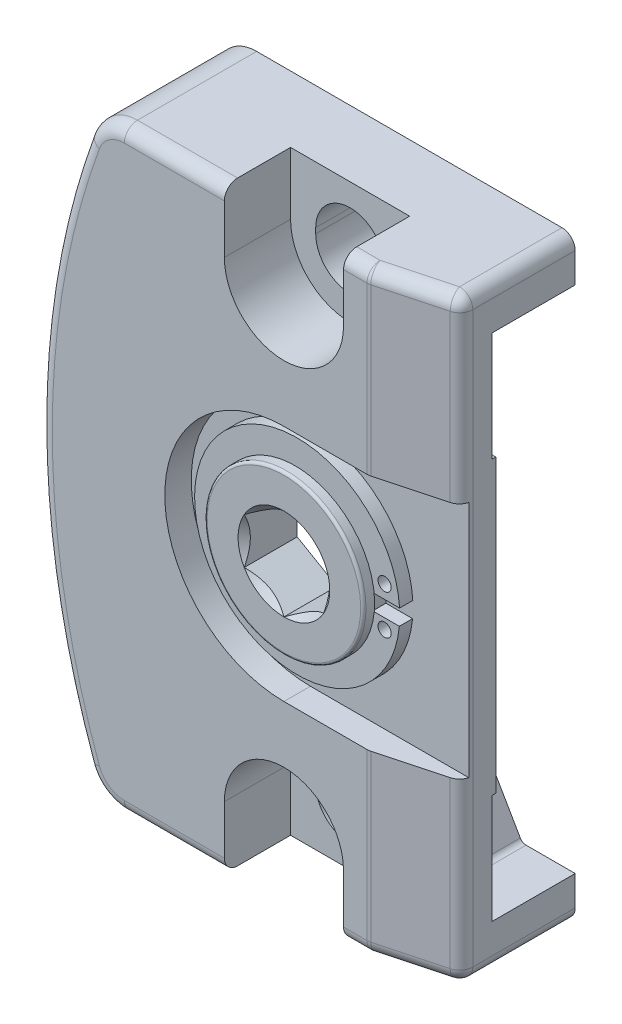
ISO-10303-21;
HEADER;
FILE_DESCRIPTION(('STEP AP214'),'2;1');
FILE_NAME('part.step','',(''),(''),'','','');
FILE_SCHEMA(('AUTOMOTIVE_DESIGN { 1 0 10303 214 1 1 1 1 }'));
ENDSEC;
DATA;
#1=APPLICATION_CONTEXT('core data for automotive mechanical design processes');
#2=APPLICATION_PROTOCOL_DEFINITION('international standard','automotive_design',2000,#1);
#3=PRODUCT_CONTEXT('',#1,'mechanical');
#4=PRODUCT('Part','Part','',(#3));
#5=PRODUCT_RELATED_PRODUCT_CATEGORY('part','',(#4));
#6=PRODUCT_DEFINITION_FORMATION('','',#4);
#7=PRODUCT_DEFINITION_CONTEXT('part definition',#1,'design');
#8=PRODUCT_DEFINITION('design','',#6,#7);
#9=PRODUCT_DEFINITION_SHAPE('','',#8);
#10=(LENGTH_UNIT() NAMED_UNIT(*) SI_UNIT(.MILLI.,.METRE.));
#11=(NAMED_UNIT(*) PLANE_ANGLE_UNIT() SI_UNIT($,.RADIAN.));
#12=(NAMED_UNIT(*) SI_UNIT($,.STERADIAN.) SOLID_ANGLE_UNIT());
#13=UNCERTAINTY_MEASURE_WITH_UNIT(LENGTH_MEASURE(1.E-05),#10,'distance_accuracy_value','');
#14=(GEOMETRIC_REPRESENTATION_CONTEXT(3) GLOBAL_UNCERTAINTY_ASSIGNED_CONTEXT((#13)) GLOBAL_UNIT_ASSIGNED_CONTEXT((#10,
#11,#12)) REPRESENTATION_CONTEXT('',''));
#15=CARTESIAN_POINT('',(0.,0.,0.));
#16=DIRECTION('',(0.,0.,1.));
#17=DIRECTION('',(1.,0.,0.));
#18=AXIS2_PLACEMENT_3D('',#15,#16,#17);
#19=CARTESIAN_POINT('',(0.,18.,8.));
#20=DIRECTION('',(0.,0.,1.));
#21=DIRECTION('',(0.,1.,0.));
#22=AXIS2_PLACEMENT_3D('',#19,#20,#21);
#23=PLANE('',#22);
#24=CARTESIAN_POINT('',(6.60490126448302,16.5,8.));
#25=DIRECTION('',(0.,0.,1.));
#26=DIRECTION('',(0.,1.,0.));
#27=AXIS2_PLACEMENT_3D('',#24,#25,#26);
#28=CIRCLE('',#27,0.5);
#29=CARTESIAN_POINT('',(6.60490126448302,17.,8.));
#30=VERTEX_POINT('',#29);
#31=EDGE_CURVE('E1163',#30,#30,#28,.T.);
#32=ORIENTED_EDGE('',*,*,#31,.T.);
#33=EDGE_LOOP('',(#32));
#34=FACE_BOUND('',#33,.T.);
#35=ADVANCED_FACE('F14',(#34),#23,.T.);
#36=CARTESIAN_POINT('',(6.60490126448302,19.5,8.));
#37=DIRECTION('',(0.,0.,1.));
#38=DIRECTION('',(0.,1.,0.));
#39=AXIS2_PLACEMENT_3D('',#36,#37,#38);
#40=CIRCLE('',#39,0.5);
#41=CARTESIAN_POINT('',(6.60490126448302,20.,8.));
#42=VERTEX_POINT('',#41);
#43=EDGE_CURVE('E1146',#42,#42,#40,.T.);
#44=ORIENTED_EDGE('',*,*,#43,.T.);
#45=EDGE_LOOP('',(#44));
#46=FACE_BOUND('',#45,.T.);
#47=ADVANCED_FACE('F576',(#46),#23,.T.);
#48=CARTESIAN_POINT('',(6.60490126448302,16.5,8.));
#49=DIRECTION('',(0.,0.,1.));
#50=DIRECTION('',(1.,0.,0.));
#51=AXIS2_PLACEMENT_3D('',#48,#49,#50);
#52=CYLINDRICAL_SURFACE('',#51,0.5);
#53=ORIENTED_EDGE('',*,*,#31,.F.);
#54=EDGE_LOOP('',(#53));
#55=FACE_BOUND('',#54,.T.);
#56=CARTESIAN_POINT('',(6.60490126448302,16.5,9.));
#57=DIRECTION('',(0.,0.,1.));
#58=DIRECTION('',(1.,0.,0.));
#59=AXIS2_PLACEMENT_3D('',#56,#57,#58);
#60=CIRCLE('',#59,0.5);
#61=CARTESIAN_POINT('',(7.10490126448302,16.5,9.));
#62=VERTEX_POINT('',#61);
#63=EDGE_CURVE('E454',#62,#62,#60,.T.);
#64=ORIENTED_EDGE('',*,*,#63,.T.);
#65=EDGE_LOOP('',(#64));
#66=FACE_BOUND('',#65,.T.);
#67=ADVANCED_FACE('F583',(#55,#66),#52,.F.);
#68=CARTESIAN_POINT('',(6.60490126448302,19.5,8.));
#69=DIRECTION('',(0.,0.,1.));
#70=DIRECTION('',(1.,0.,0.));
#71=AXIS2_PLACEMENT_3D('',#68,#69,#70);
#72=CYLINDRICAL_SURFACE('',#71,0.5);
#73=ORIENTED_EDGE('',*,*,#43,.F.);
#74=EDGE_LOOP('',(#73));
#75=FACE_BOUND('',#74,.T.);
#76=CARTESIAN_POINT('',(6.60490126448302,19.5,9.));
#77=DIRECTION('',(0.,0.,1.));
#78=DIRECTION('',(-1.,0.,0.));
#79=AXIS2_PLACEMENT_3D('',#76,#77,#78);
#80=CIRCLE('',#79,0.5);
#81=CARTESIAN_POINT('',(6.10490126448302,19.5,9.));
#82=VERTEX_POINT('',#81);
#83=EDGE_CURVE('E458',#82,#82,#80,.T.);
#84=ORIENTED_EDGE('',*,*,#83,.T.);
#85=EDGE_LOOP('',(#84));
#86=FACE_BOUND('',#85,.T.);
#87=ADVANCED_FACE('F743',(#75,#86),#72,.F.);
#88=CARTESIAN_POINT('',(7.92982534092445,15.88125,9.));
#89=DIRECTION('',(0.,0.,1.));
#90=DIRECTION('',(1.,0.,0.));
#91=AXIS2_PLACEMENT_3D('',#88,#89,#90);
#92=PLANE('',#91);
#93=ORIENTED_EDGE('',*,*,#83,.F.);
#94=EDGE_LOOP('',(#93));
#95=FACE_BOUND('',#94,.T.);
#96=ORIENTED_EDGE('',*,*,#63,.F.);
#97=EDGE_LOOP('',(#96));
#98=FACE_BOUND('',#97,.T.);
#99=DIRECTION('',(1.,0.,0.));
#100=VECTOR('',#99,1.);
#101=CARTESIAN_POINT('',(5.72982534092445,18.48125,9.));
#102=LINE('',#101,#100);
#103=CARTESIAN_POINT('',(5.72982534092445,18.48125,9.));
#104=VERTEX_POINT('',#103);
#105=CARTESIAN_POINT('',(7.73504353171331,18.48125,9.));
#106=VERTEX_POINT('',#105);
#107=EDGE_CURVE('E439',#104,#106,#102,.T.);
#108=ORIENTED_EDGE('',*,*,#107,.T.);
#109=CARTESIAN_POINT('',(0.,18.,9.));
#110=DIRECTION('',(0.,0.,1.));
#111=DIRECTION('',(1.,0.,0.));
#112=AXIS2_PLACEMENT_3D('',#109,#110,#111);
#113=CIRCLE('',#112,7.75);
#114=CARTESIAN_POINT('',(7.71659889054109,17.28125,9.));
#115=VERTEX_POINT('',#114);
#116=EDGE_CURVE('E446',#106,#115,#113,.T.);
#117=ORIENTED_EDGE('',*,*,#116,.T.);
#118=DIRECTION('',(-1.,0.,0.));
#119=VECTOR('',#118,1.);
#120=CARTESIAN_POINT('',(5.70490126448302,17.28125,9.));
#121=LINE('',#120,#119);
#122=CARTESIAN_POINT('',(5.70490126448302,17.28125,9.));
#123=VERTEX_POINT('',#122);
#124=EDGE_CURVE('E431',#115,#123,#121,.T.);
#125=ORIENTED_EDGE('',*,*,#124,.T.);
#126=CARTESIAN_POINT('',(0.,18.,9.));
#127=DIRECTION('',(0.,0.,-1.));
#128=DIRECTION('',(1.,0.,0.));
#129=AXIS2_PLACEMENT_3D('',#126,#127,#128);
#130=CIRCLE('',#129,5.75);
#131=EDGE_CURVE('E462',#123,#104,#130,.T.);
#132=ORIENTED_EDGE('',*,*,#131,.T.);
#133=EDGE_LOOP('',(#108,#117,#125,#132));
#134=FACE_BOUND('',#133,.T.);
#135=ADVANCED_FACE('F451',(#95,#98,#134),#92,.T.);
#136=CARTESIAN_POINT('',(6.2702712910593,39.5,9.));
#137=DIRECTION('',(0.,1.,0.));
#138=DIRECTION('',(-1.,0.,0.));
#139=AXIS2_PLACEMENT_3D('',#136,#137,#138);
#140=SPHERICAL_SURFACE('',#139,1.);
#141=CARTESIAN_POINT('',(6.2702712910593,39.5,9.));
#142=DIRECTION('',(1.,0.,0.));
#143=DIRECTION('',(0.,1.,0.));
#144=AXIS2_PLACEMENT_3D('',#141,#142,#143);
#145=CIRCLE('',#144,1.);
#146=CARTESIAN_POINT('',(6.2702712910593,40.5,9.));
#147=VERTEX_POINT('',#146);
#148=CARTESIAN_POINT('',(6.2702712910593,39.5,10.));
#149=VERTEX_POINT('',#148);
#150=EDGE_CURVE('E1065',#147,#149,#145,.T.);
#151=ORIENTED_EDGE('',*,*,#150,.T.);
#152=CARTESIAN_POINT('',(6.2702712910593,39.5,9.));
#153=DIRECTION('',(0.,-1.,0.));
#154=DIRECTION('',(1.,0.,0.));
#155=AXIS2_PLACEMENT_3D('',#152,#153,#154);
#156=CIRCLE('',#155,1.);
#157=CARTESIAN_POINT('',(6.52909033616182,39.5,9.96592582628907));
#158=VERTEX_POINT('',#157);
#159=EDGE_CURVE('E1026',#158,#149,#156,.T.);
#160=ORIENTED_EDGE('',*,*,#159,.F.);
#161=CARTESIAN_POINT('',(6.2702712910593,39.5,9.));
#162=DIRECTION('',(0.965925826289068,0.,-0.258819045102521));
#163=DIRECTION('',(-0.258819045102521,0.,-0.965925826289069));
#164=AXIS2_PLACEMENT_3D('',#161,#162,#163);
#165=CIRCLE('',#164,1.);
#166=EDGE_CURVE('E1062',#147,#158,#165,.T.);
#167=ORIENTED_EDGE('',*,*,#166,.F.);
#168=EDGE_LOOP('',(#151,#160,#167));
#169=FACE_BOUND('',#168,.T.);
#170=ADVANCED_FACE('F667',(#169),#140,.T.);
#171=CARTESIAN_POINT('',(6.2702712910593,-3.5,9.));
#172=DIRECTION('',(0.,1.,0.));
#173=DIRECTION('',(-1.,0.,0.));
#174=AXIS2_PLACEMENT_3D('',#171,#172,#173);
#175=SPHERICAL_SURFACE('',#174,1.);
#176=CARTESIAN_POINT('',(6.2702712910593,-3.5,9.));
#177=DIRECTION('',(-0.965925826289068,0.,0.258819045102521));
#178=DIRECTION('',(0.258819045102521,0.,0.965925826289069));
#179=AXIS2_PLACEMENT_3D('',#176,#177,#178);
#180=CIRCLE('',#179,1.);
#181=CARTESIAN_POINT('',(6.2702712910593,-4.5,9.));
#182=VERTEX_POINT('',#181);
#183=CARTESIAN_POINT('',(6.52909033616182,-3.5,9.96592582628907));
#184=VERTEX_POINT('',#183);
#185=EDGE_CURVE('E1046',#182,#184,#180,.T.);
#186=ORIENTED_EDGE('',*,*,#185,.T.);
#187=CARTESIAN_POINT('',(6.2702712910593,-3.5,9.));
#188=DIRECTION('',(0.,-1.,0.));
#189=DIRECTION('',(1.,0.,0.));
#190=AXIS2_PLACEMENT_3D('',#187,#188,#189);
#191=CIRCLE('',#190,1.);
#192=CARTESIAN_POINT('',(6.2702712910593,-3.5,10.));
#193=VERTEX_POINT('',#192);
#194=EDGE_CURVE('E1012',#193,#184,#191,.F.);
#195=ORIENTED_EDGE('',*,*,#194,.F.);
#196=CARTESIAN_POINT('',(6.2702712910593,-3.5,9.));
#197=DIRECTION('',(-1.,0.,0.));
#198=DIRECTION('',(0.,-1.,0.));
#199=AXIS2_PLACEMENT_3D('',#196,#197,#198);
#200=CIRCLE('',#199,1.);
#201=EDGE_CURVE('E1044',#182,#193,#200,.T.);
#202=ORIENTED_EDGE('',*,*,#201,.F.);
#203=EDGE_LOOP('',(#186,#195,#202));
#204=FACE_BOUND('',#203,.T.);
#205=ADVANCED_FACE('F663',(#204),#175,.T.);
#206=CARTESIAN_POINT('',(6.,18.,9.15));
#207=DIRECTION('',(0.,0.,-1.));
#208=DIRECTION('',(0.,-1.,0.));
#209=AXIS2_PLACEMENT_3D('',#206,#207,#208);
#210=PLANE('',#209);
#211=CARTESIAN_POINT('',(0.,18.,9.15));
#212=DIRECTION('',(0.,0.,-1.));
#213=DIRECTION('',(0.,-1.,0.));
#214=AXIS2_PLACEMENT_3D('',#211,#212,#213);
#215=CIRCLE('',#214,6.);
#216=CARTESIAN_POINT('',(0.,12.,9.15));
#217=VERTEX_POINT('',#216);
#218=EDGE_CURVE('E486',#217,#217,#215,.T.);
#219=ORIENTED_EDGE('',*,*,#218,.T.);
#220=EDGE_LOOP('',(#219));
#221=FACE_BOUND('',#220,.T.);
#222=CARTESIAN_POINT('',(0.,18.,9.15));
#223=DIRECTION('',(0.,0.,-1.));
#224=DIRECTION('',(0.,-1.,0.));
#225=AXIS2_PLACEMENT_3D('',#222,#223,#224);
#226=CIRCLE('',#225,5.75);
#227=CARTESIAN_POINT('',(0.,12.25,9.15));
#228=VERTEX_POINT('',#227);
#229=EDGE_CURVE('E480',#228,#228,#226,.T.);
#230=ORIENTED_EDGE('',*,*,#229,.F.);
#231=EDGE_LOOP('',(#230));
#232=FACE_BOUND('',#231,.T.);
#233=ADVANCED_FACE('F666',(#221,#232),#210,.T.);
#234=CARTESIAN_POINT('',(0.,18.,5.));
#235=DIRECTION('',(0.,0.,1.));
#236=DIRECTION('',(0.,1.,0.));
#237=AXIS2_PLACEMENT_3D('',#234,#235,#236);
#238=CYLINDRICAL_SURFACE('',#237,6.);
#239=CARTESIAN_POINT('',(0.,18.,9.8));
#240=DIRECTION('',(0.,0.,-1.));
#241=DIRECTION('',(0.,-1.,0.));
#242=AXIS2_PLACEMENT_3D('',#239,#240,#241);
#243=CIRCLE('',#242,6.);
#244=CARTESIAN_POINT('',(0.,12.,9.8));
#245=VERTEX_POINT('',#244);
#246=EDGE_CURVE('E483',#245,#245,#243,.T.);
#247=ORIENTED_EDGE('',*,*,#246,.T.);
#248=EDGE_LOOP('',(#247));
#249=FACE_BOUND('',#248,.T.);
#250=ORIENTED_EDGE('',*,*,#218,.F.);
#251=EDGE_LOOP('',(#250));
#252=FACE_BOUND('',#251,.T.);
#253=ADVANCED_FACE('F775',(#249,#252),#238,.T.);
#254=CARTESIAN_POINT('',(0.,18.,9.8));
#255=DIRECTION('',(0.,0.,-1.));
#256=DIRECTION('',(0.,-1.,0.));
#257=AXIS2_PLACEMENT_3D('',#254,#255,#256);
#258=TOROIDAL_SURFACE('',#257,5.8,0.2);
#259=CARTESIAN_POINT('',(0.,18.,10.));
#260=DIRECTION('',(0.,0.,-1.));
#261=DIRECTION('',(0.,-1.,0.));
#262=AXIS2_PLACEMENT_3D('',#259,#260,#261);
#263=CIRCLE('',#262,5.8);
#264=CARTESIAN_POINT('',(0.,12.2,10.));
#265=VERTEX_POINT('',#264);
#266=EDGE_CURVE('E1527',#265,#265,#263,.F.);
#267=ORIENTED_EDGE('',*,*,#266,.F.);
#268=EDGE_LOOP('',(#267));
#269=FACE_BOUND('',#268,.T.);
#270=ORIENTED_EDGE('',*,*,#246,.F.);
#271=EDGE_LOOP('',(#270));
#272=FACE_BOUND('',#271,.T.);
#273=ADVANCED_FACE('F773',(#269,#272),#258,.T.);
#274=CARTESIAN_POINT('',(0.,18.,10.));
#275=DIRECTION('',(0.,0.,-1.));
#276=DIRECTION('',(0.,-1.,0.));
#277=AXIS2_PLACEMENT_3D('',#274,#275,#276);
#278=PLANE('',#277);
#279=ORIENTED_EDGE('',*,*,#266,.T.);
#280=EDGE_LOOP('',(#279));
#281=FACE_BOUND('',#280,.T.);
#282=CARTESIAN_POINT('',(0.,18.,10.));
#283=DIRECTION('',(0.,0.,-1.));
#284=DIRECTION('',(0.,-1.,0.));
#285=AXIS2_PLACEMENT_3D('',#282,#283,#284);
#286=CIRCLE('',#285,3.46410161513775);
#287=CARTESIAN_POINT('',(3.,16.2679491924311,10.));
#288=VERTEX_POINT('',#287);
#289=CARTESIAN_POINT('',(0.,14.5358983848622,10.));
#290=VERTEX_POINT('',#289);
#291=EDGE_CURVE('E1165',#288,#290,#286,.T.);
#292=ORIENTED_EDGE('',*,*,#291,.T.);
#293=CARTESIAN_POINT('',(-3.,16.2679491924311,10.));
#294=VERTEX_POINT('',#293);
#295=EDGE_CURVE('E1179',#290,#294,#286,.T.);
#296=ORIENTED_EDGE('',*,*,#295,.T.);
#297=CARTESIAN_POINT('',(-3.,19.7320508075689,10.));
#298=VERTEX_POINT('',#297);
#299=EDGE_CURVE('E1181',#294,#298,#286,.T.);
#300=ORIENTED_EDGE('',*,*,#299,.T.);
#301=CARTESIAN_POINT('',(0.,21.4641016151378,10.));
#302=VERTEX_POINT('',#301);
#303=EDGE_CURVE('E1188',#298,#302,#286,.T.);
#304=ORIENTED_EDGE('',*,*,#303,.T.);
#305=CARTESIAN_POINT('',(3.,19.7320508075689,10.));
#306=VERTEX_POINT('',#305);
#307=EDGE_CURVE('E1193',#302,#306,#286,.T.);
#308=ORIENTED_EDGE('',*,*,#307,.T.);
#309=EDGE_CURVE('E1189',#306,#288,#286,.T.);
#310=ORIENTED_EDGE('',*,*,#309,.T.);
#311=EDGE_LOOP('',(#292,#296,#300,#304,#308,#310));
#312=FACE_BOUND('',#311,.T.);
#313=ADVANCED_FACE('F769',(#281,#312),#278,.F.);
#314=CARTESIAN_POINT('',(0.,18.,9.53589838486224));
#315=DIRECTION('',(0.,0.,1.));
#316=DIRECTION('',(0.,1.,0.));
#317=AXIS2_PLACEMENT_3D('',#314,#315,#316);
#318=CONICAL_SURFACE('',#317,3.,0.785398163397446);
#319=ORIENTED_EDGE('',*,*,#307,.F.);
#320=CARTESIAN_POINT('',(3.0002,19.7319353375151,10.0001154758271));
#321=CARTESIAN_POINT('',(2.89707648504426,19.7914737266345,9.94062831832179));
#322=CARTESIAN_POINT('',(2.79222861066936,19.8520076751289,9.88463497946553));
#323=CARTESIAN_POINT('',(2.57843232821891,19.9754430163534,9.78211259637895));
#324=CARTESIAN_POINT('',(2.46946358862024,20.0383561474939,9.7356405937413));
#325=CARTESIAN_POINT('',(2.24973336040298,20.1652174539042,9.65603318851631));
#326=CARTESIAN_POINT('',(2.1390278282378,20.2291333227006,9.62269770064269));
#327=CARTESIAN_POINT('',(1.91517958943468,20.3583721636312,9.57133754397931));
#328=CARTESIAN_POINT('',(1.80204372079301,20.4236911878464,9.55327453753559));
#329=CARTESIAN_POINT('',(1.6070590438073,20.536265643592,9.53697690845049));
#330=CARTESIAN_POINT('',(1.52546204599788,20.5833756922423,9.53456436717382));
#331=CARTESIAN_POINT('',(1.36240077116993,20.6775191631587,9.53862943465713));
#332=CARTESIAN_POINT('',(1.28093655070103,20.7245525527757,9.54511016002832));
#333=CARTESIAN_POINT('',(1.11877988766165,20.8181737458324,9.56659172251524));
#334=CARTESIAN_POINT('',(1.03808841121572,20.8647609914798,9.5816020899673));
#335=CARTESIAN_POINT('',(0.878091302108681,20.9571353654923,9.61932364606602));
#336=CARTESIAN_POINT('',(0.798785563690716,21.0029225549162,9.64203424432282));
#337=CARTESIAN_POINT('',(0.657993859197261,21.0842086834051,9.68876068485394));
#338=CARTESIAN_POINT('',(0.596196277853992,21.1198875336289,9.7115483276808));
#339=CARTESIAN_POINT('',(0.473710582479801,21.1906046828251,9.76079628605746));
#340=CARTESIAN_POINT('',(0.413022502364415,21.2256429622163,9.78725671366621));
#341=CARTESIAN_POINT('',(0.292947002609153,21.2949685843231,9.84325699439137));
#342=CARTESIAN_POINT('',(0.233556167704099,21.3292578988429,9.87278716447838));
#343=CARTESIAN_POINT('',(0.115874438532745,21.3972014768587,9.93453909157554));
#344=CARTESIAN_POINT('',(0.0575828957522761,21.4308561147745,9.96675919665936));
#345=CARTESIAN_POINT('',(-0.000199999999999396,21.4642170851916,10.0001154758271));
#346=B_SPLINE_CURVE_WITH_KNOTS('',3,(#320,#321,#322,#323,#324,#325,#326,#327,#328,#329,#330,
#331,#332,#333,#334,#335,#336,#337,#338,#339,#340,#341,#342,#343,#344,#345),.UNSPECIFIED.,.F.,
.F.,(4,2,2,2,2,2,2,2,2,2,2,2,4),(0.,0.399603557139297,0.801535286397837,1.19708369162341,
1.59163620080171,1.87398941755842,2.1564416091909,2.43921001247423,2.72195674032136,
2.94657516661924,3.17120044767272,3.39513752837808,3.61893808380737),.UNSPECIFIED.);
#347=EDGE_CURVE('E526',#306,#302,#346,.T.);
#348=ORIENTED_EDGE('',*,*,#347,.F.);
#349=EDGE_LOOP('',(#319,#348));
#350=FACE_BOUND('',#349,.T.);
#351=ADVANCED_FACE('F772',(#350),#318,.F.);
#352=ORIENTED_EDGE('',*,*,#303,.F.);
#353=CARTESIAN_POINT('',(0.000200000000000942,21.4642170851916,10.0001154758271));
#354=CARTESIAN_POINT('',(-0.102923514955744,21.4046786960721,9.94062831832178));
#355=CARTESIAN_POINT('',(-0.207771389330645,21.3441447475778,9.88463497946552));
#356=CARTESIAN_POINT('',(-0.421567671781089,21.2207094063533,9.78211259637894));
#357=CARTESIAN_POINT('',(-0.530536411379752,21.1577962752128,9.73564059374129));
#358=CARTESIAN_POINT('',(-0.750266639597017,21.0309349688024,9.6560331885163));
#359=CARTESIAN_POINT('',(-0.860972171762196,20.9670191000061,9.62269770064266));
#360=CARTESIAN_POINT('',(-1.08482041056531,20.8377802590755,9.5713375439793));
#361=CARTESIAN_POINT('',(-1.19795627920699,20.7724612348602,9.5532745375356));
#362=CARTESIAN_POINT('',(-1.3929409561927,20.6598867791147,9.53697690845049));
#363=CARTESIAN_POINT('',(-1.47453795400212,20.6127767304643,9.5345643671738));
#364=CARTESIAN_POINT('',(-1.63759922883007,20.518633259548,9.53862943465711));
#365=CARTESIAN_POINT('',(-1.71906344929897,20.4715998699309,9.5451101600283));
#366=CARTESIAN_POINT('',(-1.88122011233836,20.3779786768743,9.56659172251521));
#367=CARTESIAN_POINT('',(-1.96191158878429,20.3313914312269,9.58160208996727));
#368=CARTESIAN_POINT('',(-2.12190869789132,20.2390170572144,9.61932364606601));
#369=CARTESIAN_POINT('',(-2.20121443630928,20.1932298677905,9.64203424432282));
#370=CARTESIAN_POINT('',(-2.34200614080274,20.1119437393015,9.68876068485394));
#371=CARTESIAN_POINT('',(-2.40380372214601,20.0762648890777,9.71154832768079));
#372=CARTESIAN_POINT('',(-2.52628941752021,20.0055477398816,9.76079628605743));
#373=CARTESIAN_POINT('',(-2.58697749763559,19.9705094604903,9.78725671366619));
#374=CARTESIAN_POINT('',(-2.70705299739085,19.9011838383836,9.84325699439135));
#375=CARTESIAN_POINT('',(-2.76644383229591,19.8668945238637,9.87278716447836));
#376=CARTESIAN_POINT('',(-2.88412556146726,19.798950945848,9.93453909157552));
#377=CARTESIAN_POINT('',(-2.94241710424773,19.7652963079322,9.96675919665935));
#378=CARTESIAN_POINT('',(-3.0002,19.7319353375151,10.0001154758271));
#379=B_SPLINE_CURVE_WITH_KNOTS('',3,(#353,#354,#355,#356,#357,#358,#359,#360,#361,#362,#363,
#364,#365,#366,#367,#368,#369,#370,#371,#372,#373,#374,#375,#376,#377,#378),.UNSPECIFIED.,.F.,
.F.,(4,2,2,2,2,2,2,2,2,2,2,2,4),(0.,0.399603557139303,0.801535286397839,1.19708369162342,
1.59163620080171,1.87398941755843,2.15644160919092,2.43921001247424,2.72195674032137,
2.94657516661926,3.17120044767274,3.3951375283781,3.61893808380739),.UNSPECIFIED.);
#380=EDGE_CURVE('E479',#302,#298,#379,.T.);
#381=ORIENTED_EDGE('',*,*,#380,.F.);
#382=EDGE_LOOP('',(#352,#381));
#383=FACE_BOUND('',#382,.T.);
#384=ADVANCED_FACE('F508',(#383),#318,.F.);
#385=CARTESIAN_POINT('',(-3.,14.3853526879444,11.2333099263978));
#386=CARTESIAN_POINT('',(-3.,14.4726808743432,11.1661261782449));
#387=CARTESIAN_POINT('',(-3.,14.5604796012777,11.0995444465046));
#388=CARTESIAN_POINT('',(-3.,14.7372104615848,10.9678600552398));
#389=CARTESIAN_POINT('',(-3.,14.8261428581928,10.9027577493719));
#390=CARTESIAN_POINT('',(-3.,15.0059832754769,10.7738439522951));
#391=CARTESIAN_POINT('',(-3.,15.0969012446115,10.7100462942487));
#392=CARTESIAN_POINT('',(-3.,15.2802503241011,10.5846711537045));
#393=CARTESIAN_POINT('',(-3.,15.3726813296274,10.5230935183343));
#394=CARTESIAN_POINT('',(-3.,15.5652280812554,10.3988459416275));
#395=CARTESIAN_POINT('',(-3.,15.6654594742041,10.3363543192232));
#396=CARTESIAN_POINT('',(-3.,15.8682760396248,10.2152498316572));
#397=CARTESIAN_POINT('',(-3.,15.9708616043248,10.156637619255));
#398=CARTESIAN_POINT('',(-3.,16.1784145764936,10.0445401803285));
#399=CARTESIAN_POINT('',(-3.,16.2833737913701,9.99103990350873));
#400=CARTESIAN_POINT('',(-3.,16.4962593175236,9.89036499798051));
#401=CARTESIAN_POINT('',(-3.,16.6041841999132,9.84318738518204));
#402=CARTESIAN_POINT('',(-3.,16.8124282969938,9.76112733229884));
#403=CARTESIAN_POINT('',(-3.,16.9124474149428,9.72549107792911));
#404=CARTESIAN_POINT('',(-3.,17.1150338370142,9.66222448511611));
#405=CARTESIAN_POINT('',(-3.,17.2176013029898,9.63459465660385));
#406=CARTESIAN_POINT('',(-3.,17.4228854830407,9.58929703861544));
#407=CARTESIAN_POINT('',(-3.,17.5255615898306,9.57144831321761));
#408=CARTESIAN_POINT('',(-3.,17.7321894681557,9.54608525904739));
#409=CARTESIAN_POINT('',(-3.,17.8361409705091,9.53856878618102));
#410=CARTESIAN_POINT('',(-3.,18.0397130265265,9.53451050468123));
#411=CARTESIAN_POINT('',(-3.,18.1393243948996,9.53750360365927));
#412=CARTESIAN_POINT('',(-3.,18.337769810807,9.55323151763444));
#413=CARTESIAN_POINT('',(-3.,18.4366037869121,9.56596721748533));
#414=CARTESIAN_POINT('',(-3.,18.6344541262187,9.60067669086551));
#415=CARTESIAN_POINT('',(-3.,18.7334413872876,9.6228135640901));
#416=CARTESIAN_POINT('',(-3.,18.9292360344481,9.67509725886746));
#417=CARTESIAN_POINT('',(-3.,19.0260435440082,9.7052436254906));
#418=CARTESIAN_POINT('',(-3.,19.2228185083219,9.77415433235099));
#419=CARTESIAN_POINT('',(-3.,19.3226452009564,9.81331606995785));
#420=CARTESIAN_POINT('',(-3.,19.5197178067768,9.89768452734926));
#421=CARTESIAN_POINT('',(-3.,19.616962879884,9.94289318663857));
#422=CARTESIAN_POINT('',(-3.,19.8093523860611,10.0382911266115));
#423=CARTESIAN_POINT('',(-3.,19.9044889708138,10.0884961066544));
#424=CARTESIAN_POINT('',(-3.,20.0925800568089,10.192777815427));
#425=CARTESIAN_POINT('',(-3.,20.1855349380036,10.2468538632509));
#426=CARTESIAN_POINT('',(-3.,20.365007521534,10.3553760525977));
#427=CARTESIAN_POINT('',(-3.,20.4516164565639,10.409672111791));
#428=CARTESIAN_POINT('',(-3.,20.6233463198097,10.5205753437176));
#429=CARTESIAN_POINT('',(-3.,20.7084671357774,10.577182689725));
#430=CARTESIAN_POINT('',(-3.,20.8767310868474,10.6918355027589));
#431=CARTESIAN_POINT('',(-3.,20.9598846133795,10.7498657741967));
#432=CARTESIAN_POINT('',(-3.,21.1250509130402,10.8674819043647));
#433=CARTESIAN_POINT('',(-3.,21.2070639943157,10.9270673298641));
#434=CARTESIAN_POINT('',(-3.,21.288598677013,10.9872893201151));
#435=B_SPLINE_CURVE_WITH_KNOTS('',3,(#385,#386,#387,#388,#389,#390,#391,#392,#393,#394,#395,
#396,#397,#398,#399,#400,#401,#402,#403,#404,#405,#406,#407,#408,#409,#410,#411,#412,#413,#414,
#415,#416,#417,#418,#419,#420,#421,#422,#423,#424,#425,#426,#427,#428,#429,#430,#431,#432,#433,
#434),.UNSPECIFIED.,.F.,.F.,(4,2,2,2,2,2,2,2,2,2,2,2,2,2,2,2,2,2,2,2,2,2,2,2,4),(0.,
0.330549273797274,0.661176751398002,0.994354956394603,1.32751017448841,1.68179021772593,
2.03612972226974,2.38939159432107,2.7424861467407,3.06074559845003,3.37902531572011,
3.69119941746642,4.00330872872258,4.30178328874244,4.60028496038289,4.90419165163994,
5.20808108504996,5.52953489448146,5.85109205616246,6.17369358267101,6.49623850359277,
6.80285904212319,7.10950260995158,7.4136841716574,7.71778188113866),.UNSPECIFIED.);
#436=EDGE_CURVE('E518',#298,#294,#435,.F.);
#437=ORIENTED_EDGE('',*,*,#436,.F.);
#438=ORIENTED_EDGE('',*,*,#299,.F.);
#439=EDGE_LOOP('',(#437,#438));
#440=FACE_BOUND('',#439,.T.);
#441=ADVANCED_FACE('F1234',(#440),#318,.F.);
#442=CARTESIAN_POINT('',(-3.0002,16.2680646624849,10.0001154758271));
#443=CARTESIAN_POINT('',(-2.89707648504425,16.2085262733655,9.94062831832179));
#444=CARTESIAN_POINT('',(-2.79222861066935,16.1479923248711,9.88463497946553));
#445=CARTESIAN_POINT('',(-2.57843232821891,16.0245569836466,9.78211259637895));
#446=CARTESIAN_POINT('',(-2.46946358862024,15.9616438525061,9.7356405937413));
#447=CARTESIAN_POINT('',(-2.24973336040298,15.8347825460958,9.65603318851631));
#448=CARTESIAN_POINT('',(-2.1390278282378,15.7708666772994,9.62269770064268));
#449=CARTESIAN_POINT('',(-1.91517958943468,15.6416278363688,9.57133754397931));
#450=CARTESIAN_POINT('',(-1.80204372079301,15.5763088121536,9.55327453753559));
#451=CARTESIAN_POINT('',(-1.60705904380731,15.463734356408,9.53697690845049));
#452=CARTESIAN_POINT('',(-1.52546204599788,15.4166243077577,9.53456436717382));
#453=CARTESIAN_POINT('',(-1.36240077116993,15.3224808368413,9.53862943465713));
#454=CARTESIAN_POINT('',(-1.28093655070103,15.2754474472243,9.54511016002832));
#455=CARTESIAN_POINT('',(-1.11877988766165,15.1818262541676,9.56659172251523));
#456=CARTESIAN_POINT('',(-1.03808841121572,15.1352390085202,9.58160208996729));
#457=CARTESIAN_POINT('',(-0.878091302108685,15.0428646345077,9.61932364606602));
#458=CARTESIAN_POINT('',(-0.798785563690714,14.9970774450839,9.64203424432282));
#459=CARTESIAN_POINT('',(-0.65799385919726,14.9157913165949,9.68876068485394));
#460=CARTESIAN_POINT('',(-0.596196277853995,14.8801124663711,9.7115483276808));
#461=CARTESIAN_POINT('',(-0.473710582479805,14.8093953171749,9.76079628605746));
#462=CARTESIAN_POINT('',(-0.413022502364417,14.7743570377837,9.7872567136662));
#463=CARTESIAN_POINT('',(-0.292947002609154,14.7050314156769,9.84325699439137));
#464=CARTESIAN_POINT('',(-0.233556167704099,14.6707421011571,9.87278716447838));
#465=CARTESIAN_POINT('',(-0.115874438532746,14.6027985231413,9.93453909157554));
#466=CARTESIAN_POINT('',(-0.0575828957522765,14.5691438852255,9.96675919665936));
#467=CARTESIAN_POINT('',(0.000200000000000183,14.5357829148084,10.0001154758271));
#468=B_SPLINE_CURVE_WITH_KNOTS('',3,(#442,#443,#444,#445,#446,#447,#448,#449,#450,#451,#452,
#453,#454,#455,#456,#457,#458,#459,#460,#461,#462,#463,#464,#465,#466,#467),.UNSPECIFIED.,.F.,
.F.,(4,2,2,2,2,2,2,2,2,2,2,2,4),(0.,0.399603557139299,0.801535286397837,1.19708369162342,
1.59163620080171,1.87398941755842,2.1564416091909,2.43921001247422,2.72195674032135,
2.94657516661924,3.17120044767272,3.39513752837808,3.61893808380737),.UNSPECIFIED.);
#469=EDGE_CURVE('E532',#294,#290,#468,.T.);
#470=ORIENTED_EDGE('',*,*,#469,.F.);
#471=ORIENTED_EDGE('',*,*,#295,.F.);
#472=EDGE_LOOP('',(#470,#471));
#473=FACE_BOUND('',#472,.T.);
#474=ADVANCED_FACE('F506',(#473),#318,.F.);
#475=ORIENTED_EDGE('',*,*,#291,.F.);
#476=CARTESIAN_POINT('',(-0.00019999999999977,14.5357829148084,10.0001154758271));
#477=CARTESIAN_POINT('',(0.10292351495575,14.5953213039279,9.94062831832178));
#478=CARTESIAN_POINT('',(0.207771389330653,14.6558552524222,9.88463497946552));
#479=CARTESIAN_POINT('',(0.421567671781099,14.7792905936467,9.78211259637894));
#480=CARTESIAN_POINT('',(0.530536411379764,14.8422037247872,9.73564059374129));
#481=CARTESIAN_POINT('',(0.750266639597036,14.9690650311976,9.65603318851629));
#482=CARTESIAN_POINT('',(0.860972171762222,15.0329808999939,9.62269770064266));
#483=CARTESIAN_POINT('',(1.08482041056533,15.1622197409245,9.5713375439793));
#484=CARTESIAN_POINT('',(1.19795627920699,15.2275387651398,9.5532745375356));
#485=CARTESIAN_POINT('',(1.3929409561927,15.3401132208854,9.53697690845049));
#486=CARTESIAN_POINT('',(1.47453795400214,15.3872232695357,9.5345643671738));
#487=CARTESIAN_POINT('',(1.6375992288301,15.481366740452,9.53862943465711));
#488=CARTESIAN_POINT('',(1.71906344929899,15.5284001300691,9.5451101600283));
#489=CARTESIAN_POINT('',(1.88122011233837,15.6220213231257,9.56659172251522));
#490=CARTESIAN_POINT('',(1.9619115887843,15.6686085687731,9.58160208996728));
#491=CARTESIAN_POINT('',(2.12190869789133,15.7609829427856,9.61932364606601));
#492=CARTESIAN_POINT('',(2.20121443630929,15.8067701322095,9.64203424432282));
#493=CARTESIAN_POINT('',(2.34200614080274,15.8880562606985,9.68876068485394));
#494=CARTESIAN_POINT('',(2.40380372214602,15.9237351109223,9.71154832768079));
#495=CARTESIAN_POINT('',(2.52628941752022,15.9944522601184,9.76079628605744));
#496=CARTESIAN_POINT('',(2.5869774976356,16.0294905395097,9.78725671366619));
#497=CARTESIAN_POINT('',(2.70705299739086,16.0988161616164,9.84325699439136));
#498=CARTESIAN_POINT('',(2.76644383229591,16.1331054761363,9.87278716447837));
#499=CARTESIAN_POINT('',(2.88412556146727,16.2010490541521,9.93453909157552));
#500=CARTESIAN_POINT('',(2.94241710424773,16.2347036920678,9.96675919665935));
#501=CARTESIAN_POINT('',(3.0002,16.2680646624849,10.0001154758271));
#502=B_SPLINE_CURVE_WITH_KNOTS('',3,(#476,#477,#478,#479,#480,#481,#482,#483,#484,#485,#486,
#487,#488,#489,#490,#491,#492,#493,#494,#495,#496,#497,#498,#499,#500,#501),.UNSPECIFIED.,.F.,
.F.,(4,2,2,2,2,2,2,2,2,2,2,2,4),(0.,0.399603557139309,0.80153528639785,1.19708369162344,
1.59163620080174,1.87398941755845,2.15644160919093,2.43921001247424,2.72195674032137,
2.94657516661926,3.17120044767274,3.3951375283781,3.61893808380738),.UNSPECIFIED.);
#503=EDGE_CURVE('E545',#290,#288,#502,.T.);
#504=ORIENTED_EDGE('',*,*,#503,.F.);
#505=EDGE_LOOP('',(#475,#504));
#506=FACE_BOUND('',#505,.T.);
#507=ADVANCED_FACE('F501',(#506),#318,.F.);
#508=ORIENTED_EDGE('',*,*,#309,.F.);
#509=CARTESIAN_POINT('',(3.,14.3853526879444,11.2333099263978));
#510=CARTESIAN_POINT('',(3.,14.4726808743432,11.1661261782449));
#511=CARTESIAN_POINT('',(3.,14.5604796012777,11.0995444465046));
#512=CARTESIAN_POINT('',(3.,14.7372104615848,10.9678600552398));
#513=CARTESIAN_POINT('',(3.,14.8261428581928,10.9027577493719));
#514=CARTESIAN_POINT('',(3.,15.0059832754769,10.7738439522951));
#515=CARTESIAN_POINT('',(3.,15.0969012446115,10.7100462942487));
#516=CARTESIAN_POINT('',(3.,15.2802503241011,10.5846711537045));
#517=CARTESIAN_POINT('',(3.,15.3726813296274,10.5230935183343));
#518=CARTESIAN_POINT('',(3.,15.5652280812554,10.3988459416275));
#519=CARTESIAN_POINT('',(3.,15.6654594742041,10.3363543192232));
#520=CARTESIAN_POINT('',(3.,15.8682760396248,10.2152498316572));
#521=CARTESIAN_POINT('',(3.,15.9708616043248,10.156637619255));
#522=CARTESIAN_POINT('',(3.,16.1784145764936,10.0445401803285));
#523=CARTESIAN_POINT('',(3.,16.2833737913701,9.99103990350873));
#524=CARTESIAN_POINT('',(3.,16.4962593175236,9.89036499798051));
#525=CARTESIAN_POINT('',(3.,16.6041841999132,9.84318738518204));
#526=CARTESIAN_POINT('',(3.,16.8124282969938,9.76112733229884));
#527=CARTESIAN_POINT('',(3.,16.9124474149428,9.72549107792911));
#528=CARTESIAN_POINT('',(3.,17.1150338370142,9.66222448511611));
#529=CARTESIAN_POINT('',(3.,17.2176013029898,9.63459465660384));
#530=CARTESIAN_POINT('',(3.,17.4228854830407,9.58929703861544));
#531=CARTESIAN_POINT('',(3.,17.5255615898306,9.57144831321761));
#532=CARTESIAN_POINT('',(3.,17.7321894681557,9.54608525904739));
#533=CARTESIAN_POINT('',(3.,17.8361409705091,9.53856878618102));
#534=CARTESIAN_POINT('',(3.,18.0397130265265,9.53451050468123));
#535=CARTESIAN_POINT('',(3.,18.1393243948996,9.53750360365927));
#536=CARTESIAN_POINT('',(3.,18.337769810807,9.55323151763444));
#537=CARTESIAN_POINT('',(3.,18.4366037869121,9.56596721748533));
#538=CARTESIAN_POINT('',(3.,18.6344541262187,9.60067669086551));
#539=CARTESIAN_POINT('',(3.,18.7334413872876,9.6228135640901));
#540=CARTESIAN_POINT('',(3.,18.9292360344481,9.67509725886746));
#541=CARTESIAN_POINT('',(3.,19.0260435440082,9.7052436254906));
#542=CARTESIAN_POINT('',(3.,19.2228185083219,9.77415433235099));
#543=CARTESIAN_POINT('',(3.,19.3226452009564,9.81331606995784));
#544=CARTESIAN_POINT('',(3.,19.5197178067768,9.89768452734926));
#545=CARTESIAN_POINT('',(3.,19.616962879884,9.94289318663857));
#546=CARTESIAN_POINT('',(3.,19.8093523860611,10.0382911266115));
#547=CARTESIAN_POINT('',(3.,19.9044889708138,10.0884961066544));
#548=CARTESIAN_POINT('',(3.,20.0925800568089,10.192777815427));
#549=CARTESIAN_POINT('',(3.,20.1855349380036,10.2468538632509));
#550=CARTESIAN_POINT('',(3.,20.365007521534,10.3553760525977));
#551=CARTESIAN_POINT('',(3.,20.4516164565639,10.409672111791));
#552=CARTESIAN_POINT('',(3.,20.6233463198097,10.5205753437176));
#553=CARTESIAN_POINT('',(3.,20.7084671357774,10.577182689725));
#554=CARTESIAN_POINT('',(3.,20.8767310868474,10.6918355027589));
#555=CARTESIAN_POINT('',(3.,20.9598846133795,10.7498657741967));
#556=CARTESIAN_POINT('',(3.,21.1250509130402,10.8674819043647));
#557=CARTESIAN_POINT('',(3.,21.2070639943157,10.9270673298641));
#558=CARTESIAN_POINT('',(3.,21.288598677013,10.9872893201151));
#559=B_SPLINE_CURVE_WITH_KNOTS('',3,(#509,#510,#511,#512,#513,#514,#515,#516,#517,#518,#519,
#520,#521,#522,#523,#524,#525,#526,#527,#528,#529,#530,#531,#532,#533,#534,#535,#536,#537,#538,
#539,#540,#541,#542,#543,#544,#545,#546,#547,#548,#549,#550,#551,#552,#553,#554,#555,#556,#557,
#558),.UNSPECIFIED.,.F.,.F.,(4,2,2,2,2,2,2,2,2,2,2,2,2,2,2,2,2,2,2,2,2,2,2,2,4),(0.,
0.330549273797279,0.661176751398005,0.994354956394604,1.32751017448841,1.68179021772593,
2.03612972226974,2.38939159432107,2.7424861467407,3.06074559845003,3.37902531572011,
3.69119941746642,4.00330872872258,4.30178328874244,4.60028496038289,4.90419165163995,
5.20808108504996,5.52953489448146,5.85109205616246,6.17369358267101,6.49623850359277,
6.80285904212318,7.10950260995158,7.4136841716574,7.71778188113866),.UNSPECIFIED.);
#560=EDGE_CURVE('E539',#288,#306,#559,.T.);
#561=ORIENTED_EDGE('',*,*,#560,.F.);
#562=EDGE_LOOP('',(#508,#561));
#563=FACE_BOUND('',#562,.T.);
#564=ADVANCED_FACE('F505',(#563),#318,.F.);
#565=CARTESIAN_POINT('',(3.,16.2679491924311,5.5));
#566=DIRECTION('',(1.,0.,0.));
#567=DIRECTION('',(0.,1.,0.));
#568=AXIS2_PLACEMENT_3D('',#565,#566,#567);
#569=PLANE('',#568);
#570=DIRECTION('',(0.,1.,0.));
#571=VECTOR('',#570,1.);
#572=CARTESIAN_POINT('',(3.,16.2679491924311,6.));
#573=LINE('',#572,#571);
#574=CARTESIAN_POINT('',(3.,16.2679491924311,6.));
#575=VERTEX_POINT('',#574);
#576=CARTESIAN_POINT('',(3.,19.7320508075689,6.));
#577=VERTEX_POINT('',#576);
#578=EDGE_CURVE('E9',#575,#577,#573,.T.);
#579=ORIENTED_EDGE('',*,*,#578,.F.);
#580=DIRECTION('',(0.,0.,1.));
#581=VECTOR('',#580,1.);
#582=CARTESIAN_POINT('',(3.,16.2679491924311,5.5));
#583=LINE('',#582,#581);
#584=EDGE_CURVE('E1537',#575,#288,#583,.T.);
#585=ORIENTED_EDGE('',*,*,#584,.T.);
#586=ORIENTED_EDGE('',*,*,#560,.T.);
#587=DIRECTION('',(0.,0.,1.));
#588=VECTOR('',#587,1.);
#589=CARTESIAN_POINT('',(3.,19.7320508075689,5.5));
#590=LINE('',#589,#588);
#591=EDGE_CURVE('E553',#577,#306,#590,.T.);
#592=ORIENTED_EDGE('',*,*,#591,.F.);
#593=EDGE_LOOP('',(#579,#585,#586,#592));
#594=FACE_BOUND('',#593,.T.);
#595=ADVANCED_FACE('F509',(#594),#569,.F.);
#596=CARTESIAN_POINT('',(0.,14.5358983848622,5.5));
#597=DIRECTION('',(0.5,-0.866025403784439,0.));
#598=DIRECTION('',(0.866025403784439,0.5,0.));
#599=AXIS2_PLACEMENT_3D('',#596,#597,#598);
#600=PLANE('',#599);
#601=DIRECTION('',(0.866025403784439,0.5,0.));
#602=VECTOR('',#601,1.);
#603=CARTESIAN_POINT('',(0.,14.5358983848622,6.));
#604=LINE('',#603,#602);
#605=CARTESIAN_POINT('',(0.,14.5358983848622,6.));
#606=VERTEX_POINT('',#605);
#607=EDGE_CURVE('E28',#606,#575,#604,.T.);
#608=ORIENTED_EDGE('',*,*,#607,.F.);
#609=DIRECTION('',(0.,0.,1.));
#610=VECTOR('',#609,1.);
#611=CARTESIAN_POINT('',(0.,14.5358983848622,5.5));
#612=LINE('',#611,#610);
#613=EDGE_CURVE('E1226',#606,#290,#612,.T.);
#614=ORIENTED_EDGE('',*,*,#613,.T.);
#615=ORIENTED_EDGE('',*,*,#503,.T.);
#616=ORIENTED_EDGE('',*,*,#584,.F.);
#617=EDGE_LOOP('',(#608,#614,#615,#616));
#618=FACE_BOUND('',#617,.T.);
#619=ADVANCED_FACE('F555',(#618),#600,.F.);
#620=CARTESIAN_POINT('',(-3.,16.2679491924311,5.5));
#621=DIRECTION('',(-0.5,-0.866025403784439,0.));
#622=DIRECTION('',(0.866025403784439,-0.5,0.));
#623=AXIS2_PLACEMENT_3D('',#620,#621,#622);
#624=PLANE('',#623);
#625=DIRECTION('',(0.866025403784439,-0.5,0.));
#626=VECTOR('',#625,1.);
#627=CARTESIAN_POINT('',(-3.,16.2679491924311,6.));
#628=LINE('',#627,#626);
#629=CARTESIAN_POINT('',(-3.,16.2679491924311,6.));
#630=VERTEX_POINT('',#629);
#631=EDGE_CURVE('E1544',#630,#606,#628,.T.);
#632=ORIENTED_EDGE('',*,*,#631,.F.);
#633=DIRECTION('',(0.,0.,1.));
#634=VECTOR('',#633,1.);
#635=CARTESIAN_POINT('',(-3.,16.2679491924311,5.5));
#636=LINE('',#635,#634);
#637=EDGE_CURVE('E1228',#630,#294,#636,.T.);
#638=ORIENTED_EDGE('',*,*,#637,.T.);
#639=ORIENTED_EDGE('',*,*,#469,.T.);
#640=ORIENTED_EDGE('',*,*,#613,.F.);
#641=EDGE_LOOP('',(#632,#638,#639,#640));
#642=FACE_BOUND('',#641,.T.);
#643=ADVANCED_FACE('F558',(#642),#624,.F.);
#644=CARTESIAN_POINT('',(-3.,19.7320508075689,5.5));
#645=DIRECTION('',(-1.,0.,0.));
#646=DIRECTION('',(0.,-1.,0.));
#647=AXIS2_PLACEMENT_3D('',#644,#645,#646);
#648=PLANE('',#647);
#649=DIRECTION('',(0.,-1.,0.));
#650=VECTOR('',#649,1.);
#651=CARTESIAN_POINT('',(-3.,19.7320508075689,6.));
#652=LINE('',#651,#650);
#653=CARTESIAN_POINT('',(-3.,19.7320508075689,6.));
#654=VERTEX_POINT('',#653);
#655=EDGE_CURVE('E1176',#654,#630,#652,.T.);
#656=ORIENTED_EDGE('',*,*,#655,.F.);
#657=DIRECTION('',(0.,0.,1.));
#658=VECTOR('',#657,1.);
#659=CARTESIAN_POINT('',(-3.,19.7320508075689,5.5));
#660=LINE('',#659,#658);
#661=EDGE_CURVE('E1210',#654,#298,#660,.T.);
#662=ORIENTED_EDGE('',*,*,#661,.T.);
#663=ORIENTED_EDGE('',*,*,#436,.T.);
#664=ORIENTED_EDGE('',*,*,#637,.F.);
#665=EDGE_LOOP('',(#656,#662,#663,#664));
#666=FACE_BOUND('',#665,.T.);
#667=ADVANCED_FACE('F562',(#666),#648,.F.);
#668=CARTESIAN_POINT('',(0.,21.4641016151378,5.5));
#669=DIRECTION('',(-0.5,0.866025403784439,0.));
#670=DIRECTION('',(-0.866025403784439,-0.5,0.));
#671=AXIS2_PLACEMENT_3D('',#668,#669,#670);
#672=PLANE('',#671);
#673=DIRECTION('',(-0.866025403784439,-0.5,0.));
#674=VECTOR('',#673,1.);
#675=CARTESIAN_POINT('',(0.,21.4641016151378,6.));
#676=LINE('',#675,#674);
#677=CARTESIAN_POINT('',(0.,21.4641016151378,6.));
#678=VERTEX_POINT('',#677);
#679=EDGE_CURVE('E1171',#678,#654,#676,.T.);
#680=ORIENTED_EDGE('',*,*,#679,.F.);
#681=DIRECTION('',(0.,0.,1.));
#682=VECTOR('',#681,1.);
#683=CARTESIAN_POINT('',(0.,21.4641016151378,5.5));
#684=LINE('',#683,#682);
#685=EDGE_CURVE('E552',#678,#302,#684,.T.);
#686=ORIENTED_EDGE('',*,*,#685,.T.);
#687=ORIENTED_EDGE('',*,*,#380,.T.);
#688=ORIENTED_EDGE('',*,*,#661,.F.);
#689=EDGE_LOOP('',(#680,#686,#687,#688));
#690=FACE_BOUND('',#689,.T.);
#691=ADVANCED_FACE('F497',(#690),#672,.F.);
#692=CARTESIAN_POINT('',(3.,19.7320508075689,5.5));
#693=DIRECTION('',(0.5,0.866025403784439,0.));
#694=DIRECTION('',(-0.866025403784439,0.5,0.));
#695=AXIS2_PLACEMENT_3D('',#692,#693,#694);
#696=PLANE('',#695);
#697=DIRECTION('',(-0.866025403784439,0.5,0.));
#698=VECTOR('',#697,1.);
#699=CARTESIAN_POINT('',(3.,19.7320508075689,6.));
#700=LINE('',#699,#698);
#701=EDGE_CURVE('E1167',#577,#678,#700,.T.);
#702=ORIENTED_EDGE('',*,*,#701,.F.);
#703=ORIENTED_EDGE('',*,*,#591,.T.);
#704=ORIENTED_EDGE('',*,*,#347,.T.);
#705=ORIENTED_EDGE('',*,*,#685,.F.);
#706=EDGE_LOOP('',(#702,#703,#704,#705));
#707=FACE_BOUND('',#706,.T.);
#708=ADVANCED_FACE('F572',(#707),#696,.F.);
#709=CARTESIAN_POINT('',(0.,18.,5.5));
#710=DIRECTION('',(0.,0.,-1.));
#711=DIRECTION('',(0.,-1.,0.));
#712=AXIS2_PLACEMENT_3D('',#709,#710,#711);
#713=CYLINDRICAL_SURFACE('',#712,5.75);
#714=DIRECTION('',(0.,0.,-1.));
#715=VECTOR('',#714,1.);
#716=CARTESIAN_POINT('',(5.72982534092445,18.48125,9.));
#717=LINE('',#716,#715);
#718=CARTESIAN_POINT('',(5.72982534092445,18.48125,8.));
#719=VERTEX_POINT('',#718);
#720=EDGE_CURVE('E37',#104,#719,#717,.T.);
#721=ORIENTED_EDGE('',*,*,#720,.F.);
#722=ORIENTED_EDGE('',*,*,#131,.F.);
#723=DIRECTION('',(0.,0.,-1.));
#724=VECTOR('',#723,1.);
#725=CARTESIAN_POINT('',(5.70490126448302,17.28125,5.5));
#726=LINE('',#725,#724);
#727=CARTESIAN_POINT('',(5.70490126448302,17.28125,8.));
#728=VERTEX_POINT('',#727);
#729=EDGE_CURVE('E436',#123,#728,#726,.T.);
#730=ORIENTED_EDGE('',*,*,#729,.T.);
#731=CARTESIAN_POINT('',(0.,18.,8.));
#732=DIRECTION('',(0.,0.,-1.));
#733=DIRECTION('',(0.,-1.,0.));
#734=AXIS2_PLACEMENT_3D('',#731,#732,#733);
#735=CIRCLE('',#734,5.75);
#736=EDGE_CURVE('E475',#719,#728,#735,.T.);
#737=ORIENTED_EDGE('',*,*,#736,.F.);
#738=EDGE_LOOP('',(#721,#722,#730,#737));
#739=FACE_BOUND('',#738,.T.);
#740=ORIENTED_EDGE('',*,*,#229,.T.);
#741=EDGE_LOOP('',(#740));
#742=FACE_BOUND('',#741,.T.);
#743=ADVANCED_FACE('F476',(#739,#742),#713,.T.);
#744=CARTESIAN_POINT('',(5.72982534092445,18.48125,9.));
#745=DIRECTION('',(0.,1.,0.));
#746=DIRECTION('',(-1.,0.,0.));
#747=AXIS2_PLACEMENT_3D('',#744,#745,#746);
#748=PLANE('',#747);
#749=DIRECTION('',(1.,0.,0.));
#750=VECTOR('',#749,1.);
#751=CARTESIAN_POINT('',(5.72982534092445,18.48125,8.));
#752=LINE('',#751,#750);
#753=CARTESIAN_POINT('',(7.73504353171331,18.48125,8.));
#754=VERTEX_POINT('',#753);
#755=EDGE_CURVE('E467',#719,#754,#752,.T.);
#756=ORIENTED_EDGE('',*,*,#755,.T.);
#757=DIRECTION('',(0.,0.,1.));
#758=VECTOR('',#757,1.);
#759=CARTESIAN_POINT('',(7.73504353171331,18.48125,-13.9097369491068));
#760=LINE('',#759,#758);
#761=EDGE_CURVE('E449',#754,#106,#760,.T.);
#762=ORIENTED_EDGE('',*,*,#761,.T.);
#763=ORIENTED_EDGE('',*,*,#107,.F.);
#764=ORIENTED_EDGE('',*,*,#720,.T.);
#765=EDGE_LOOP('',(#756,#762,#763,#764));
#766=FACE_BOUND('',#765,.T.);
#767=ADVANCED_FACE('F470',(#766),#748,.F.);
#768=CARTESIAN_POINT('',(0.,18.,-13.9097369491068));
#769=DIRECTION('',(0.,0.,1.));
#770=DIRECTION('',(1.,0.,0.));
#771=AXIS2_PLACEMENT_3D('',#768,#769,#770);
#772=CYLINDRICAL_SURFACE('',#771,7.75);
#773=CARTESIAN_POINT('',(0.,18.,8.));
#774=DIRECTION('',(0.,0.,1.));
#775=DIRECTION('',(0.,1.,0.));
#776=AXIS2_PLACEMENT_3D('',#773,#774,#775);
#777=CIRCLE('',#776,7.75);
#778=CARTESIAN_POINT('',(7.71659889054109,17.28125,8.));
#779=VERTEX_POINT('',#778);
#780=EDGE_CURVE('E448',#754,#779,#777,.T.);
#781=ORIENTED_EDGE('',*,*,#780,.T.);
#782=DIRECTION('',(0.,0.,1.));
#783=VECTOR('',#782,1.);
#784=CARTESIAN_POINT('',(7.71659889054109,17.28125,-13.9097369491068));
#785=LINE('',#784,#783);
#786=EDGE_CURVE('E434',#779,#115,#785,.T.);
#787=ORIENTED_EDGE('',*,*,#786,.T.);
#788=ORIENTED_EDGE('',*,*,#116,.F.);
#789=ORIENTED_EDGE('',*,*,#761,.F.);
#790=EDGE_LOOP('',(#781,#787,#788,#789));
#791=FACE_BOUND('',#790,.T.);
#792=ADVANCED_FACE('F444',(#791),#772,.T.);
#793=CARTESIAN_POINT('',(5.70490126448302,17.28125,9.));
#794=DIRECTION('',(0.,-1.,0.));
#795=DIRECTION('',(1.,0.,0.));
#796=AXIS2_PLACEMENT_3D('',#793,#794,#795);
#797=PLANE('',#796);
#798=ORIENTED_EDGE('',*,*,#124,.F.);
#799=ORIENTED_EDGE('',*,*,#786,.F.);
#800=DIRECTION('',(-1.,0.,0.));
#801=VECTOR('',#800,1.);
#802=CARTESIAN_POINT('',(5.70490126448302,17.28125,8.));
#803=LINE('',#802,#801);
#804=EDGE_CURVE('E22',#779,#728,#803,.T.);
#805=ORIENTED_EDGE('',*,*,#804,.T.);
#806=ORIENTED_EDGE('',*,*,#729,.F.);
#807=EDGE_LOOP('',(#798,#799,#805,#806));
#808=FACE_BOUND('',#807,.T.);
#809=ADVANCED_FACE('F16',(#808),#797,.F.);
#810=CARTESIAN_POINT('',(-14.7581746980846,39.5,14.6345551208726));
#811=DIRECTION('',(-0.965925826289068,0.,0.258819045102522));
#812=DIRECTION('',(0.258819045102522,0.,0.965925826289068));
#813=AXIS2_PLACEMENT_3D('',#810,#811,#812);
#814=CYLINDRICAL_SURFACE('',#813,1.);
#815=CARTESIAN_POINT('',(11.,39.5,7.73267301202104));
#816=DIRECTION('',(0.965925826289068,0.,-0.258819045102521));
#817=DIRECTION('',(-0.258819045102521,0.,-0.965925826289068));
#818=AXIS2_PLACEMENT_3D('',#815,#816,#817);
#819=CIRCLE('',#818,1.);
#820=CARTESIAN_POINT('',(11.,40.5,7.73267301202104));
#821=VERTEX_POINT('',#820);
#822=CARTESIAN_POINT('',(11.2588190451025,39.5,8.69859883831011));
#823=VERTEX_POINT('',#822);
#824=EDGE_CURVE('E1059',#821,#823,#819,.T.);
#825=ORIENTED_EDGE('',*,*,#824,.F.);
#826=DIRECTION('',(0.965925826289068,0.,-0.258819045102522));
#827=VECTOR('',#826,1.);
#828=CARTESIAN_POINT('',(10.7411809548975,40.5,7.80202336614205));
#829=LINE('',#828,#827);
#830=EDGE_CURVE('E1020',#147,#821,#829,.T.);
#831=ORIENTED_EDGE('',*,*,#830,.F.);
#832=ORIENTED_EDGE('',*,*,#166,.T.);
#833=DIRECTION('',(0.965925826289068,0.,-0.258819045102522));
#834=VECTOR('',#833,1.);
#835=CARTESIAN_POINT('',(6.52909033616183,39.5,9.96592582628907));
#836=LINE('',#835,#834);
#837=EDGE_CURVE('E1030',#823,#158,#836,.F.);
#838=ORIENTED_EDGE('',*,*,#837,.F.);
#839=EDGE_LOOP('',(#825,#831,#832,#838));
#840=FACE_BOUND('',#839,.T.);
#841=ADVANCED_FACE('F683',(#840),#814,.T.);
#842=CARTESIAN_POINT('',(0.,35.8,5.));
#843=DIRECTION('',(0.,0.,1.));
#844=DIRECTION('',(0.,1.,0.));
#845=AXIS2_PLACEMENT_3D('',#842,#843,#844);
#846=PLANE('',#845);
#847=DIRECTION('',(0.,-1.,0.));
#848=VECTOR('',#847,1.);
#849=CARTESIAN_POINT('',(-2.6,35.8,5.));
#850=LINE('',#849,#848);
#851=CARTESIAN_POINT('',(-2.6,36.2,5.));
#852=VERTEX_POINT('',#851);
#853=CARTESIAN_POINT('',(-2.6,35.8,5.));
#854=VERTEX_POINT('',#853);
#855=EDGE_CURVE('E1486',#852,#854,#850,.T.);
#856=ORIENTED_EDGE('',*,*,#855,.F.);
#857=CARTESIAN_POINT('',(0.,36.2,5.));
#858=DIRECTION('',(0.,0.,1.));
#859=DIRECTION('',(0.,1.,0.));
#860=AXIS2_PLACEMENT_3D('',#857,#858,#859);
#861=CIRCLE('',#860,2.6);
#862=CARTESIAN_POINT('',(2.6,36.2,5.));
#863=VERTEX_POINT('',#862);
#864=EDGE_CURVE('E1489',#863,#852,#861,.T.);
#865=ORIENTED_EDGE('',*,*,#864,.F.);
#866=DIRECTION('',(0.,1.,0.));
#867=VECTOR('',#866,1.);
#868=CARTESIAN_POINT('',(2.6,35.8,5.));
#869=LINE('',#868,#867);
#870=CARTESIAN_POINT('',(2.6,35.8,5.));
#871=VERTEX_POINT('',#870);
#872=EDGE_CURVE('E1492',#871,#863,#869,.T.);
#873=ORIENTED_EDGE('',*,*,#872,.F.);
#874=CARTESIAN_POINT('',(0.,35.8,5.));
#875=DIRECTION('',(0.,0.,1.));
#876=DIRECTION('',(0.,1.,0.));
#877=AXIS2_PLACEMENT_3D('',#874,#875,#876);
#878=CIRCLE('',#877,2.6);
#879=EDGE_CURVE('E1068',#854,#871,#878,.T.);
#880=ORIENTED_EDGE('',*,*,#879,.F.);
#881=EDGE_LOOP('',(#856,#865,#873,#880));
#882=FACE_BOUND('',#881,.T.);
#883=CARTESIAN_POINT('',(0.,35.8,5.));
#884=DIRECTION('',(0.,0.,1.));
#885=DIRECTION('',(0.,1.,0.));
#886=AXIS2_PLACEMENT_3D('',#883,#884,#885);
#887=CIRCLE('',#886,4.5);
#888=CARTESIAN_POINT('',(-4.5,35.8,5.));
#889=VERTEX_POINT('',#888);
#890=CARTESIAN_POINT('',(4.5,35.8,5.));
#891=VERTEX_POINT('',#890);
#892=EDGE_CURVE('E1311',#889,#891,#887,.T.);
#893=ORIENTED_EDGE('',*,*,#892,.T.);
#894=DIRECTION('',(0.,1.,0.));
#895=VECTOR('',#894,1.);
#896=CARTESIAN_POINT('',(4.5,40.5,5.));
#897=LINE('',#896,#895);
#898=CARTESIAN_POINT('',(4.5,40.5,5.));
#899=VERTEX_POINT('',#898);
#900=EDGE_CURVE('E1323',#891,#899,#897,.T.);
#901=ORIENTED_EDGE('',*,*,#900,.T.);
#902=DIRECTION('',(-1.,0.,0.));
#903=VECTOR('',#902,1.);
#904=CARTESIAN_POINT('',(-4.5,40.5,5.));
#905=LINE('',#904,#903);
#906=CARTESIAN_POINT('',(-4.5,40.5,5.));
#907=VERTEX_POINT('',#906);
#908=EDGE_CURVE('E1321',#899,#907,#905,.T.);
#909=ORIENTED_EDGE('',*,*,#908,.T.);
#910=DIRECTION('',(0.,-1.,0.));
#911=VECTOR('',#910,1.);
#912=CARTESIAN_POINT('',(-4.5,35.8,5.));
#913=LINE('',#912,#911);
#914=EDGE_CURVE('E1301',#907,#889,#913,.T.);
#915=ORIENTED_EDGE('',*,*,#914,.T.);
#916=EDGE_LOOP('',(#893,#901,#909,#915));
#917=FACE_BOUND('',#916,.T.);
#918=ADVANCED_FACE('F686',(#882,#917),#846,.T.);
#919=CARTESIAN_POINT('',(-4.5,35.8,5.));
#920=DIRECTION('',(-1.,0.,0.));
#921=DIRECTION('',(0.,-1.,0.));
#922=AXIS2_PLACEMENT_3D('',#919,#920,#921);
#923=PLANE('',#922);
#924=DIRECTION('',(0.,0.,1.));
#925=VECTOR('',#924,1.);
#926=CARTESIAN_POINT('',(-4.5,40.5,5.));
#927=LINE('',#926,#925);
#928=CARTESIAN_POINT('',(-4.5,40.5,9.));
#929=VERTEX_POINT('',#928);
#930=EDGE_CURVE('E1304',#907,#929,#927,.T.);
#931=ORIENTED_EDGE('',*,*,#930,.T.);
#932=CARTESIAN_POINT('',(-4.5,39.5,9.));
#933=DIRECTION('',(-1.,0.,0.));
#934=DIRECTION('',(0.,-1.,0.));
#935=AXIS2_PLACEMENT_3D('',#932,#933,#934);
#936=CIRCLE('',#935,1.);
#937=CARTESIAN_POINT('',(-4.5,39.5,10.));
#938=VERTEX_POINT('',#937);
#939=EDGE_CURVE('E1144',#929,#938,#936,.F.);
#940=ORIENTED_EDGE('',*,*,#939,.T.);
#941=DIRECTION('',(0.,-1.,0.));
#942=VECTOR('',#941,1.);
#943=CARTESIAN_POINT('',(-4.5,35.8,10.));
#944=LINE('',#943,#942);
#945=CARTESIAN_POINT('',(-4.5,35.8,10.));
#946=VERTEX_POINT('',#945);
#947=EDGE_CURVE('E1309',#938,#946,#944,.T.);
#948=ORIENTED_EDGE('',*,*,#947,.T.);
#949=DIRECTION('',(0.,0.,1.));
#950=VECTOR('',#949,1.);
#951=CARTESIAN_POINT('',(-4.5,35.8,5.));
#952=LINE('',#951,#950);
#953=EDGE_CURVE('E921',#889,#946,#952,.T.);
#954=ORIENTED_EDGE('',*,*,#953,.F.);
#955=ORIENTED_EDGE('',*,*,#914,.F.);
#956=EDGE_LOOP('',(#931,#940,#948,#954,#955));
#957=FACE_BOUND('',#956,.T.);
#958=ADVANCED_FACE('F881',(#957),#923,.F.);
#959=CARTESIAN_POINT('',(0.,35.8,5.));
#960=DIRECTION('',(0.,0.,1.));
#961=DIRECTION('',(0.,1.,0.));
#962=AXIS2_PLACEMENT_3D('',#959,#960,#961);
#963=CYLINDRICAL_SURFACE('',#962,4.5);
#964=CARTESIAN_POINT('',(0.,35.8,10.));
#965=DIRECTION('',(0.,0.,1.));
#966=DIRECTION('',(0.,1.,0.));
#967=AXIS2_PLACEMENT_3D('',#964,#965,#966);
#968=CIRCLE('',#967,4.5);
#969=CARTESIAN_POINT('',(4.5,35.8,10.));
#970=VERTEX_POINT('',#969);
#971=EDGE_CURVE('E1315',#946,#970,#968,.T.);
#972=ORIENTED_EDGE('',*,*,#971,.T.);
#973=DIRECTION('',(0.,0.,1.));
#974=VECTOR('',#973,1.);
#975=CARTESIAN_POINT('',(4.5,35.8,5.));
#976=LINE('',#975,#974);
#977=EDGE_CURVE('E1298',#891,#970,#976,.T.);
#978=ORIENTED_EDGE('',*,*,#977,.F.);
#979=ORIENTED_EDGE('',*,*,#892,.F.);
#980=ORIENTED_EDGE('',*,*,#953,.T.);
#981=EDGE_LOOP('',(#972,#978,#979,#980));
#982=FACE_BOUND('',#981,.T.);
#983=ADVANCED_FACE('F885',(#982),#963,.F.);
#984=CARTESIAN_POINT('',(4.5,40.5,5.));
#985=DIRECTION('',(1.,0.,0.));
#986=DIRECTION('',(0.,1.,0.));
#987=AXIS2_PLACEMENT_3D('',#984,#985,#986);
#988=PLANE('',#987);
#989=DIRECTION('',(0.,1.,0.));
#990=VECTOR('',#989,1.);
#991=CARTESIAN_POINT('',(4.5,40.5,10.));
#992=LINE('',#991,#990);
#993=CARTESIAN_POINT('',(4.5,39.5,10.));
#994=VERTEX_POINT('',#993);
#995=EDGE_CURVE('E1312',#970,#994,#992,.T.);
#996=ORIENTED_EDGE('',*,*,#995,.T.);
#997=CARTESIAN_POINT('',(4.5,39.5,9.));
#998=DIRECTION('',(1.,0.,0.));
#999=DIRECTION('',(0.,1.,0.));
#1000=AXIS2_PLACEMENT_3D('',#997,#998,#999);
#1001=CIRCLE('',#1000,1.);
#1002=CARTESIAN_POINT('',(4.5,40.5,9.));
#1003=VERTEX_POINT('',#1002);
#1004=EDGE_CURVE('E1024',#994,#1003,#1001,.F.);
#1005=ORIENTED_EDGE('',*,*,#1004,.T.);
#1006=DIRECTION('',(0.,0.,1.));
#1007=VECTOR('',#1006,1.);
#1008=CARTESIAN_POINT('',(4.5,40.5,5.));
#1009=LINE('',#1008,#1007);
#1010=EDGE_CURVE('E1300',#899,#1003,#1009,.T.);
#1011=ORIENTED_EDGE('',*,*,#1010,.F.);
#1012=ORIENTED_EDGE('',*,*,#900,.F.);
#1013=ORIENTED_EDGE('',*,*,#977,.T.);
#1014=EDGE_LOOP('',(#996,#1005,#1011,#1012,#1013));
#1015=FACE_BOUND('',#1014,.T.);
#1016=ADVANCED_FACE('F693',(#1015),#988,.F.);
#1017=CARTESIAN_POINT('',(-16.,39.5,9.));
#1018=DIRECTION('',(-1.,0.,0.));
#1019=DIRECTION('',(0.,-1.,0.));
#1020=AXIS2_PLACEMENT_3D('',#1017,#1018,#1019);
#1021=CYLINDRICAL_SURFACE('',#1020,1.);
#1022=ORIENTED_EDGE('',*,*,#1004,.F.);
#1023=DIRECTION('',(1.,0.,0.));
#1024=VECTOR('',#1023,1.);
#1025=CARTESIAN_POINT('',(4.5,39.5,10.));
#1026=LINE('',#1025,#1024);
#1027=EDGE_CURVE('E1001',#149,#994,#1026,.F.);
#1028=ORIENTED_EDGE('',*,*,#1027,.F.);
#1029=ORIENTED_EDGE('',*,*,#150,.F.);
#1030=DIRECTION('',(1.,0.,0.));
#1031=VECTOR('',#1030,1.);
#1032=CARTESIAN_POINT('',(6.2702712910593,40.5,9.));
#1033=LINE('',#1032,#1031);
#1034=EDGE_CURVE('E1022',#1003,#147,#1033,.T.);
#1035=ORIENTED_EDGE('',*,*,#1034,.F.);
#1036=EDGE_LOOP('',(#1022,#1028,#1029,#1035));
#1037=FACE_BOUND('',#1036,.T.);
#1038=ADVANCED_FACE('F655',(#1037),#1021,.T.);
#1039=CARTESIAN_POINT('',(6.2702712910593,40.5,9.));
#1040=DIRECTION('',(0.,-1.,0.));
#1041=DIRECTION('',(1.,0.,0.));
#1042=AXIS2_PLACEMENT_3D('',#1039,#1040,#1041);
#1043=CYLINDRICAL_SURFACE('',#1042,1.);
#1044=DIRECTION('',(0.,-1.,0.));
#1045=VECTOR('',#1044,1.);
#1046=CARTESIAN_POINT('',(6.52909033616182,40.5,9.96592582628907));
#1047=LINE('',#1046,#1045);
#1048=CARTESIAN_POINT('',(6.52909033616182,27.,9.96592582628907));
#1049=VERTEX_POINT('',#1048);
#1050=EDGE_CURVE('E997',#158,#1049,#1047,.T.);
#1051=ORIENTED_EDGE('',*,*,#1050,.F.);
#1052=ORIENTED_EDGE('',*,*,#159,.T.);
#1053=DIRECTION('',(0.,-1.,0.));
#1054=VECTOR('',#1053,1.);
#1055=CARTESIAN_POINT('',(6.2702712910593,40.5,10.));
#1056=LINE('',#1055,#1054);
#1057=CARTESIAN_POINT('',(6.2702712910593,27.,10.));
#1058=VERTEX_POINT('',#1057);
#1059=EDGE_CURVE('E989',#1058,#149,#1056,.F.);
#1060=ORIENTED_EDGE('',*,*,#1059,.F.);
#1061=CARTESIAN_POINT('',(6.2702712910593,27.,9.));
#1062=DIRECTION('',(0.,1.,0.));
#1063=DIRECTION('',(-1.,0.,0.));
#1064=AXIS2_PLACEMENT_3D('',#1061,#1062,#1063);
#1065=CIRCLE('',#1064,1.);
#1066=EDGE_CURVE('E999',#1049,#1058,#1065,.F.);
#1067=ORIENTED_EDGE('',*,*,#1066,.F.);
#1068=EDGE_LOOP('',(#1051,#1052,#1060,#1067));
#1069=FACE_BOUND('',#1068,.T.);
#1070=ADVANCED_FACE('F605',(#1069),#1043,.T.);
#1071=CARTESIAN_POINT('',(0.,18.,8.));
#1072=DIRECTION('',(0.,0.,1.));
#1073=DIRECTION('',(0.,1.,0.));
#1074=AXIS2_PLACEMENT_3D('',#1071,#1072,#1073);
#1075=CYLINDRICAL_SURFACE('',#1074,9.);
#1076=CARTESIAN_POINT('',(0.,18.,10.));
#1077=DIRECTION('',(0.,0.,1.));
#1078=DIRECTION('',(0.,1.,0.));
#1079=AXIS2_PLACEMENT_3D('',#1076,#1077,#1078);
#1080=CIRCLE('',#1079,9.);
#1081=CARTESIAN_POINT('',(0.,27.,10.));
#1082=VERTEX_POINT('',#1081);
#1083=CARTESIAN_POINT('',(0.,9.,10.));
#1084=VERTEX_POINT('',#1083);
#1085=EDGE_CURVE('E928',#1082,#1084,#1080,.T.);
#1086=ORIENTED_EDGE('',*,*,#1085,.T.);
#1087=DIRECTION('',(0.,0.,1.));
#1088=VECTOR('',#1087,1.);
#1089=CARTESIAN_POINT('',(0.,9.,8.));
#1090=LINE('',#1089,#1088);
#1091=CARTESIAN_POINT('',(0.,9.,8.));
#1092=VERTEX_POINT('',#1091);
#1093=EDGE_CURVE('E945',#1092,#1084,#1090,.T.);
#1094=ORIENTED_EDGE('',*,*,#1093,.F.);
#1095=CARTESIAN_POINT('',(0.,18.,8.));
#1096=DIRECTION('',(0.,0.,1.));
#1097=DIRECTION('',(0.,1.,0.));
#1098=AXIS2_PLACEMENT_3D('',#1095,#1096,#1097);
#1099=CIRCLE('',#1098,9.);
#1100=CARTESIAN_POINT('',(0.,27.,8.));
#1101=VERTEX_POINT('',#1100);
#1102=EDGE_CURVE('E936',#1101,#1092,#1099,.T.);
#1103=ORIENTED_EDGE('',*,*,#1102,.F.);
#1104=DIRECTION('',(0.,0.,1.));
#1105=VECTOR('',#1104,1.);
#1106=CARTESIAN_POINT('',(0.,27.,8.));
#1107=LINE('',#1106,#1105);
#1108=EDGE_CURVE('E952',#1101,#1082,#1107,.T.);
#1109=ORIENTED_EDGE('',*,*,#1108,.T.);
#1110=EDGE_LOOP('',(#1086,#1094,#1103,#1109));
#1111=FACE_BOUND('',#1110,.T.);
#1112=ADVANCED_FACE('F601',(#1111),#1075,.F.);
#1113=CARTESIAN_POINT('',(6.2702712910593,40.5,9.));
#1114=DIRECTION('',(0.,-1.,0.));
#1115=DIRECTION('',(1.,0.,0.));
#1116=AXIS2_PLACEMENT_3D('',#1113,#1114,#1115);
#1117=CYLINDRICAL_SURFACE('',#1116,1.);
#1118=DIRECTION('',(0.,-1.,0.));
#1119=VECTOR('',#1118,1.);
#1120=CARTESIAN_POINT('',(6.2702712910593,40.5,10.));
#1121=LINE('',#1120,#1119);
#1122=CARTESIAN_POINT('',(6.2702712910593,9.,10.));
#1123=VERTEX_POINT('',#1122);
#1124=EDGE_CURVE('E992',#193,#1123,#1121,.F.);
#1125=ORIENTED_EDGE('',*,*,#1124,.F.);
#1126=ORIENTED_EDGE('',*,*,#194,.T.);
#1127=DIRECTION('',(0.,-1.,0.));
#1128=VECTOR('',#1127,1.);
#1129=CARTESIAN_POINT('',(6.52909033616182,40.5,9.96592582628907));
#1130=LINE('',#1129,#1128);
#1131=CARTESIAN_POINT('',(6.52909033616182,9.,9.96592582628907));
#1132=VERTEX_POINT('',#1131);
#1133=EDGE_CURVE('E986',#1132,#184,#1130,.T.);
#1134=ORIENTED_EDGE('',*,*,#1133,.F.);
#1135=CARTESIAN_POINT('',(6.2702712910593,9.,9.));
#1136=DIRECTION('',(0.,-1.,0.));
#1137=DIRECTION('',(1.,0.,0.));
#1138=AXIS2_PLACEMENT_3D('',#1135,#1136,#1137);
#1139=CIRCLE('',#1138,1.);
#1140=EDGE_CURVE('E994',#1123,#1132,#1139,.F.);
#1141=ORIENTED_EDGE('',*,*,#1140,.F.);
#1142=EDGE_LOOP('',(#1125,#1126,#1134,#1141));
#1143=FACE_BOUND('',#1142,.T.);
#1144=ADVANCED_FACE('F604',(#1143),#1117,.T.);
#1145=CARTESIAN_POINT('',(0.,0.200000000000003,5.));
#1146=DIRECTION('',(0.,0.,1.));
#1147=DIRECTION('',(0.,1.,0.));
#1148=AXIS2_PLACEMENT_3D('',#1145,#1146,#1147);
#1149=CYLINDRICAL_SURFACE('',#1148,4.5);
#1150=CARTESIAN_POINT('',(0.,0.200000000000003,10.));
#1151=DIRECTION('',(0.,0.,1.));
#1152=DIRECTION('',(0.,-1.,0.));
#1153=AXIS2_PLACEMENT_3D('',#1150,#1151,#1152);
#1154=CIRCLE('',#1153,4.5);
#1155=CARTESIAN_POINT('',(4.5,0.200000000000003,10.));
#1156=VERTEX_POINT('',#1155);
#1157=CARTESIAN_POINT('',(-4.5,0.200000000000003,10.));
#1158=VERTEX_POINT('',#1157);
#1159=EDGE_CURVE('E917',#1156,#1158,#1154,.T.);
#1160=ORIENTED_EDGE('',*,*,#1159,.T.);
#1161=DIRECTION('',(0.,0.,1.));
#1162=VECTOR('',#1161,1.);
#1163=CARTESIAN_POINT('',(-4.5,0.200000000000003,5.));
#1164=LINE('',#1163,#1162);
#1165=CARTESIAN_POINT('',(-4.5,0.200000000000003,5.));
#1166=VERTEX_POINT('',#1165);
#1167=EDGE_CURVE('E912',#1166,#1158,#1164,.T.);
#1168=ORIENTED_EDGE('',*,*,#1167,.F.);
#1169=CARTESIAN_POINT('',(0.,0.200000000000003,5.));
#1170=DIRECTION('',(0.,0.,1.));
#1171=DIRECTION('',(0.,-1.,0.));
#1172=AXIS2_PLACEMENT_3D('',#1169,#1170,#1171);
#1173=CIRCLE('',#1172,4.5);
#1174=CARTESIAN_POINT('',(4.5,0.200000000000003,5.));
#1175=VERTEX_POINT('',#1174);
#1176=EDGE_CURVE('E919',#1175,#1166,#1173,.T.);
#1177=ORIENTED_EDGE('',*,*,#1176,.F.);
#1178=DIRECTION('',(0.,0.,1.));
#1179=VECTOR('',#1178,1.);
#1180=CARTESIAN_POINT('',(4.5,0.200000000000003,5.));
#1181=LINE('',#1180,#1179);
#1182=EDGE_CURVE('E925',#1175,#1156,#1181,.T.);
#1183=ORIENTED_EDGE('',*,*,#1182,.T.);
#1184=EDGE_LOOP('',(#1160,#1168,#1177,#1183));
#1185=FACE_BOUND('',#1184,.T.);
#1186=ADVANCED_FACE('F588',(#1185),#1149,.F.);
#1187=CARTESIAN_POINT('',(-16.,39.5,9.));
#1188=DIRECTION('',(-1.,0.,0.));
#1189=DIRECTION('',(0.,-1.,0.));
#1190=AXIS2_PLACEMENT_3D('',#1187,#1188,#1189);
#1191=CYLINDRICAL_SURFACE('',#1190,1.);
#1192=ORIENTED_EDGE('',*,*,#939,.F.);
#1193=DIRECTION('',(1.,0.,0.));
#1194=VECTOR('',#1193,1.);
#1195=CARTESIAN_POINT('',(-4.5,40.5,9.));
#1196=LINE('',#1195,#1194);
#1197=CARTESIAN_POINT('',(-12.0607132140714,40.5,9.));
#1198=VERTEX_POINT('',#1197);
#1199=EDGE_CURVE('E1142',#1198,#929,#1196,.T.);
#1200=ORIENTED_EDGE('',*,*,#1199,.F.);
#1201=CARTESIAN_POINT('',(-12.0607132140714,39.5,9.));
#1202=DIRECTION('',(-1.,0.,0.));
#1203=DIRECTION('',(0.,-1.,0.));
#1204=AXIS2_PLACEMENT_3D('',#1201,#1202,#1203);
#1205=CIRCLE('',#1204,1.);
#1206=CARTESIAN_POINT('',(-12.0607132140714,39.5,10.));
#1207=VERTEX_POINT('',#1206);
#1208=EDGE_CURVE('E1157',#1207,#1198,#1205,.T.);
#1209=ORIENTED_EDGE('',*,*,#1208,.F.);
#1210=DIRECTION('',(1.,0.,0.));
#1211=VECTOR('',#1210,1.);
#1212=CARTESIAN_POINT('',(-12.0607132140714,39.5,10.));
#1213=LINE('',#1212,#1211);
#1214=EDGE_CURVE('E1123',#938,#1207,#1213,.F.);
#1215=ORIENTED_EDGE('',*,*,#1214,.F.);
#1216=EDGE_LOOP('',(#1192,#1200,#1209,#1215));
#1217=FACE_BOUND('',#1216,.T.);
#1218=ADVANCED_FACE('F738',(#1217),#1191,.T.);
#1219=CARTESIAN_POINT('',(0.,0.200000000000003,5.));
#1220=DIRECTION('',(0.,0.,-1.));
#1221=DIRECTION('',(0.,-1.,0.));
#1222=AXIS2_PLACEMENT_3D('',#1219,#1220,#1221);
#1223=PLANE('',#1222);
#1224=CARTESIAN_POINT('',(0.,-0.2,5.));
#1225=DIRECTION('',(0.,0.,1.));
#1226=DIRECTION('',(0.,-1.,0.));
#1227=AXIS2_PLACEMENT_3D('',#1224,#1225,#1226);
#1228=CIRCLE('',#1227,2.6);
#1229=CARTESIAN_POINT('',(-2.6,-0.2,5.));
#1230=VERTEX_POINT('',#1229);
#1231=CARTESIAN_POINT('',(2.6,-0.2,5.));
#1232=VERTEX_POINT('',#1231);
#1233=EDGE_CURVE('E465',#1230,#1232,#1228,.T.);
#1234=ORIENTED_EDGE('',*,*,#1233,.F.);
#1235=DIRECTION('',(0.,-1.,0.));
#1236=VECTOR('',#1235,1.);
#1237=CARTESIAN_POINT('',(-2.6,0.200000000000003,5.));
#1238=LINE('',#1237,#1236);
#1239=CARTESIAN_POINT('',(-2.6,0.200000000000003,5.));
#1240=VERTEX_POINT('',#1239);
#1241=EDGE_CURVE('E1512',#1240,#1230,#1238,.T.);
#1242=ORIENTED_EDGE('',*,*,#1241,.F.);
#1243=CARTESIAN_POINT('',(0.,0.200000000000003,5.));
#1244=DIRECTION('',(0.,0.,1.));
#1245=DIRECTION('',(0.,1.,0.));
#1246=AXIS2_PLACEMENT_3D('',#1243,#1244,#1245);
#1247=CIRCLE('',#1246,2.6);
#1248=CARTESIAN_POINT('',(2.6,0.200000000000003,5.));
#1249=VERTEX_POINT('',#1248);
#1250=EDGE_CURVE('E1327',#1249,#1240,#1247,.T.);
#1251=ORIENTED_EDGE('',*,*,#1250,.F.);
#1252=DIRECTION('',(0.,1.,0.));
#1253=VECTOR('',#1252,1.);
#1254=CARTESIAN_POINT('',(2.6,0.200000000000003,5.));
#1255=LINE('',#1254,#1253);
#1256=EDGE_CURVE('E1516',#1232,#1249,#1255,.T.);
#1257=ORIENTED_EDGE('',*,*,#1256,.F.);
#1258=EDGE_LOOP('',(#1234,#1242,#1251,#1257));
#1259=FACE_BOUND('',#1258,.T.);
#1260=ORIENTED_EDGE('',*,*,#1176,.T.);
#1261=DIRECTION('',(0.,-1.,0.));
#1262=VECTOR('',#1261,1.);
#1263=CARTESIAN_POINT('',(-4.5,0.200000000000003,5.));
#1264=LINE('',#1263,#1262);
#1265=CARTESIAN_POINT('',(-4.5,-4.5,5.));
#1266=VERTEX_POINT('',#1265);
#1267=EDGE_CURVE('E1293',#1166,#1266,#1264,.T.);
#1268=ORIENTED_EDGE('',*,*,#1267,.T.);
#1269=DIRECTION('',(1.,0.,0.));
#1270=VECTOR('',#1269,1.);
#1271=CARTESIAN_POINT('',(-4.5,-4.5,5.));
#1272=LINE('',#1271,#1270);
#1273=CARTESIAN_POINT('',(4.5,-4.5,5.));
#1274=VERTEX_POINT('',#1273);
#1275=EDGE_CURVE('E1292',#1266,#1274,#1272,.T.);
#1276=ORIENTED_EDGE('',*,*,#1275,.T.);
#1277=DIRECTION('',(0.,1.,0.));
#1278=VECTOR('',#1277,1.);
#1279=CARTESIAN_POINT('',(4.5,-4.5,5.));
#1280=LINE('',#1279,#1278);
#1281=EDGE_CURVE('E935',#1274,#1175,#1280,.T.);
#1282=ORIENTED_EDGE('',*,*,#1281,.T.);
#1283=EDGE_LOOP('',(#1260,#1268,#1276,#1282));
#1284=FACE_BOUND('',#1283,.T.);
#1285=ADVANCED_FACE('F741',(#1259,#1284),#1223,.F.);
#1286=CARTESIAN_POINT('',(4.5,-4.5,5.));
#1287=DIRECTION('',(1.,0.,0.));
#1288=DIRECTION('',(0.,1.,0.));
#1289=AXIS2_PLACEMENT_3D('',#1286,#1287,#1288);
#1290=PLANE('',#1289);
#1291=DIRECTION('',(0.,0.,1.));
#1292=VECTOR('',#1291,1.);
#1293=CARTESIAN_POINT('',(4.5,-4.5,5.));
#1294=LINE('',#1293,#1292);
#1295=CARTESIAN_POINT('',(4.5,-4.5,9.));
#1296=VERTEX_POINT('',#1295);
#1297=EDGE_CURVE('E929',#1274,#1296,#1294,.T.);
#1298=ORIENTED_EDGE('',*,*,#1297,.T.);
#1299=CARTESIAN_POINT('',(4.5,-3.5,9.));
#1300=DIRECTION('',(1.,0.,0.));
#1301=DIRECTION('',(0.,1.,0.));
#1302=AXIS2_PLACEMENT_3D('',#1299,#1300,#1301);
#1303=CIRCLE('',#1302,1.);
#1304=CARTESIAN_POINT('',(4.5,-3.5,10.));
#1305=VERTEX_POINT('',#1304);
#1306=EDGE_CURVE('E1010',#1296,#1305,#1303,.F.);
#1307=ORIENTED_EDGE('',*,*,#1306,.T.);
#1308=DIRECTION('',(0.,1.,0.));
#1309=VECTOR('',#1308,1.);
#1310=CARTESIAN_POINT('',(4.5,-4.5,10.));
#1311=LINE('',#1310,#1309);
#1312=EDGE_CURVE('E916',#1305,#1156,#1311,.T.);
#1313=ORIENTED_EDGE('',*,*,#1312,.T.);
#1314=ORIENTED_EDGE('',*,*,#1182,.F.);
#1315=ORIENTED_EDGE('',*,*,#1281,.F.);
#1316=EDGE_LOOP('',(#1298,#1307,#1313,#1314,#1315));
#1317=FACE_BOUND('',#1316,.T.);
#1318=ADVANCED_FACE('F661',(#1317),#1290,.F.);
#1319=CARTESIAN_POINT('',(6.4019237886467,-3.5,9.));
#1320=DIRECTION('',(1.,0.,0.));
#1321=DIRECTION('',(0.,1.,0.));
#1322=AXIS2_PLACEMENT_3D('',#1319,#1320,#1321);
#1323=CYLINDRICAL_SURFACE('',#1322,1.);
#1324=ORIENTED_EDGE('',*,*,#1306,.F.);
#1325=DIRECTION('',(1.,0.,0.));
#1326=VECTOR('',#1325,1.);
#1327=CARTESIAN_POINT('',(-16.,-4.5,9.));
#1328=LINE('',#1327,#1326);
#1329=EDGE_CURVE('E1008',#182,#1296,#1328,.F.);
#1330=ORIENTED_EDGE('',*,*,#1329,.F.);
#1331=ORIENTED_EDGE('',*,*,#201,.T.);
#1332=DIRECTION('',(1.,0.,0.));
#1333=VECTOR('',#1332,1.);
#1334=CARTESIAN_POINT('',(6.4019237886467,-3.5,10.));
#1335=LINE('',#1334,#1333);
#1336=EDGE_CURVE('E1003',#1305,#193,#1335,.T.);
#1337=ORIENTED_EDGE('',*,*,#1336,.F.);
#1338=EDGE_LOOP('',(#1324,#1330,#1331,#1337));
#1339=FACE_BOUND('',#1338,.T.);
#1340=ADVANCED_FACE('F657',(#1339),#1323,.T.);
#1341=CARTESIAN_POINT('',(11.7411809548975,-3.5,7.53407417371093));
#1342=DIRECTION('',(0.965925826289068,0.,-0.258819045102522));
#1343=DIRECTION('',(-0.258819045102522,0.,-0.965925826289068));
#1344=AXIS2_PLACEMENT_3D('',#1341,#1342,#1343);
#1345=CYLINDRICAL_SURFACE('',#1344,1.);
#1346=CARTESIAN_POINT('',(11.,-3.5,7.73267301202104));
#1347=DIRECTION('',(-0.965925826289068,0.,0.258819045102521));
#1348=DIRECTION('',(0.258819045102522,0.,0.965925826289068));
#1349=AXIS2_PLACEMENT_3D('',#1346,#1347,#1348);
#1350=CIRCLE('',#1349,1.);
#1351=CARTESIAN_POINT('',(11.,-4.5,7.73267301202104));
#1352=VERTEX_POINT('',#1351);
#1353=CARTESIAN_POINT('',(11.2588190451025,-3.5,8.69859883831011));
#1354=VERTEX_POINT('',#1353);
#1355=EDGE_CURVE('E1050',#1352,#1354,#1350,.T.);
#1356=ORIENTED_EDGE('',*,*,#1355,.T.);
#1357=DIRECTION('',(0.965925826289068,0.,-0.258819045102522));
#1358=VECTOR('',#1357,1.);
#1359=CARTESIAN_POINT('',(12.,-3.5,8.5));
#1360=LINE('',#1359,#1358);
#1361=EDGE_CURVE('E1016',#184,#1354,#1360,.T.);
#1362=ORIENTED_EDGE('',*,*,#1361,.F.);
#1363=ORIENTED_EDGE('',*,*,#185,.F.);
#1364=DIRECTION('',(0.965925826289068,0.,-0.258819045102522));
#1365=VECTOR('',#1364,1.);
#1366=CARTESIAN_POINT('',(-14.7581746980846,-4.5,14.6345551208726));
#1367=LINE('',#1366,#1365);
#1368=EDGE_CURVE('E1006',#1352,#182,#1367,.F.);
#1369=ORIENTED_EDGE('',*,*,#1368,.F.);
#1370=EDGE_LOOP('',(#1356,#1362,#1363,#1369));
#1371=FACE_BOUND('',#1370,.T.);
#1372=ADVANCED_FACE('F660',(#1371),#1345,.T.);
#1373=CARTESIAN_POINT('',(6.4019237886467,-3.5,9.));
#1374=DIRECTION('',(1.,0.,0.));
#1375=DIRECTION('',(0.,1.,0.));
#1376=AXIS2_PLACEMENT_3D('',#1373,#1374,#1375);
#1377=CYLINDRICAL_SURFACE('',#1376,1.);
#1378=CARTESIAN_POINT('',(-12.0607132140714,-3.5,9.));
#1379=DIRECTION('',(1.,0.,0.));
#1380=DIRECTION('',(0.,1.,0.));
#1381=AXIS2_PLACEMENT_3D('',#1378,#1379,#1380);
#1382=CIRCLE('',#1381,1.);
#1383=CARTESIAN_POINT('',(-12.0607132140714,-3.5,10.));
#1384=VERTEX_POINT('',#1383);
#1385=CARTESIAN_POINT('',(-12.0607132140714,-4.5,9.));
#1386=VERTEX_POINT('',#1385);
#1387=EDGE_CURVE('E1147',#1384,#1386,#1382,.T.);
#1388=ORIENTED_EDGE('',*,*,#1387,.T.);
#1389=DIRECTION('',(1.,0.,0.));
#1390=VECTOR('',#1389,1.);
#1391=CARTESIAN_POINT('',(-16.,-4.5,9.));
#1392=LINE('',#1391,#1390);
#1393=CARTESIAN_POINT('',(-4.5,-4.5,9.));
#1394=VERTEX_POINT('',#1393);
#1395=EDGE_CURVE('E1134',#1394,#1386,#1392,.F.);
#1396=ORIENTED_EDGE('',*,*,#1395,.F.);
#1397=CARTESIAN_POINT('',(-4.5,-3.5,9.));
#1398=DIRECTION('',(-1.,0.,0.));
#1399=DIRECTION('',(0.,-1.,0.));
#1400=AXIS2_PLACEMENT_3D('',#1397,#1398,#1399);
#1401=CIRCLE('',#1400,1.);
#1402=CARTESIAN_POINT('',(-4.5,-3.5,10.));
#1403=VERTEX_POINT('',#1402);
#1404=EDGE_CURVE('E909',#1403,#1394,#1401,.F.);
#1405=ORIENTED_EDGE('',*,*,#1404,.F.);
#1406=DIRECTION('',(1.,0.,0.));
#1407=VECTOR('',#1406,1.);
#1408=CARTESIAN_POINT('',(6.4019237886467,-3.5,10.));
#1409=LINE('',#1408,#1407);
#1410=EDGE_CURVE('E1131',#1384,#1403,#1409,.T.);
#1411=ORIENTED_EDGE('',*,*,#1410,.F.);
#1412=EDGE_LOOP('',(#1388,#1396,#1405,#1411));
#1413=FACE_BOUND('',#1412,.T.);
#1414=ADVANCED_FACE('F671',(#1413),#1377,.T.);
#1415=CARTESIAN_POINT('',(-4.5,0.200000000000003,5.));
#1416=DIRECTION('',(-1.,0.,0.));
#1417=DIRECTION('',(0.,-1.,0.));
#1418=AXIS2_PLACEMENT_3D('',#1415,#1416,#1417);
#1419=PLANE('',#1418);
#1420=DIRECTION('',(0.,-1.,0.));
#1421=VECTOR('',#1420,1.);
#1422=CARTESIAN_POINT('',(-4.5,0.200000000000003,10.));
#1423=LINE('',#1422,#1421);
#1424=EDGE_CURVE('E907',#1158,#1403,#1423,.T.);
#1425=ORIENTED_EDGE('',*,*,#1424,.T.);
#1426=ORIENTED_EDGE('',*,*,#1404,.T.);
#1427=DIRECTION('',(0.,0.,1.));
#1428=VECTOR('',#1427,1.);
#1429=CARTESIAN_POINT('',(-4.5,-4.5,5.));
#1430=LINE('',#1429,#1428);
#1431=EDGE_CURVE('E932',#1266,#1394,#1430,.T.);
#1432=ORIENTED_EDGE('',*,*,#1431,.F.);
#1433=ORIENTED_EDGE('',*,*,#1267,.F.);
#1434=ORIENTED_EDGE('',*,*,#1167,.T.);
#1435=EDGE_LOOP('',(#1425,#1426,#1432,#1433,#1434));
#1436=FACE_BOUND('',#1435,.T.);
#1437=ADVANCED_FACE('F727',(#1436),#1419,.F.);
#1438=CARTESIAN_POINT('',(12.,40.5,8.5));
#1439=DIRECTION('',(-0.258819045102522,0.,-0.965925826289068));
#1440=DIRECTION('',(-0.965925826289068,0.,0.258819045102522));
#1441=AXIS2_PLACEMENT_3D('',#1438,#1439,#1440);
#1442=PLANE('',#1441);
#1443=DIRECTION('',(0.,-1.,0.));
#1444=VECTOR('',#1443,1.);
#1445=CARTESIAN_POINT('',(11.2588190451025,40.5,8.69859883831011));
#1446=LINE('',#1445,#1444);
#1447=CARTESIAN_POINT('',(11.2588190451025,27.,8.69859883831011));
#1448=VERTEX_POINT('',#1447);
#1449=EDGE_CURVE('E1028',#1448,#823,#1446,.F.);
#1450=ORIENTED_EDGE('',*,*,#1449,.T.);
#1451=ORIENTED_EDGE('',*,*,#837,.T.);
#1452=ORIENTED_EDGE('',*,*,#1050,.T.);
#1453=DIRECTION('',(0.965925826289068,0.,-0.258819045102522));
#1454=VECTOR('',#1453,1.);
#1455=CARTESIAN_POINT('',(12.,27.,8.5));
#1456=LINE('',#1455,#1454);
#1457=EDGE_CURVE('E958',#1049,#1448,#1456,.T.);
#1458=ORIENTED_EDGE('',*,*,#1457,.T.);
#1459=EDGE_LOOP('',(#1450,#1451,#1452,#1458));
#1460=FACE_BOUND('',#1459,.T.);
#1461=ADVANCED_FACE('F636',(#1460),#1442,.F.);
#1462=CARTESIAN_POINT('',(11.,-3.5,7.73267301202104));
#1463=DIRECTION('',(0.,1.,0.));
#1464=DIRECTION('',(-1.,0.,0.));
#1465=AXIS2_PLACEMENT_3D('',#1462,#1463,#1464);
#1466=SPHERICAL_SURFACE('',#1465,1.);
#1467=CARTESIAN_POINT('',(11.,-3.5,7.73267301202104));
#1468=DIRECTION('',(0.,0.,-1.));
#1469=DIRECTION('',(0.,-1.,0.));
#1470=AXIS2_PLACEMENT_3D('',#1467,#1468,#1469);
#1471=CIRCLE('',#1470,1.);
#1472=CARTESIAN_POINT('',(12.,-3.5,7.73267301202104));
#1473=VERTEX_POINT('',#1472);
#1474=EDGE_CURVE('E1018',#1473,#1352,#1471,.T.);
#1475=ORIENTED_EDGE('',*,*,#1474,.F.);
#1476=CARTESIAN_POINT('',(11.,-3.5,7.73267301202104));
#1477=DIRECTION('',(0.,-1.,0.));
#1478=DIRECTION('',(1.,0.,0.));
#1479=AXIS2_PLACEMENT_3D('',#1476,#1477,#1478);
#1480=CIRCLE('',#1479,1.);
#1481=EDGE_CURVE('E1053',#1473,#1354,#1480,.T.);
#1482=ORIENTED_EDGE('',*,*,#1481,.T.);
#1483=ORIENTED_EDGE('',*,*,#1355,.F.);
#1484=EDGE_LOOP('',(#1475,#1482,#1483));
#1485=FACE_BOUND('',#1484,.T.);
#1486=ADVANCED_FACE('F634',(#1485),#1466,.T.);
#1487=ORIENTED_EDGE('',*,*,#1133,.T.);
#1488=ORIENTED_EDGE('',*,*,#1361,.T.);
#1489=DIRECTION('',(0.,-1.,0.));
#1490=VECTOR('',#1489,1.);
#1491=CARTESIAN_POINT('',(11.2588190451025,40.5,8.69859883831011));
#1492=LINE('',#1491,#1490);
#1493=CARTESIAN_POINT('',(11.2588190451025,9.,8.69859883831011));
#1494=VERTEX_POINT('',#1493);
#1495=EDGE_CURVE('E1014',#1354,#1494,#1492,.F.);
#1496=ORIENTED_EDGE('',*,*,#1495,.T.);
#1497=DIRECTION('',(-0.965925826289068,0.,0.258819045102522));
#1498=VECTOR('',#1497,1.);
#1499=CARTESIAN_POINT('',(12.,9.,8.5));
#1500=LINE('',#1499,#1498);
#1501=EDGE_CURVE('E955',#1494,#1132,#1500,.T.);
#1502=ORIENTED_EDGE('',*,*,#1501,.T.);
#1503=EDGE_LOOP('',(#1487,#1488,#1496,#1502));
#1504=FACE_BOUND('',#1503,.T.);
#1505=ADVANCED_FACE('F599',(#1504),#1442,.F.);
#1506=CARTESIAN_POINT('',(12.,9.,8.));
#1507=DIRECTION('',(0.,-1.,0.));
#1508=DIRECTION('',(1.,0.,0.));
#1509=AXIS2_PLACEMENT_3D('',#1506,#1507,#1508);
#1510=PLANE('',#1509);
#1511=ORIENTED_EDGE('',*,*,#1501,.F.);
#1512=CARTESIAN_POINT('',(11.,9.,7.73267301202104));
#1513=DIRECTION('',(0.,-1.,0.));
#1514=DIRECTION('',(1.,0.,0.));
#1515=AXIS2_PLACEMENT_3D('',#1512,#1513,#1514);
#1516=CIRCLE('',#1515,1.);
#1517=CARTESIAN_POINT('',(11.963605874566,9.,8.));
#1518=VERTEX_POINT('',#1517);
#1519=EDGE_CURVE('E1036',#1494,#1518,#1516,.F.);
#1520=ORIENTED_EDGE('',*,*,#1519,.T.);
#1521=DIRECTION('',(1.,0.,0.));
#1522=VECTOR('',#1521,1.);
#1523=CARTESIAN_POINT('',(12.,9.,8.));
#1524=LINE('',#1523,#1522);
#1525=EDGE_CURVE('E939',#1092,#1518,#1524,.T.);
#1526=ORIENTED_EDGE('',*,*,#1525,.F.);
#1527=ORIENTED_EDGE('',*,*,#1093,.T.);
#1528=DIRECTION('',(1.,0.,0.));
#1529=VECTOR('',#1528,1.);
#1530=CARTESIAN_POINT('',(12.,9.,10.));
#1531=LINE('',#1530,#1529);
#1532=EDGE_CURVE('E948',#1084,#1123,#1531,.T.);
#1533=ORIENTED_EDGE('',*,*,#1532,.T.);
#1534=ORIENTED_EDGE('',*,*,#1140,.T.);
#1535=EDGE_LOOP('',(#1511,#1520,#1526,#1527,#1533,#1534));
#1536=FACE_BOUND('',#1535,.T.);
#1537=ADVANCED_FACE('F596',(#1536),#1510,.F.);
#1538=CARTESIAN_POINT('',(6.,18.,8.));
#1539=DIRECTION('',(0.,0.,1.));
#1540=DIRECTION('',(0.,1.,0.));
#1541=AXIS2_PLACEMENT_3D('',#1538,#1539,#1540);
#1542=PLANE('',#1541);
#1543=ORIENTED_EDGE('',*,*,#804,.F.);
#1544=ORIENTED_EDGE('',*,*,#780,.F.);
#1545=ORIENTED_EDGE('',*,*,#755,.F.);
#1546=ORIENTED_EDGE('',*,*,#736,.T.);
#1547=EDGE_LOOP('',(#1543,#1544,#1545,#1546));
#1548=FACE_BOUND('',#1547,.T.);
#1549=ORIENTED_EDGE('',*,*,#1525,.T.);
#1550=DIRECTION('',(0.,-1.,0.));
#1551=VECTOR('',#1550,1.);
#1552=CARTESIAN_POINT('',(11.963605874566,9.,8.));
#1553=LINE('',#1552,#1551);
#1554=CARTESIAN_POINT('',(11.963605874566,27.,8.));
#1555=VERTEX_POINT('',#1554);
#1556=EDGE_CURVE('E1039',#1518,#1555,#1553,.F.);
#1557=ORIENTED_EDGE('',*,*,#1556,.T.);
#1558=DIRECTION('',(-1.,0.,0.));
#1559=VECTOR('',#1558,1.);
#1560=CARTESIAN_POINT('',(0.,27.,8.));
#1561=LINE('',#1560,#1559);
#1562=EDGE_CURVE('E943',#1555,#1101,#1561,.T.);
#1563=ORIENTED_EDGE('',*,*,#1562,.T.);
#1564=ORIENTED_EDGE('',*,*,#1102,.T.);
#1565=EDGE_LOOP('',(#1549,#1557,#1563,#1564));
#1566=FACE_BOUND('',#1565,.T.);
#1567=ADVANCED_FACE('F594',(#1548,#1566),#1542,.T.);
#1568=CARTESIAN_POINT('',(0.,27.,8.));
#1569=DIRECTION('',(0.,1.,0.));
#1570=DIRECTION('',(-1.,0.,0.));
#1571=AXIS2_PLACEMENT_3D('',#1568,#1569,#1570);
#1572=PLANE('',#1571);
#1573=ORIENTED_EDGE('',*,*,#1562,.F.);
#1574=CARTESIAN_POINT('',(11.,27.,7.73267301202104));
#1575=DIRECTION('',(0.,1.,0.));
#1576=DIRECTION('',(-1.,0.,0.));
#1577=AXIS2_PLACEMENT_3D('',#1574,#1575,#1576);
#1578=CIRCLE('',#1577,1.);
#1579=EDGE_CURVE('E1041',#1555,#1448,#1578,.F.);
#1580=ORIENTED_EDGE('',*,*,#1579,.T.);
#1581=ORIENTED_EDGE('',*,*,#1457,.F.);
#1582=ORIENTED_EDGE('',*,*,#1066,.T.);
#1583=DIRECTION('',(-1.,0.,0.));
#1584=VECTOR('',#1583,1.);
#1585=CARTESIAN_POINT('',(0.,27.,10.));
#1586=LINE('',#1585,#1584);
#1587=EDGE_CURVE('E940',#1058,#1082,#1586,.T.);
#1588=ORIENTED_EDGE('',*,*,#1587,.T.);
#1589=ORIENTED_EDGE('',*,*,#1108,.F.);
#1590=EDGE_LOOP('',(#1573,#1580,#1581,#1582,#1588,#1589));
#1591=FACE_BOUND('',#1590,.T.);
#1592=ADVANCED_FACE('F590',(#1591),#1572,.F.);
#1593=CARTESIAN_POINT('',(11.,39.5,7.73267301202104));
#1594=DIRECTION('',(0.,1.,0.));
#1595=DIRECTION('',(-1.,0.,0.));
#1596=AXIS2_PLACEMENT_3D('',#1593,#1594,#1595);
#1597=SPHERICAL_SURFACE('',#1596,1.);
#1598=CARTESIAN_POINT('',(11.,39.5,7.73267301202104));
#1599=DIRECTION('',(0.,0.,1.));
#1600=DIRECTION('',(0.,1.,0.));
#1601=AXIS2_PLACEMENT_3D('',#1598,#1599,#1600);
#1602=CIRCLE('',#1601,1.);
#1603=CARTESIAN_POINT('',(12.,39.5,7.73267301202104));
#1604=VERTEX_POINT('',#1603);
#1605=EDGE_CURVE('E1032',#821,#1604,#1602,.F.);
#1606=ORIENTED_EDGE('',*,*,#1605,.F.);
#1607=ORIENTED_EDGE('',*,*,#824,.T.);
#1608=CARTESIAN_POINT('',(11.,39.5,7.73267301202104));
#1609=DIRECTION('',(0.,-1.,0.));
#1610=DIRECTION('',(1.,0.,0.));
#1611=AXIS2_PLACEMENT_3D('',#1608,#1609,#1610);
#1612=CIRCLE('',#1611,1.);
#1613=EDGE_CURVE('E1056',#1604,#823,#1612,.T.);
#1614=ORIENTED_EDGE('',*,*,#1613,.F.);
#1615=EDGE_LOOP('',(#1606,#1607,#1614));
#1616=FACE_BOUND('',#1615,.T.);
#1617=ADVANCED_FACE('F593',(#1616),#1597,.T.);
#1618=CARTESIAN_POINT('',(2.6,0.200000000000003,0.));
#1619=DIRECTION('',(1.,0.,0.));
#1620=DIRECTION('',(0.,1.,0.));
#1621=AXIS2_PLACEMENT_3D('',#1618,#1619,#1620);
#1622=PLANE('',#1621);
#1623=ORIENTED_EDGE('',*,*,#1256,.T.);
#1624=DIRECTION('',(0.,0.,1.));
#1625=VECTOR('',#1624,1.);
#1626=CARTESIAN_POINT('',(2.6,0.200000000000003,0.));
#1627=LINE('',#1626,#1625);
#1628=CARTESIAN_POINT('',(2.6,0.200000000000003,0.));
#1629=VERTEX_POINT('',#1628);
#1630=EDGE_CURVE('E1505',#1629,#1249,#1627,.T.);
#1631=ORIENTED_EDGE('',*,*,#1630,.F.);
#1632=DIRECTION('',(0.,1.,0.));
#1633=VECTOR('',#1632,1.);
#1634=CARTESIAN_POINT('',(2.6,0.200000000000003,0.));
#1635=LINE('',#1634,#1633);
#1636=CARTESIAN_POINT('',(2.6,-0.2,0.));
#1637=VERTEX_POINT('',#1636);
#1638=EDGE_CURVE('E1522',#1637,#1629,#1635,.T.);
#1639=ORIENTED_EDGE('',*,*,#1638,.F.);
#1640=DIRECTION('',(0.,0.,1.));
#1641=VECTOR('',#1640,1.);
#1642=CARTESIAN_POINT('',(2.6,-0.2,0.));
#1643=LINE('',#1642,#1641);
#1644=EDGE_CURVE('E1503',#1637,#1232,#1643,.T.);
#1645=ORIENTED_EDGE('',*,*,#1644,.T.);
#1646=EDGE_LOOP('',(#1623,#1631,#1639,#1645));
#1647=FACE_BOUND('',#1646,.T.);
#1648=ADVANCED_FACE('F681',(#1647),#1622,.F.);
#1649=CARTESIAN_POINT('',(0.,-0.2,0.));
#1650=DIRECTION('',(0.,0.,1.));
#1651=DIRECTION('',(0.,1.,0.));
#1652=AXIS2_PLACEMENT_3D('',#1649,#1650,#1651);
#1653=CYLINDRICAL_SURFACE('',#1652,2.6);
#1654=ORIENTED_EDGE('',*,*,#1233,.T.);
#1655=ORIENTED_EDGE('',*,*,#1644,.F.);
#1656=CARTESIAN_POINT('',(0.,-0.2,0.));
#1657=DIRECTION('',(0.,0.,1.));
#1658=DIRECTION('',(0.,-1.,0.));
#1659=AXIS2_PLACEMENT_3D('',#1656,#1657,#1658);
#1660=CIRCLE('',#1659,2.6);
#1661=CARTESIAN_POINT('',(-2.6,-0.2,0.));
#1662=VERTEX_POINT('',#1661);
#1663=EDGE_CURVE('E1515',#1662,#1637,#1660,.T.);
#1664=ORIENTED_EDGE('',*,*,#1663,.F.);
#1665=DIRECTION('',(0.,0.,1.));
#1666=VECTOR('',#1665,1.);
#1667=CARTESIAN_POINT('',(-2.6,-0.2,0.));
#1668=LINE('',#1667,#1666);
#1669=EDGE_CURVE('E1495',#1662,#1230,#1668,.T.);
#1670=ORIENTED_EDGE('',*,*,#1669,.T.);
#1671=EDGE_LOOP('',(#1654,#1655,#1664,#1670));
#1672=FACE_BOUND('',#1671,.T.);
#1673=ADVANCED_FACE('F786',(#1672),#1653,.F.);
#1674=CARTESIAN_POINT('',(-2.6,0.200000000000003,0.));
#1675=DIRECTION('',(-1.,0.,0.));
#1676=DIRECTION('',(0.,-1.,0.));
#1677=AXIS2_PLACEMENT_3D('',#1674,#1675,#1676);
#1678=PLANE('',#1677);
#1679=ORIENTED_EDGE('',*,*,#1241,.T.);
#1680=ORIENTED_EDGE('',*,*,#1669,.F.);
#1681=DIRECTION('',(0.,-1.,0.));
#1682=VECTOR('',#1681,1.);
#1683=CARTESIAN_POINT('',(-2.6,0.200000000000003,0.));
#1684=LINE('',#1683,#1682);
#1685=CARTESIAN_POINT('',(-2.6,0.200000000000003,0.));
#1686=VERTEX_POINT('',#1685);
#1687=EDGE_CURVE('E1506',#1686,#1662,#1684,.T.);
#1688=ORIENTED_EDGE('',*,*,#1687,.F.);
#1689=DIRECTION('',(0.,0.,1.));
#1690=VECTOR('',#1689,1.);
#1691=CARTESIAN_POINT('',(-2.6,0.200000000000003,0.));
#1692=LINE('',#1691,#1690);
#1693=EDGE_CURVE('E1509',#1686,#1240,#1692,.T.);
#1694=ORIENTED_EDGE('',*,*,#1693,.T.);
#1695=EDGE_LOOP('',(#1679,#1680,#1688,#1694));
#1696=FACE_BOUND('',#1695,.T.);
#1697=ADVANCED_FACE('F782',(#1696),#1678,.F.);
#1698=CARTESIAN_POINT('',(0.,0.200000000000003,0.));
#1699=DIRECTION('',(0.,0.,1.));
#1700=DIRECTION('',(0.,1.,0.));
#1701=AXIS2_PLACEMENT_3D('',#1698,#1699,#1700);
#1702=CYLINDRICAL_SURFACE('',#1701,2.6);
#1703=ORIENTED_EDGE('',*,*,#1250,.T.);
#1704=ORIENTED_EDGE('',*,*,#1693,.F.);
#1705=CARTESIAN_POINT('',(0.,0.200000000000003,0.));
#1706=DIRECTION('',(0.,0.,1.));
#1707=DIRECTION('',(0.,1.,0.));
#1708=AXIS2_PLACEMENT_3D('',#1705,#1706,#1707);
#1709=CIRCLE('',#1708,2.6);
#1710=EDGE_CURVE('E1318',#1629,#1686,#1709,.T.);
#1711=ORIENTED_EDGE('',*,*,#1710,.F.);
#1712=ORIENTED_EDGE('',*,*,#1630,.T.);
#1713=EDGE_LOOP('',(#1703,#1704,#1711,#1712));
#1714=FACE_BOUND('',#1713,.T.);
#1715=ADVANCED_FACE('F785',(#1714),#1702,.F.);
#1716=CARTESIAN_POINT('',(-11.3,-0.75,6.3));
#1717=DIRECTION('',(0.,0.,-1.));
#1718=DIRECTION('',(-1.,0.,0.));
#1719=AXIS2_PLACEMENT_3D('',#1716,#1717,#1718);
#1720=CYLINDRICAL_SURFACE('',#1719,0.5);
#1721=CARTESIAN_POINT('',(-11.3,-0.75,0.));
#1722=DIRECTION('',(0.,0.,-1.));
#1723=DIRECTION('',(-1.,0.,0.));
#1724=AXIS2_PLACEMENT_3D('',#1721,#1722,#1723);
#1725=CIRCLE('',#1724,0.5);
#1726=CARTESIAN_POINT('',(-10.8,-0.75,0.));
#1727=VERTEX_POINT('',#1726);
#1728=CARTESIAN_POINT('',(-11.3,-1.25,0.));
#1729=VERTEX_POINT('',#1728);
#1730=EDGE_CURVE('E1379',#1727,#1729,#1725,.T.);
#1731=ORIENTED_EDGE('',*,*,#1730,.T.);
#1732=DIRECTION('',(0.,0.,-1.));
#1733=VECTOR('',#1732,1.);
#1734=CARTESIAN_POINT('',(-11.3,-1.25,6.3));
#1735=LINE('',#1734,#1733);
#1736=CARTESIAN_POINT('',(-11.3,-1.25,6.3));
#1737=VERTEX_POINT('',#1736);
#1738=EDGE_CURVE('E1353',#1737,#1729,#1735,.T.);
#1739=ORIENTED_EDGE('',*,*,#1738,.F.);
#1740=CARTESIAN_POINT('',(-11.3,-0.75,6.3));
#1741=DIRECTION('',(0.,0.,-1.));
#1742=DIRECTION('',(-1.,0.,0.));
#1743=AXIS2_PLACEMENT_3D('',#1740,#1741,#1742);
#1744=CIRCLE('',#1743,0.5);
#1745=CARTESIAN_POINT('',(-10.8,-0.75,6.3));
#1746=VERTEX_POINT('',#1745);
#1747=EDGE_CURVE('E1415',#1746,#1737,#1744,.T.);
#1748=ORIENTED_EDGE('',*,*,#1747,.F.);
#1749=DIRECTION('',(0.,0.,-1.));
#1750=VECTOR('',#1749,1.);
#1751=CARTESIAN_POINT('',(-10.8,-0.75,6.3));
#1752=LINE('',#1751,#1750);
#1753=EDGE_CURVE('E1350',#1746,#1727,#1752,.T.);
#1754=ORIENTED_EDGE('',*,*,#1753,.T.);
#1755=EDGE_LOOP('',(#1731,#1739,#1748,#1754));
#1756=FACE_BOUND('',#1755,.T.);
#1757=ADVANCED_FACE('F847',(#1756),#1720,.F.);
#1758=CARTESIAN_POINT('',(-10.8,-0.75,6.3));
#1759=DIRECTION('',(1.,0.,0.));
#1760=DIRECTION('',(0.,0.,-1.));
#1761=AXIS2_PLACEMENT_3D('',#1758,#1759,#1760);
#1762=PLANE('',#1761);
#1763=DIRECTION('',(0.,-1.,0.));
#1764=VECTOR('',#1763,1.);
#1765=CARTESIAN_POINT('',(-10.8,-0.75,6.3));
#1766=LINE('',#1765,#1764);
#1767=CARTESIAN_POINT('',(-10.8,5.,6.3));
#1768=VERTEX_POINT('',#1767);
#1769=EDGE_CURVE('E1418',#1768,#1746,#1766,.T.);
#1770=ORIENTED_EDGE('',*,*,#1769,.F.);
#1771=DIRECTION('',(0.,0.,-1.));
#1772=VECTOR('',#1771,1.);
#1773=CARTESIAN_POINT('',(-10.8,5.,6.3));
#1774=LINE('',#1773,#1772);
#1775=CARTESIAN_POINT('',(-10.8,5.,0.));
#1776=VERTEX_POINT('',#1775);
#1777=EDGE_CURVE('E1043',#1768,#1776,#1774,.T.);
#1778=ORIENTED_EDGE('',*,*,#1777,.T.);
#1779=DIRECTION('',(0.,-1.,0.));
#1780=VECTOR('',#1779,1.);
#1781=CARTESIAN_POINT('',(-10.8,-0.75,0.));
#1782=LINE('',#1781,#1780);
#1783=EDGE_CURVE('E1382',#1776,#1727,#1782,.T.);
#1784=ORIENTED_EDGE('',*,*,#1783,.T.);
#1785=ORIENTED_EDGE('',*,*,#1753,.F.);
#1786=EDGE_LOOP('',(#1770,#1778,#1784,#1785));
#1787=FACE_BOUND('',#1786,.T.);
#1788=ADVANCED_FACE('F699',(#1787),#1762,.F.);
#1789=CARTESIAN_POINT('',(-10.8,5.,6.3));
#1790=DIRECTION('',(0.707106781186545,-0.70710678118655,0.));
#1791=DIRECTION('',(0.70710678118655,0.707106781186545,0.));
#1792=AXIS2_PLACEMENT_3D('',#1789,#1790,#1791);
#1793=PLANE('',#1792);
#1794=DIRECTION('',(0.70710678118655,0.707106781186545,0.));
#1795=VECTOR('',#1794,1.);
#1796=CARTESIAN_POINT('',(14.6193375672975,30.4193375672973,6.3));
#1797=LINE('',#1796,#1795);
#1798=CARTESIAN_POINT('',(-9.8,6.,6.3));
#1799=VERTEX_POINT('',#1798);
#1800=EDGE_CURVE('E1084',#1799,#1768,#1797,.F.);
#1801=ORIENTED_EDGE('',*,*,#1800,.F.);
#1802=DIRECTION('',(0.,0.,1.));
#1803=VECTOR('',#1802,1.);
#1804=CARTESIAN_POINT('',(-9.8,6.,6.3));
#1805=LINE('',#1804,#1803);
#1806=CARTESIAN_POINT('',(-9.8,6.,0.));
#1807=VERTEX_POINT('',#1806);
#1808=EDGE_CURVE('E1074',#1807,#1799,#1805,.T.);
#1809=ORIENTED_EDGE('',*,*,#1808,.F.);
#1810=DIRECTION('',(-0.70710678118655,-0.707106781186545,0.));
#1811=VECTOR('',#1810,1.);
#1812=CARTESIAN_POINT('',(-10.8,5.,0.));
#1813=LINE('',#1812,#1811);
#1814=EDGE_CURVE('E1071',#1776,#1807,#1813,.F.);
#1815=ORIENTED_EDGE('',*,*,#1814,.F.);
#1816=ORIENTED_EDGE('',*,*,#1777,.F.);
#1817=EDGE_LOOP('',(#1801,#1809,#1815,#1816));
#1818=FACE_BOUND('',#1817,.T.);
#1819=ADVANCED_FACE('F695',(#1818),#1793,.F.);
#1820=CARTESIAN_POINT('',(3.81421054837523,6.,6.3));
#1821=DIRECTION('',(0.,-1.,0.));
#1822=DIRECTION('',(1.,0.,0.));
#1823=AXIS2_PLACEMENT_3D('',#1820,#1821,#1822);
#1824=PLANE('',#1823);
#1825=DIRECTION('',(-1.,0.,0.));
#1826=VECTOR('',#1825,1.);
#1827=CARTESIAN_POINT('',(3.81421054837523,6.,6.3));
#1828=LINE('',#1827,#1826);
#1829=CARTESIAN_POINT('',(3.2368602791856,6.,6.3));
#1830=VERTEX_POINT('',#1829);
#1831=EDGE_CURVE('E1420',#1830,#1799,#1828,.T.);
#1832=ORIENTED_EDGE('',*,*,#1831,.F.);
#1833=DIRECTION('',(0.,0.,-1.));
#1834=VECTOR('',#1833,1.);
#1835=CARTESIAN_POINT('',(3.2368602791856,6.,6.3));
#1836=LINE('',#1835,#1834);
#1837=CARTESIAN_POINT('',(3.2368602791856,6.,0.));
#1838=VERTEX_POINT('',#1837);
#1839=EDGE_CURVE('E1088',#1830,#1838,#1836,.T.);
#1840=ORIENTED_EDGE('',*,*,#1839,.T.);
#1841=DIRECTION('',(-1.,0.,0.));
#1842=VECTOR('',#1841,1.);
#1843=CARTESIAN_POINT('',(3.81421054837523,6.,0.));
#1844=LINE('',#1843,#1842);
#1845=EDGE_CURVE('E1384',#1838,#1807,#1844,.T.);
#1846=ORIENTED_EDGE('',*,*,#1845,.T.);
#1847=ORIENTED_EDGE('',*,*,#1808,.T.);
#1848=EDGE_LOOP('',(#1832,#1840,#1846,#1847));
#1849=FACE_BOUND('',#1848,.T.);
#1850=ADVANCED_FACE('F698',(#1849),#1824,.F.);
#1851=CARTESIAN_POINT('',(3.2368602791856,5.,6.3));
#1852=DIRECTION('',(0.,0.,-1.));
#1853=DIRECTION('',(-1.,0.,0.));
#1854=AXIS2_PLACEMENT_3D('',#1851,#1852,#1853);
#1855=CYLINDRICAL_SURFACE('',#1854,1.);
#1856=CARTESIAN_POINT('',(3.2368602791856,5.,6.3));
#1857=DIRECTION('',(0.,0.,1.));
#1858=DIRECTION('',(1.,0.,0.));
#1859=AXIS2_PLACEMENT_3D('',#1856,#1857,#1858);
#1860=CIRCLE('',#1859,1.);
#1861=CARTESIAN_POINT('',(4.10288568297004,5.5,6.3));
#1862=VERTEX_POINT('',#1861);
#1863=EDGE_CURVE('E1102',#1862,#1830,#1860,.T.);
#1864=ORIENTED_EDGE('',*,*,#1863,.F.);
#1865=DIRECTION('',(0.,0.,-1.));
#1866=VECTOR('',#1865,1.);
#1867=CARTESIAN_POINT('',(4.10288568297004,5.5,6.3));
#1868=LINE('',#1867,#1866);
#1869=CARTESIAN_POINT('',(4.10288568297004,5.5,0.));
#1870=VERTEX_POINT('',#1869);
#1871=EDGE_CURVE('E1093',#1870,#1862,#1868,.F.);
#1872=ORIENTED_EDGE('',*,*,#1871,.F.);
#1873=CARTESIAN_POINT('',(3.2368602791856,5.,0.));
#1874=DIRECTION('',(0.,0.,1.));
#1875=DIRECTION('',(1.,0.,0.));
#1876=AXIS2_PLACEMENT_3D('',#1873,#1874,#1875);
#1877=CIRCLE('',#1876,1.);
#1878=EDGE_CURVE('E1091',#1838,#1870,#1877,.F.);
#1879=ORIENTED_EDGE('',*,*,#1878,.F.);
#1880=ORIENTED_EDGE('',*,*,#1839,.F.);
#1881=EDGE_LOOP('',(#1864,#1872,#1879,#1880));
#1882=FACE_BOUND('',#1881,.T.);
#1883=ADVANCED_FACE('F707',(#1882),#1855,.T.);
#1884=CARTESIAN_POINT('',(7.85566243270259,-1.,6.3));
#1885=DIRECTION('',(-0.86602540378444,-0.5,0.));
#1886=DIRECTION('',(0.5,-0.86602540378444,0.));
#1887=AXIS2_PLACEMENT_3D('',#1884,#1885,#1886);
#1888=PLANE('',#1887);
#1889=DIRECTION('',(-0.5,0.86602540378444,0.));
#1890=VECTOR('',#1889,1.);
#1891=CARTESIAN_POINT('',(7.85566243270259,-1.,0.));
#1892=LINE('',#1891,#1890);
#1893=CARTESIAN_POINT('',(7.85566243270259,-1.,0.));
#1894=VERTEX_POINT('',#1893);
#1895=EDGE_CURVE('E1386',#1894,#1870,#1892,.T.);
#1896=ORIENTED_EDGE('',*,*,#1895,.T.);
#1897=ORIENTED_EDGE('',*,*,#1871,.T.);
#1898=DIRECTION('',(-0.5,0.86602540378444,0.));
#1899=VECTOR('',#1898,1.);
#1900=CARTESIAN_POINT('',(7.85566243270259,-1.,6.3));
#1901=LINE('',#1900,#1899);
#1902=CARTESIAN_POINT('',(7.85566243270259,-1.,6.3));
#1903=VERTEX_POINT('',#1902);
#1904=EDGE_CURVE('E1422',#1903,#1862,#1901,.T.);
#1905=ORIENTED_EDGE('',*,*,#1904,.F.);
#1906=DIRECTION('',(0.,0.,-1.));
#1907=VECTOR('',#1906,1.);
#1908=CARTESIAN_POINT('',(7.85566243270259,-1.,6.3));
#1909=LINE('',#1908,#1907);
#1910=EDGE_CURVE('E1348',#1903,#1894,#1909,.T.);
#1911=ORIENTED_EDGE('',*,*,#1910,.T.);
#1912=EDGE_LOOP('',(#1896,#1897,#1905,#1911));
#1913=FACE_BOUND('',#1912,.T.);
#1914=ADVANCED_FACE('F710',(#1913),#1888,.F.);
#1915=CARTESIAN_POINT('',(8.28867513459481,-0.75,6.3));
#1916=DIRECTION('',(0.,0.,-1.));
#1917=DIRECTION('',(-1.,0.,0.));
#1918=AXIS2_PLACEMENT_3D('',#1915,#1916,#1917);
#1919=CYLINDRICAL_SURFACE('',#1918,0.5);
#1920=CARTESIAN_POINT('',(8.28867513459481,-0.75,0.));
#1921=DIRECTION('',(0.,0.,-1.));
#1922=DIRECTION('',(-1.,0.,0.));
#1923=AXIS2_PLACEMENT_3D('',#1920,#1921,#1922);
#1924=CIRCLE('',#1923,0.5);
#1925=CARTESIAN_POINT('',(8.28867513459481,-1.25,0.));
#1926=VERTEX_POINT('',#1925);
#1927=EDGE_CURVE('E1389',#1926,#1894,#1924,.T.);
#1928=ORIENTED_EDGE('',*,*,#1927,.T.);
#1929=ORIENTED_EDGE('',*,*,#1910,.F.);
#1930=CARTESIAN_POINT('',(8.28867513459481,-0.75,6.3));
#1931=DIRECTION('',(0.,0.,-1.));
#1932=DIRECTION('',(-1.,0.,0.));
#1933=AXIS2_PLACEMENT_3D('',#1930,#1931,#1932);
#1934=CIRCLE('',#1933,0.5);
#1935=CARTESIAN_POINT('',(8.28867513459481,-1.25,6.3));
#1936=VERTEX_POINT('',#1935);
#1937=EDGE_CURVE('E1425',#1936,#1903,#1934,.T.);
#1938=ORIENTED_EDGE('',*,*,#1937,.F.);
#1939=DIRECTION('',(0.,0.,-1.));
#1940=VECTOR('',#1939,1.);
#1941=CARTESIAN_POINT('',(8.28867513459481,-1.25,6.3));
#1942=LINE('',#1941,#1940);
#1943=EDGE_CURVE('E1346',#1936,#1926,#1942,.T.);
#1944=ORIENTED_EDGE('',*,*,#1943,.T.);
#1945=EDGE_LOOP('',(#1928,#1929,#1938,#1944));
#1946=FACE_BOUND('',#1945,.T.);
#1947=ADVANCED_FACE('F839',(#1946),#1919,.F.);
#1948=CARTESIAN_POINT('',(-11.3,36.75,6.3));
#1949=DIRECTION('',(0.,0.,-1.));
#1950=DIRECTION('',(-1.,0.,0.));
#1951=AXIS2_PLACEMENT_3D('',#1948,#1949,#1950);
#1952=CYLINDRICAL_SURFACE('',#1951,0.5);
#1953=CARTESIAN_POINT('',(-11.3,36.75,0.));
#1954=DIRECTION('',(0.,0.,-1.));
#1955=DIRECTION('',(1.,0.,0.));
#1956=AXIS2_PLACEMENT_3D('',#1953,#1954,#1955);
#1957=CIRCLE('',#1956,0.5);
#1958=CARTESIAN_POINT('',(-11.3,37.25,0.));
#1959=VERTEX_POINT('',#1958);
#1960=CARTESIAN_POINT('',(-10.8,36.75,0.));
#1961=VERTEX_POINT('',#1960);
#1962=EDGE_CURVE('E1371',#1959,#1961,#1957,.T.);
#1963=ORIENTED_EDGE('',*,*,#1962,.T.);
#1964=DIRECTION('',(0.,0.,-1.));
#1965=VECTOR('',#1964,1.);
#1966=CARTESIAN_POINT('',(-10.8,36.75,6.3));
#1967=LINE('',#1966,#1965);
#1968=CARTESIAN_POINT('',(-10.8,36.75,6.3));
#1969=VERTEX_POINT('',#1968);
#1970=EDGE_CURVE('E1358',#1969,#1961,#1967,.T.);
#1971=ORIENTED_EDGE('',*,*,#1970,.F.);
#1972=CARTESIAN_POINT('',(-11.3,36.75,6.3));
#1973=DIRECTION('',(0.,0.,-1.));
#1974=DIRECTION('',(1.,0.,0.));
#1975=AXIS2_PLACEMENT_3D('',#1972,#1973,#1974);
#1976=CIRCLE('',#1975,0.5);
#1977=CARTESIAN_POINT('',(-11.3,37.25,6.3));
#1978=VERTEX_POINT('',#1977);
#1979=EDGE_CURVE('E1407',#1978,#1969,#1976,.T.);
#1980=ORIENTED_EDGE('',*,*,#1979,.F.);
#1981=DIRECTION('',(0.,0.,-1.));
#1982=VECTOR('',#1981,1.);
#1983=CARTESIAN_POINT('',(-11.3,37.25,6.3));
#1984=LINE('',#1983,#1982);
#1985=EDGE_CURVE('E1355',#1978,#1959,#1984,.T.);
#1986=ORIENTED_EDGE('',*,*,#1985,.T.);
#1987=EDGE_LOOP('',(#1963,#1971,#1980,#1986));
#1988=FACE_BOUND('',#1987,.T.);
#1989=ADVANCED_FACE('F835',(#1988),#1952,.F.);
#1990=CARTESIAN_POINT('',(-10.8,36.75,6.3));
#1991=DIRECTION('',(1.,0.,0.));
#1992=DIRECTION('',(0.,1.,0.));
#1993=AXIS2_PLACEMENT_3D('',#1990,#1991,#1992);
#1994=PLANE('',#1993);
#1995=DIRECTION('',(0.,-1.,0.));
#1996=VECTOR('',#1995,1.);
#1997=CARTESIAN_POINT('',(-10.8,36.75,0.));
#1998=LINE('',#1997,#1996);
#1999=CARTESIAN_POINT('',(-10.8,31.,0.));
#2000=VERTEX_POINT('',#1999);
#2001=EDGE_CURVE('E1368',#1961,#2000,#1998,.T.);
#2002=ORIENTED_EDGE('',*,*,#2001,.T.);
#2003=DIRECTION('',(0.,0.,1.));
#2004=VECTOR('',#2003,1.);
#2005=CARTESIAN_POINT('',(-10.8,31.,6.3));
#2006=LINE('',#2005,#2004);
#2007=CARTESIAN_POINT('',(-10.8,31.,6.3));
#2008=VERTEX_POINT('',#2007);
#2009=EDGE_CURVE('E1082',#2000,#2008,#2006,.T.);
#2010=ORIENTED_EDGE('',*,*,#2009,.T.);
#2011=DIRECTION('',(0.,-1.,0.));
#2012=VECTOR('',#2011,1.);
#2013=CARTESIAN_POINT('',(-10.8,36.75,6.3));
#2014=LINE('',#2013,#2012);
#2015=EDGE_CURVE('E1404',#1969,#2008,#2014,.T.);
#2016=ORIENTED_EDGE('',*,*,#2015,.F.);
#2017=ORIENTED_EDGE('',*,*,#1970,.T.);
#2018=EDGE_LOOP('',(#2002,#2010,#2016,#2017));
#2019=FACE_BOUND('',#2018,.T.);
#2020=ADVANCED_FACE('F705',(#2019),#1994,.F.);
#2021=CARTESIAN_POINT('',(-9.8,30.,6.3));
#2022=DIRECTION('',(0.70710678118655,0.707106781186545,0.));
#2023=DIRECTION('',(-0.707106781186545,0.70710678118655,0.));
#2024=AXIS2_PLACEMENT_3D('',#2021,#2022,#2023);
#2025=PLANE('',#2024);
#2026=DIRECTION('',(-0.707106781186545,0.70710678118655,0.));
#2027=VECTOR('',#2026,1.);
#2028=CARTESIAN_POINT('',(-4.13066243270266,24.3306624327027,6.3));
#2029=LINE('',#2028,#2027);
#2030=CARTESIAN_POINT('',(-9.8,30.,6.3));
#2031=VERTEX_POINT('',#2030);
#2032=EDGE_CURVE('E1086',#2008,#2031,#2029,.F.);
#2033=ORIENTED_EDGE('',*,*,#2032,.F.);
#2034=ORIENTED_EDGE('',*,*,#2009,.F.);
#2035=DIRECTION('',(0.707106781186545,-0.70710678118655,0.));
#2036=VECTOR('',#2035,1.);
#2037=CARTESIAN_POINT('',(-9.8,30.,0.));
#2038=LINE('',#2037,#2036);
#2039=CARTESIAN_POINT('',(-9.8,30.,0.));
#2040=VERTEX_POINT('',#2039);
#2041=EDGE_CURVE('E1080',#2040,#2000,#2038,.F.);
#2042=ORIENTED_EDGE('',*,*,#2041,.F.);
#2043=DIRECTION('',(0.,0.,-1.));
#2044=VECTOR('',#2043,1.);
#2045=CARTESIAN_POINT('',(-9.8,30.,6.3));
#2046=LINE('',#2045,#2044);
#2047=EDGE_CURVE('E1077',#2031,#2040,#2046,.T.);
#2048=ORIENTED_EDGE('',*,*,#2047,.F.);
#2049=EDGE_LOOP('',(#2033,#2034,#2042,#2048));
#2050=FACE_BOUND('',#2049,.T.);
#2051=ADVANCED_FACE('F701',(#2050),#2025,.F.);
#2052=CARTESIAN_POINT('',(3.81421054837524,30.,6.3));
#2053=DIRECTION('',(0.,1.,0.));
#2054=DIRECTION('',(-1.,0.,0.));
#2055=AXIS2_PLACEMENT_3D('',#2052,#2053,#2054);
#2056=PLANE('',#2055);
#2057=DIRECTION('',(1.,0.,0.));
#2058=VECTOR('',#2057,1.);
#2059=CARTESIAN_POINT('',(3.81421054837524,30.,0.));
#2060=LINE('',#2059,#2058);
#2061=CARTESIAN_POINT('',(3.23686027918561,30.,0.));
#2062=VERTEX_POINT('',#2061);
#2063=EDGE_CURVE('E1365',#2040,#2062,#2060,.T.);
#2064=ORIENTED_EDGE('',*,*,#2063,.T.);
#2065=DIRECTION('',(0.,0.,-1.));
#2066=VECTOR('',#2065,1.);
#2067=CARTESIAN_POINT('',(3.23686027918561,30.,6.3));
#2068=LINE('',#2067,#2066);
#2069=CARTESIAN_POINT('',(3.23686027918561,30.,6.3));
#2070=VERTEX_POINT('',#2069);
#2071=EDGE_CURVE('E1100',#2062,#2070,#2068,.F.);
#2072=ORIENTED_EDGE('',*,*,#2071,.T.);
#2073=DIRECTION('',(1.,0.,0.));
#2074=VECTOR('',#2073,1.);
#2075=CARTESIAN_POINT('',(3.81421054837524,30.,6.3));
#2076=LINE('',#2075,#2074);
#2077=EDGE_CURVE('E1401',#2031,#2070,#2076,.T.);
#2078=ORIENTED_EDGE('',*,*,#2077,.F.);
#2079=ORIENTED_EDGE('',*,*,#2047,.T.);
#2080=EDGE_LOOP('',(#2064,#2072,#2078,#2079));
#2081=FACE_BOUND('',#2080,.T.);
#2082=ADVANCED_FACE('F704',(#2081),#2056,.F.);
#2083=CARTESIAN_POINT('',(3.23686027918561,31.,6.3));
#2084=DIRECTION('',(0.,0.,-1.));
#2085=DIRECTION('',(-1.,0.,0.));
#2086=AXIS2_PLACEMENT_3D('',#2083,#2084,#2085);
#2087=CYLINDRICAL_SURFACE('',#2086,1.);
#2088=CARTESIAN_POINT('',(3.23686027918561,31.,6.3));
#2089=DIRECTION('',(0.,0.,1.));
#2090=DIRECTION('',(1.,0.,0.));
#2091=AXIS2_PLACEMENT_3D('',#2088,#2089,#2090);
#2092=CIRCLE('',#2091,1.);
#2093=CARTESIAN_POINT('',(4.10288568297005,30.5,6.3));
#2094=VERTEX_POINT('',#2093);
#2095=EDGE_CURVE('E1104',#2070,#2094,#2092,.T.);
#2096=ORIENTED_EDGE('',*,*,#2095,.F.);
#2097=ORIENTED_EDGE('',*,*,#2071,.F.);
#2098=CARTESIAN_POINT('',(3.23686027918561,31.,0.));
#2099=DIRECTION('',(0.,0.,1.));
#2100=DIRECTION('',(1.,0.,0.));
#2101=AXIS2_PLACEMENT_3D('',#2098,#2099,#2100);
#2102=CIRCLE('',#2101,1.);
#2103=CARTESIAN_POINT('',(4.10288568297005,30.5,0.));
#2104=VERTEX_POINT('',#2103);
#2105=EDGE_CURVE('E1098',#2104,#2062,#2102,.F.);
#2106=ORIENTED_EDGE('',*,*,#2105,.F.);
#2107=DIRECTION('',(0.,0.,-1.));
#2108=VECTOR('',#2107,1.);
#2109=CARTESIAN_POINT('',(4.10288568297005,30.5,6.3));
#2110=LINE('',#2109,#2108);
#2111=EDGE_CURVE('E1095',#2094,#2104,#2110,.T.);
#2112=ORIENTED_EDGE('',*,*,#2111,.F.);
#2113=EDGE_LOOP('',(#2096,#2097,#2106,#2112));
#2114=FACE_BOUND('',#2113,.T.);
#2115=ADVANCED_FACE('F712',(#2114),#2087,.T.);
#2116=CARTESIAN_POINT('',(7.85566243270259,37.,6.3));
#2117=DIRECTION('',(-0.86602540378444,0.5,0.));
#2118=DIRECTION('',(-0.5,-0.86602540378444,0.));
#2119=AXIS2_PLACEMENT_3D('',#2116,#2117,#2118);
#2120=PLANE('',#2119);
#2121=DIRECTION('',(0.5,0.86602540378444,0.));
#2122=VECTOR('',#2121,1.);
#2123=CARTESIAN_POINT('',(7.85566243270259,37.,6.3));
#2124=LINE('',#2123,#2122);
#2125=CARTESIAN_POINT('',(7.85566243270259,37.,6.3));
#2126=VERTEX_POINT('',#2125);
#2127=EDGE_CURVE('E1341',#2094,#2126,#2124,.T.);
#2128=ORIENTED_EDGE('',*,*,#2127,.F.);
#2129=ORIENTED_EDGE('',*,*,#2111,.T.);
#2130=DIRECTION('',(0.5,0.86602540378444,0.));
#2131=VECTOR('',#2130,1.);
#2132=CARTESIAN_POINT('',(7.85566243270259,37.,0.));
#2133=LINE('',#2132,#2131);
#2134=CARTESIAN_POINT('',(7.85566243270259,37.,0.));
#2135=VERTEX_POINT('',#2134);
#2136=EDGE_CURVE('E1362',#2104,#2135,#2133,.T.);
#2137=ORIENTED_EDGE('',*,*,#2136,.T.);
#2138=DIRECTION('',(0.,0.,-1.));
#2139=VECTOR('',#2138,1.);
#2140=CARTESIAN_POINT('',(7.85566243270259,37.,6.3));
#2141=LINE('',#2140,#2139);
#2142=EDGE_CURVE('E1047',#2126,#2135,#2141,.T.);
#2143=ORIENTED_EDGE('',*,*,#2142,.F.);
#2144=EDGE_LOOP('',(#2128,#2129,#2137,#2143));
#2145=FACE_BOUND('',#2144,.T.);
#2146=ADVANCED_FACE('F715',(#2145),#2120,.F.);
#2147=CARTESIAN_POINT('',(8.28867513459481,36.75,6.3));
#2148=DIRECTION('',(0.,0.,-1.));
#2149=DIRECTION('',(-1.,0.,0.));
#2150=AXIS2_PLACEMENT_3D('',#2147,#2148,#2149);
#2151=CYLINDRICAL_SURFACE('',#2150,0.5);
#2152=CARTESIAN_POINT('',(8.28867513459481,36.75,0.));
#2153=DIRECTION('',(0.,0.,-1.));
#2154=DIRECTION('',(1.,0.,0.));
#2155=AXIS2_PLACEMENT_3D('',#2152,#2153,#2154);
#2156=CIRCLE('',#2155,0.5);
#2157=CARTESIAN_POINT('',(8.28867513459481,37.25,0.));
#2158=VERTEX_POINT('',#2157);
#2159=EDGE_CURVE('E1397',#2135,#2158,#2156,.T.);
#2160=ORIENTED_EDGE('',*,*,#2159,.T.);
#2161=DIRECTION('',(0.,0.,-1.));
#2162=VECTOR('',#2161,1.);
#2163=CARTESIAN_POINT('',(8.28867513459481,37.25,6.3));
#2164=LINE('',#2163,#2162);
#2165=CARTESIAN_POINT('',(8.28867513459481,37.25,6.3));
#2166=VERTEX_POINT('',#2165);
#2167=EDGE_CURVE('E1337',#2166,#2158,#2164,.T.);
#2168=ORIENTED_EDGE('',*,*,#2167,.F.);
#2169=CARTESIAN_POINT('',(8.28867513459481,36.75,6.3));
#2170=DIRECTION('',(0.,0.,-1.));
#2171=DIRECTION('',(1.,0.,0.));
#2172=AXIS2_PLACEMENT_3D('',#2169,#2170,#2171);
#2173=CIRCLE('',#2172,0.5);
#2174=EDGE_CURVE('E1364',#2126,#2166,#2173,.T.);
#2175=ORIENTED_EDGE('',*,*,#2174,.F.);
#2176=ORIENTED_EDGE('',*,*,#2142,.T.);
#2177=EDGE_LOOP('',(#2160,#2168,#2175,#2176));
#2178=FACE_BOUND('',#2177,.T.);
#2179=ADVANCED_FACE('F805',(#2178),#2151,.F.);
#2180=CARTESIAN_POINT('',(2.6,35.8,0.));
#2181=DIRECTION('',(1.,0.,0.));
#2182=DIRECTION('',(0.,1.,0.));
#2183=AXIS2_PLACEMENT_3D('',#2180,#2181,#2182);
#2184=PLANE('',#2183);
#2185=ORIENTED_EDGE('',*,*,#872,.T.);
#2186=DIRECTION('',(0.,0.,1.));
#2187=VECTOR('',#2186,1.);
#2188=CARTESIAN_POINT('',(2.6,36.2,0.));
#2189=LINE('',#2188,#2187);
#2190=CARTESIAN_POINT('',(2.6,36.2,0.));
#2191=VERTEX_POINT('',#2190);
#2192=EDGE_CURVE('E1479',#2191,#863,#2189,.T.);
#2193=ORIENTED_EDGE('',*,*,#2192,.F.);
#2194=DIRECTION('',(0.,1.,0.));
#2195=VECTOR('',#2194,1.);
#2196=CARTESIAN_POINT('',(2.6,35.8,0.));
#2197=LINE('',#2196,#2195);
#2198=CARTESIAN_POINT('',(2.6,35.8,0.));
#2199=VERTEX_POINT('',#2198);
#2200=EDGE_CURVE('E1488',#2199,#2191,#2197,.T.);
#2201=ORIENTED_EDGE('',*,*,#2200,.F.);
#2202=DIRECTION('',(0.,0.,1.));
#2203=VECTOR('',#2202,1.);
#2204=CARTESIAN_POINT('',(2.6,35.8,0.));
#2205=LINE('',#2204,#2203);
#2206=EDGE_CURVE('E1477',#2199,#871,#2205,.T.);
#2207=ORIENTED_EDGE('',*,*,#2206,.T.);
#2208=EDGE_LOOP('',(#2185,#2193,#2201,#2207));
#2209=FACE_BOUND('',#2208,.T.);
#2210=ADVANCED_FACE('F802',(#2209),#2184,.F.);
#2211=CARTESIAN_POINT('',(0.,35.8,0.));
#2212=DIRECTION('',(0.,0.,1.));
#2213=DIRECTION('',(0.,1.,0.));
#2214=AXIS2_PLACEMENT_3D('',#2211,#2212,#2213);
#2215=CYLINDRICAL_SURFACE('',#2214,2.6);
#2216=DIRECTION('',(0.,0.,1.));
#2217=VECTOR('',#2216,1.);
#2218=CARTESIAN_POINT('',(-2.6,35.8,0.));
#2219=LINE('',#2218,#2217);
#2220=CARTESIAN_POINT('',(-2.6,35.8,0.));
#2221=VERTEX_POINT('',#2220);
#2222=EDGE_CURVE('E1151',#2221,#854,#2219,.T.);
#2223=ORIENTED_EDGE('',*,*,#2222,.T.);
#2224=ORIENTED_EDGE('',*,*,#879,.T.);
#2225=ORIENTED_EDGE('',*,*,#2206,.F.);
#2226=CARTESIAN_POINT('',(0.,35.8,0.));
#2227=DIRECTION('',(0.,0.,1.));
#2228=DIRECTION('',(0.,1.,0.));
#2229=AXIS2_PLACEMENT_3D('',#2226,#2227,#2228);
#2230=CIRCLE('',#2229,2.6);
#2231=EDGE_CURVE('E1330',#2221,#2199,#2230,.T.);
#2232=ORIENTED_EDGE('',*,*,#2231,.F.);
#2233=EDGE_LOOP('',(#2223,#2224,#2225,#2232));
#2234=FACE_BOUND('',#2233,.T.);
#2235=ADVANCED_FACE('F797',(#2234),#2215,.F.);
#2236=CARTESIAN_POINT('',(-2.6,35.8,0.));
#2237=DIRECTION('',(-1.,0.,0.));
#2238=DIRECTION('',(0.,-1.,0.));
#2239=AXIS2_PLACEMENT_3D('',#2236,#2237,#2238);
#2240=PLANE('',#2239);
#2241=ORIENTED_EDGE('',*,*,#855,.T.);
#2242=ORIENTED_EDGE('',*,*,#2222,.F.);
#2243=DIRECTION('',(0.,-1.,0.));
#2244=VECTOR('',#2243,1.);
#2245=CARTESIAN_POINT('',(-2.6,35.8,0.));
#2246=LINE('',#2245,#2244);
#2247=CARTESIAN_POINT('',(-2.6,36.2,0.));
#2248=VERTEX_POINT('',#2247);
#2249=EDGE_CURVE('E1480',#2248,#2221,#2246,.T.);
#2250=ORIENTED_EDGE('',*,*,#2249,.F.);
#2251=DIRECTION('',(0.,0.,1.));
#2252=VECTOR('',#2251,1.);
#2253=CARTESIAN_POINT('',(-2.6,36.2,0.));
#2254=LINE('',#2253,#2252);
#2255=EDGE_CURVE('E1482',#2248,#852,#2254,.T.);
#2256=ORIENTED_EDGE('',*,*,#2255,.T.);
#2257=EDGE_LOOP('',(#2241,#2242,#2250,#2256));
#2258=FACE_BOUND('',#2257,.T.);
#2259=ADVANCED_FACE('F794',(#2258),#2240,.F.);
#2260=CARTESIAN_POINT('',(0.,36.2,0.));
#2261=DIRECTION('',(0.,0.,1.));
#2262=DIRECTION('',(0.,1.,0.));
#2263=AXIS2_PLACEMENT_3D('',#2260,#2261,#2262);
#2264=CYLINDRICAL_SURFACE('',#2263,2.6);
#2265=ORIENTED_EDGE('',*,*,#864,.T.);
#2266=ORIENTED_EDGE('',*,*,#2255,.F.);
#2267=CARTESIAN_POINT('',(0.,36.2,0.));
#2268=DIRECTION('',(0.,0.,1.));
#2269=DIRECTION('',(0.,1.,0.));
#2270=AXIS2_PLACEMENT_3D('',#2267,#2268,#2269);
#2271=CIRCLE('',#2270,2.6);
#2272=EDGE_CURVE('E1498',#2191,#2248,#2271,.T.);
#2273=ORIENTED_EDGE('',*,*,#2272,.F.);
#2274=ORIENTED_EDGE('',*,*,#2192,.T.);
#2275=EDGE_LOOP('',(#2265,#2266,#2273,#2274));
#2276=FACE_BOUND('',#2275,.T.);
#2277=ADVANCED_FACE('F611',(#2276),#2264,.F.);
#2278=CARTESIAN_POINT('',(-16.,40.5,10.));
#2279=DIRECTION('',(0.,1.,0.));
#2280=DIRECTION('',(-1.,0.,0.));
#2281=AXIS2_PLACEMENT_3D('',#2278,#2279,#2280);
#2282=PLANE('',#2281);
#2283=DIRECTION('',(0.,0.,-1.));
#2284=VECTOR('',#2283,1.);
#2285=CARTESIAN_POINT('',(-12.0607132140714,40.5,10.));
#2286=LINE('',#2285,#2284);
#2287=CARTESIAN_POINT('',(-12.0607132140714,40.5,0.));
#2288=VERTEX_POINT('',#2287);
#2289=EDGE_CURVE('E1118',#2288,#1198,#2286,.F.);
#2290=ORIENTED_EDGE('',*,*,#2289,.T.);
#2291=ORIENTED_EDGE('',*,*,#1199,.T.);
#2292=ORIENTED_EDGE('',*,*,#930,.F.);
#2293=ORIENTED_EDGE('',*,*,#908,.F.);
#2294=ORIENTED_EDGE('',*,*,#1010,.T.);
#2295=ORIENTED_EDGE('',*,*,#1034,.T.);
#2296=ORIENTED_EDGE('',*,*,#830,.T.);
#2297=DIRECTION('',(0.,0.,-1.));
#2298=VECTOR('',#2297,1.);
#2299=CARTESIAN_POINT('',(11.,40.5,0.));
#2300=LINE('',#2299,#2298);
#2301=CARTESIAN_POINT('',(11.,40.5,0.));
#2302=VERTEX_POINT('',#2301);
#2303=EDGE_CURVE('E984',#821,#2302,#2300,.T.);
#2304=ORIENTED_EDGE('',*,*,#2303,.T.);
#2305=DIRECTION('',(-1.,0.,0.));
#2306=VECTOR('',#2305,1.);
#2307=CARTESIAN_POINT('',(-16.,40.5,0.));
#2308=LINE('',#2307,#2306);
#2309=EDGE_CURVE('E962',#2302,#2288,#2308,.T.);
#2310=ORIENTED_EDGE('',*,*,#2309,.T.);
#2311=EDGE_LOOP('',(#2290,#2291,#2292,#2293,#2294,#2295,#2296,#2304,#2310));
#2312=FACE_BOUND('',#2311,.T.);
#2313=ADVANCED_FACE('F607',(#2312),#2282,.T.);
#2314=CARTESIAN_POINT('',(6.4019237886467,40.5,10.));
#2315=DIRECTION('',(0.,0.,-1.));
#2316=DIRECTION('',(0.,-1.,0.));
#2317=AXIS2_PLACEMENT_3D('',#2314,#2315,#2316);
#2318=PLANE('',#2317);
#2319=CARTESIAN_POINT('',(-12.0607132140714,-1.5,10.));
#2320=DIRECTION('',(0.,0.,-1.));
#2321=DIRECTION('',(0.,-1.,0.));
#2322=AXIS2_PLACEMENT_3D('',#2319,#2320,#2321);
#2323=CIRCLE('',#2322,2.);
#2324=CARTESIAN_POINT('',(-13.9400364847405,-2.1842105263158,10.));
#2325=VERTEX_POINT('',#2324);
#2326=EDGE_CURVE('E1129',#2325,#1384,#2323,.F.);
#2327=ORIENTED_EDGE('',*,*,#2326,.T.);
#2328=ORIENTED_EDGE('',*,*,#1410,.T.);
#2329=ORIENTED_EDGE('',*,*,#1424,.F.);
#2330=ORIENTED_EDGE('',*,*,#1159,.F.);
#2331=ORIENTED_EDGE('',*,*,#1312,.F.);
#2332=ORIENTED_EDGE('',*,*,#1336,.T.);
#2333=ORIENTED_EDGE('',*,*,#1124,.T.);
#2334=ORIENTED_EDGE('',*,*,#1532,.F.);
#2335=ORIENTED_EDGE('',*,*,#1085,.F.);
#2336=ORIENTED_EDGE('',*,*,#1587,.F.);
#2337=ORIENTED_EDGE('',*,*,#1059,.T.);
#2338=ORIENTED_EDGE('',*,*,#1027,.T.);
#2339=ORIENTED_EDGE('',*,*,#995,.F.);
#2340=ORIENTED_EDGE('',*,*,#971,.F.);
#2341=ORIENTED_EDGE('',*,*,#947,.F.);
#2342=ORIENTED_EDGE('',*,*,#1214,.T.);
#2343=CARTESIAN_POINT('',(-12.0607132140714,37.5,10.));
#2344=DIRECTION('',(0.,0.,-1.));
#2345=DIRECTION('',(0.,-1.,0.));
#2346=AXIS2_PLACEMENT_3D('',#2343,#2344,#2345);
#2347=CIRCLE('',#2346,2.);
#2348=CARTESIAN_POINT('',(-13.9400364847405,38.1842105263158,10.));
#2349=VERTEX_POINT('',#2348);
#2350=EDGE_CURVE('E1125',#1207,#2349,#2347,.F.);
#2351=ORIENTED_EDGE('',*,*,#2350,.T.);
#2352=CARTESIAN_POINT('',(41.5,18.,10.));
#2353=DIRECTION('',(0.,0.,-1.));
#2354=DIRECTION('',(0.,-1.,0.));
#2355=AXIS2_PLACEMENT_3D('',#2352,#2353,#2354);
#2356=CIRCLE('',#2355,59.);
#2357=EDGE_CURVE('E1127',#2349,#2325,#2356,.F.);
#2358=ORIENTED_EDGE('',*,*,#2357,.T.);
#2359=EDGE_LOOP('',(#2327,#2328,#2329,#2330,#2331,#2332,#2333,#2334,#2335,#2336,#2337,#2338,
#2339,#2340,#2341,#2342,#2351,#2358));
#2360=FACE_BOUND('',#2359,.T.);
#2361=ADVANCED_FACE('F610',(#2360),#2318,.F.);
#2362=CARTESIAN_POINT('',(-12.0607132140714,37.5,9.));
#2363=DIRECTION('',(0.,0.,-1.));
#2364=DIRECTION('',(0.,-1.,0.));
#2365=AXIS2_PLACEMENT_3D('',#2362,#2363,#2364);
#2366=TOROIDAL_SURFACE('',#2365,2.,1.);
#2367=ORIENTED_EDGE('',*,*,#1208,.T.);
#2368=CARTESIAN_POINT('',(-12.0607132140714,37.5,9.));
#2369=DIRECTION('',(0.,0.,-1.));
#2370=DIRECTION('',(0.,-1.,0.));
#2371=AXIS2_PLACEMENT_3D('',#2368,#2369,#2370);
#2372=CIRCLE('',#2371,3.);
#2373=CARTESIAN_POINT('',(-14.8796981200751,38.5263157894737,9.));
#2374=VERTEX_POINT('',#2373);
#2375=EDGE_CURVE('E1140',#2374,#1198,#2372,.T.);
#2376=ORIENTED_EDGE('',*,*,#2375,.F.);
#2377=CARTESIAN_POINT('',(-13.9400364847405,38.1842105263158,9.));
#2378=DIRECTION('',(-0.342105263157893,-0.939661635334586,0.));
#2379=DIRECTION('',(0.939661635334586,-0.342105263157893,0.));
#2380=AXIS2_PLACEMENT_3D('',#2377,#2378,#2379);
#2381=CIRCLE('',#2380,1.);
#2382=EDGE_CURVE('E1154',#2349,#2374,#2381,.T.);
#2383=ORIENTED_EDGE('',*,*,#2382,.F.);
#2384=ORIENTED_EDGE('',*,*,#2350,.F.);
#2385=EDGE_LOOP('',(#2367,#2376,#2383,#2384));
#2386=FACE_BOUND('',#2385,.T.);
#2387=ADVANCED_FACE('F639',(#2386),#2366,.T.);
#2388=CARTESIAN_POINT('',(-12.0607132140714,-1.5,9.));
#2389=DIRECTION('',(0.,0.,-1.));
#2390=DIRECTION('',(0.,-1.,0.));
#2391=AXIS2_PLACEMENT_3D('',#2388,#2389,#2390);
#2392=TOROIDAL_SURFACE('',#2391,2.,1.);
#2393=CARTESIAN_POINT('',(-13.9400364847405,-2.1842105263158,9.));
#2394=DIRECTION('',(0.342105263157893,-0.939661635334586,0.));
#2395=DIRECTION('',(0.939661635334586,0.342105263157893,0.));
#2396=AXIS2_PLACEMENT_3D('',#2393,#2394,#2395);
#2397=CIRCLE('',#2396,1.);
#2398=CARTESIAN_POINT('',(-14.8796981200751,-2.52631578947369,9.));
#2399=VERTEX_POINT('',#2398);
#2400=EDGE_CURVE('E1150',#2325,#2399,#2397,.T.);
#2401=ORIENTED_EDGE('',*,*,#2400,.T.);
#2402=CARTESIAN_POINT('',(-12.0607132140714,-1.5,9.));
#2403=DIRECTION('',(0.,0.,-1.));
#2404=DIRECTION('',(0.,-1.,0.));
#2405=AXIS2_PLACEMENT_3D('',#2402,#2403,#2404);
#2406=CIRCLE('',#2405,3.);
#2407=EDGE_CURVE('E1136',#1386,#2399,#2406,.T.);
#2408=ORIENTED_EDGE('',*,*,#2407,.F.);
#2409=ORIENTED_EDGE('',*,*,#1387,.F.);
#2410=ORIENTED_EDGE('',*,*,#2326,.F.);
#2411=EDGE_LOOP('',(#2401,#2408,#2409,#2410));
#2412=FACE_BOUND('',#2411,.T.);
#2413=ADVANCED_FACE('F617',(#2412),#2392,.T.);
#2414=CARTESIAN_POINT('',(-16.,-4.5,10.));
#2415=DIRECTION('',(0.,1.,0.));
#2416=DIRECTION('',(-1.,0.,0.));
#2417=AXIS2_PLACEMENT_3D('',#2414,#2415,#2416);
#2418=PLANE('',#2417);
#2419=ORIENTED_EDGE('',*,*,#1431,.T.);
#2420=ORIENTED_EDGE('',*,*,#1395,.T.);
#2421=DIRECTION('',(0.,0.,1.));
#2422=VECTOR('',#2421,1.);
#2423=CARTESIAN_POINT('',(-12.0607132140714,-4.5,10.));
#2424=LINE('',#2423,#2422);
#2425=CARTESIAN_POINT('',(-12.0607132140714,-4.5,0.));
#2426=VERTEX_POINT('',#2425);
#2427=EDGE_CURVE('E1114',#1386,#2426,#2424,.F.);
#2428=ORIENTED_EDGE('',*,*,#2427,.T.);
#2429=DIRECTION('',(-1.,0.,0.));
#2430=VECTOR('',#2429,1.);
#2431=CARTESIAN_POINT('',(-16.,-4.5,0.));
#2432=LINE('',#2431,#2430);
#2433=CARTESIAN_POINT('',(11.,-4.5,0.));
#2434=VERTEX_POINT('',#2433);
#2435=EDGE_CURVE('E961',#2434,#2426,#2432,.T.);
#2436=ORIENTED_EDGE('',*,*,#2435,.F.);
#2437=DIRECTION('',(0.,0.,-1.));
#2438=VECTOR('',#2437,1.);
#2439=CARTESIAN_POINT('',(11.,-4.5,10.));
#2440=LINE('',#2439,#2438);
#2441=EDGE_CURVE('E981',#2434,#1352,#2440,.F.);
#2442=ORIENTED_EDGE('',*,*,#2441,.T.);
#2443=ORIENTED_EDGE('',*,*,#1368,.T.);
#2444=ORIENTED_EDGE('',*,*,#1329,.T.);
#2445=ORIENTED_EDGE('',*,*,#1297,.F.);
#2446=ORIENTED_EDGE('',*,*,#1275,.F.);
#2447=EDGE_LOOP('',(#2419,#2420,#2428,#2436,#2442,#2443,#2444,#2445,#2446));
#2448=FACE_BOUND('',#2447,.T.);
#2449=ADVANCED_FACE('F613',(#2448),#2418,.F.);
#2450=CARTESIAN_POINT('',(11.,-3.5,0.));
#2451=DIRECTION('',(0.,0.,-1.));
#2452=DIRECTION('',(0.,-1.,0.));
#2453=AXIS2_PLACEMENT_3D('',#2450,#2451,#2452);
#2454=CYLINDRICAL_SURFACE('',#2453,1.);
#2455=DIRECTION('',(0.,0.,-1.));
#2456=VECTOR('',#2455,1.);
#2457=CARTESIAN_POINT('',(12.,-3.5,0.));
#2458=LINE('',#2457,#2456);
#2459=CARTESIAN_POINT('',(12.,-3.5,0.));
#2460=VERTEX_POINT('',#2459);
#2461=EDGE_CURVE('E974',#1473,#2460,#2458,.T.);
#2462=ORIENTED_EDGE('',*,*,#2461,.F.);
#2463=ORIENTED_EDGE('',*,*,#1474,.T.);
#2464=ORIENTED_EDGE('',*,*,#2441,.F.);
#2465=CARTESIAN_POINT('',(11.,-3.5,0.));
#2466=DIRECTION('',(0.,0.,1.));
#2467=DIRECTION('',(1.,0.,0.));
#2468=AXIS2_PLACEMENT_3D('',#2465,#2466,#2467);
#2469=CIRCLE('',#2468,1.);
#2470=EDGE_CURVE('E979',#2460,#2434,#2469,.F.);
#2471=ORIENTED_EDGE('',*,*,#2470,.F.);
#2472=EDGE_LOOP('',(#2462,#2463,#2464,#2471));
#2473=FACE_BOUND('',#2472,.T.);
#2474=ADVANCED_FACE('F616',(#2473),#2454,.T.);
#2475=CARTESIAN_POINT('',(11.,40.5,7.73267301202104));
#2476=DIRECTION('',(0.,-1.,0.));
#2477=DIRECTION('',(1.,0.,0.));
#2478=AXIS2_PLACEMENT_3D('',#2475,#2476,#2477);
#2479=CYLINDRICAL_SURFACE('',#2478,1.);
#2480=ORIENTED_EDGE('',*,*,#1579,.F.);
#2481=ORIENTED_EDGE('',*,*,#1556,.F.);
#2482=ORIENTED_EDGE('',*,*,#1519,.F.);
#2483=ORIENTED_EDGE('',*,*,#1495,.F.);
#2484=ORIENTED_EDGE('',*,*,#1481,.F.);
#2485=DIRECTION('',(0.,-1.,0.));
#2486=VECTOR('',#2485,1.);
#2487=CARTESIAN_POINT('',(12.,40.5,7.73267301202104));
#2488=LINE('',#2487,#2486);
#2489=EDGE_CURVE('E1034',#1604,#1473,#2488,.T.);
#2490=ORIENTED_EDGE('',*,*,#2489,.F.);
#2491=ORIENTED_EDGE('',*,*,#1613,.T.);
#2492=ORIENTED_EDGE('',*,*,#1449,.F.);
#2493=EDGE_LOOP('',(#2480,#2481,#2482,#2483,#2484,#2490,#2491,#2492));
#2494=FACE_BOUND('',#2493,.T.);
#2495=ADVANCED_FACE('F643',(#2494),#2479,.T.);
#2496=CARTESIAN_POINT('',(11.,39.5,10.));
#2497=DIRECTION('',(0.,0.,1.));
#2498=DIRECTION('',(0.,1.,0.));
#2499=AXIS2_PLACEMENT_3D('',#2496,#2497,#2498);
#2500=CYLINDRICAL_SURFACE('',#2499,1.);
#2501=ORIENTED_EDGE('',*,*,#2303,.F.);
#2502=ORIENTED_EDGE('',*,*,#1605,.T.);
#2503=DIRECTION('',(0.,0.,-1.));
#2504=VECTOR('',#2503,1.);
#2505=CARTESIAN_POINT('',(12.,39.5,8.5));
#2506=LINE('',#2505,#2504);
#2507=CARTESIAN_POINT('',(12.,39.5,0.));
#2508=VERTEX_POINT('',#2507);
#2509=EDGE_CURVE('E971',#2508,#1604,#2506,.F.);
#2510=ORIENTED_EDGE('',*,*,#2509,.F.);
#2511=CARTESIAN_POINT('',(11.,39.5,0.));
#2512=DIRECTION('',(0.,0.,1.));
#2513=DIRECTION('',(1.,0.,0.));
#2514=AXIS2_PLACEMENT_3D('',#2511,#2512,#2513);
#2515=CIRCLE('',#2514,1.);
#2516=EDGE_CURVE('E977',#2302,#2508,#2515,.F.);
#2517=ORIENTED_EDGE('',*,*,#2516,.F.);
#2518=EDGE_LOOP('',(#2501,#2502,#2510,#2517));
#2519=FACE_BOUND('',#2518,.T.);
#2520=ADVANCED_FACE('F645',(#2519),#2500,.T.);
#2521=CARTESIAN_POINT('',(12.,37.25,6.3));
#2522=DIRECTION('',(0.,1.,0.));
#2523=DIRECTION('',(-1.,0.,0.));
#2524=AXIS2_PLACEMENT_3D('',#2521,#2522,#2523);
#2525=PLANE('',#2524);
#2526=DIRECTION('',(1.,0.,0.));
#2527=VECTOR('',#2526,1.);
#2528=CARTESIAN_POINT('',(12.,37.25,0.));
#2529=LINE('',#2528,#2527);
#2530=CARTESIAN_POINT('',(12.,37.25,0.));
#2531=VERTEX_POINT('',#2530);
#2532=EDGE_CURVE('E1395',#2158,#2531,#2529,.T.);
#2533=ORIENTED_EDGE('',*,*,#2532,.T.);
#2534=DIRECTION('',(0.,0.,-1.));
#2535=VECTOR('',#2534,1.);
#2536=CARTESIAN_POINT('',(12.,37.25,6.3));
#2537=LINE('',#2536,#2535);
#2538=CARTESIAN_POINT('',(12.,37.25,6.3));
#2539=VERTEX_POINT('',#2538);
#2540=EDGE_CURVE('E1340',#2539,#2531,#2537,.T.);
#2541=ORIENTED_EDGE('',*,*,#2540,.F.);
#2542=DIRECTION('',(1.,0.,0.));
#2543=VECTOR('',#2542,1.);
#2544=CARTESIAN_POINT('',(12.,37.25,6.3));
#2545=LINE('',#2544,#2543);
#2546=EDGE_CURVE('E1435',#2166,#2539,#2545,.T.);
#2547=ORIENTED_EDGE('',*,*,#2546,.F.);
#2548=ORIENTED_EDGE('',*,*,#2167,.T.);
#2549=EDGE_LOOP('',(#2533,#2541,#2547,#2548));
#2550=FACE_BOUND('',#2549,.T.);
#2551=ADVANCED_FACE('F648',(#2550),#2525,.F.);
#2552=CARTESIAN_POINT('',(12.,-1.25,6.3));
#2553=DIRECTION('',(0.,-1.,0.));
#2554=DIRECTION('',(1.,0.,0.));
#2555=AXIS2_PLACEMENT_3D('',#2552,#2553,#2554);
#2556=PLANE('',#2555);
#2557=DIRECTION('',(-1.,0.,0.));
#2558=VECTOR('',#2557,1.);
#2559=CARTESIAN_POINT('',(12.,-1.25,0.));
#2560=LINE('',#2559,#2558);
#2561=CARTESIAN_POINT('',(12.,-1.25,0.));
#2562=VERTEX_POINT('',#2561);
#2563=EDGE_CURVE('E1392',#2562,#1926,#2560,.T.);
#2564=ORIENTED_EDGE('',*,*,#2563,.T.);
#2565=ORIENTED_EDGE('',*,*,#1943,.F.);
#2566=DIRECTION('',(-1.,0.,0.));
#2567=VECTOR('',#2566,1.);
#2568=CARTESIAN_POINT('',(12.,-1.25,6.3));
#2569=LINE('',#2568,#2567);
#2570=CARTESIAN_POINT('',(12.,-1.25,6.3));
#2571=VERTEX_POINT('',#2570);
#2572=EDGE_CURVE('E1428',#2571,#1936,#2569,.T.);
#2573=ORIENTED_EDGE('',*,*,#2572,.F.);
#2574=DIRECTION('',(0.,0.,-1.));
#2575=VECTOR('',#2574,1.);
#2576=CARTESIAN_POINT('',(12.,-1.25,6.3));
#2577=LINE('',#2576,#2575);
#2578=EDGE_CURVE('E1344',#2571,#2562,#2577,.T.);
#2579=ORIENTED_EDGE('',*,*,#2578,.T.);
#2580=EDGE_LOOP('',(#2564,#2565,#2573,#2579));
#2581=FACE_BOUND('',#2580,.T.);
#2582=ADVANCED_FACE('F863',(#2581),#2556,.F.);
#2583=CARTESIAN_POINT('',(-16.,40.5,0.));
#2584=DIRECTION('',(0.,0.,1.));
#2585=DIRECTION('',(1.,0.,0.));
#2586=AXIS2_PLACEMENT_3D('',#2583,#2584,#2585);
#2587=PLANE('',#2586);
#2588=ORIENTED_EDGE('',*,*,#1710,.T.);
#2589=ORIENTED_EDGE('',*,*,#1687,.T.);
#2590=ORIENTED_EDGE('',*,*,#1663,.T.);
#2591=ORIENTED_EDGE('',*,*,#1638,.T.);
#2592=EDGE_LOOP('',(#2588,#2589,#2590,#2591));
#2593=FACE_BOUND('',#2592,.T.);
#2594=ORIENTED_EDGE('',*,*,#2435,.T.);
#2595=CARTESIAN_POINT('',(-12.0607132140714,-1.5,0.));
#2596=DIRECTION('',(0.,0.,1.));
#2597=DIRECTION('',(1.,0.,0.));
#2598=AXIS2_PLACEMENT_3D('',#2595,#2596,#2597);
#2599=CIRCLE('',#2598,3.);
#2600=CARTESIAN_POINT('',(-14.8796981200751,-2.52631578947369,0.));
#2601=VERTEX_POINT('',#2600);
#2602=EDGE_CURVE('E1116',#2426,#2601,#2599,.F.);
#2603=ORIENTED_EDGE('',*,*,#2602,.T.);
#2604=CARTESIAN_POINT('',(41.5,18.,0.));
#2605=DIRECTION('',(0.,0.,-1.));
#2606=DIRECTION('',(0.,-1.,0.));
#2607=AXIS2_PLACEMENT_3D('',#2604,#2605,#2606);
#2608=CIRCLE('',#2607,60.);
#2609=CARTESIAN_POINT('',(-15.3281400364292,-1.25,0.));
#2610=VERTEX_POINT('',#2609);
#2611=EDGE_CURVE('E1475',#2601,#2610,#2608,.T.);
#2612=ORIENTED_EDGE('',*,*,#2611,.T.);
#2613=DIRECTION('',(-1.,0.,0.));
#2614=VECTOR('',#2613,1.);
#2615=CARTESIAN_POINT('',(-16.,-1.25,0.));
#2616=LINE('',#2615,#2614);
#2617=EDGE_CURVE('E1376',#1729,#2610,#2616,.T.);
#2618=ORIENTED_EDGE('',*,*,#2617,.F.);
#2619=ORIENTED_EDGE('',*,*,#1730,.F.);
#2620=ORIENTED_EDGE('',*,*,#1783,.F.);
#2621=ORIENTED_EDGE('',*,*,#1814,.T.);
#2622=ORIENTED_EDGE('',*,*,#1845,.F.);
#2623=ORIENTED_EDGE('',*,*,#1878,.T.);
#2624=ORIENTED_EDGE('',*,*,#1895,.F.);
#2625=ORIENTED_EDGE('',*,*,#1927,.F.);
#2626=ORIENTED_EDGE('',*,*,#2563,.F.);
#2627=DIRECTION('',(0.,-1.,0.));
#2628=VECTOR('',#2627,1.);
#2629=CARTESIAN_POINT('',(12.,40.5,0.));
#2630=LINE('',#2629,#2628);
#2631=EDGE_CURVE('E965',#2562,#2460,#2630,.T.);
#2632=ORIENTED_EDGE('',*,*,#2631,.T.);
#2633=ORIENTED_EDGE('',*,*,#2470,.T.);
#2634=EDGE_LOOP('',(#2594,#2603,#2612,#2618,#2619,#2620,#2621,#2622,#2623,#2624,#2625,#2626,
#2632,#2633));
#2635=FACE_BOUND('',#2634,.T.);
#2636=ADVANCED_FACE('F625',(#2593,#2635),#2587,.F.);
#2637=CARTESIAN_POINT('',(-16.,-1.25,6.3));
#2638=DIRECTION('',(0.,-1.,0.));
#2639=DIRECTION('',(1.,0.,0.));
#2640=AXIS2_PLACEMENT_3D('',#2637,#2638,#2639);
#2641=PLANE('',#2640);
#2642=ORIENTED_EDGE('',*,*,#2617,.T.);
#2643=DIRECTION('',(0.,0.,1.));
#2644=VECTOR('',#2643,1.);
#2645=CARTESIAN_POINT('',(-15.3281400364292,-1.25,0.));
#2646=LINE('',#2645,#2644);
#2647=CARTESIAN_POINT('',(-15.3281400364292,-1.25,6.3));
#2648=VERTEX_POINT('',#2647);
#2649=EDGE_CURVE('E1452',#2610,#2648,#2646,.T.);
#2650=ORIENTED_EDGE('',*,*,#2649,.T.);
#2651=DIRECTION('',(-1.,0.,0.));
#2652=VECTOR('',#2651,1.);
#2653=CARTESIAN_POINT('',(-16.,-1.25,6.3));
#2654=LINE('',#2653,#2652);
#2655=EDGE_CURVE('E1412',#1737,#2648,#2654,.T.);
#2656=ORIENTED_EDGE('',*,*,#2655,.F.);
#2657=ORIENTED_EDGE('',*,*,#1738,.T.);
#2658=EDGE_LOOP('',(#2642,#2650,#2656,#2657));
#2659=FACE_BOUND('',#2658,.T.);
#2660=ADVANCED_FACE('F825',(#2659),#2641,.F.);
#2661=CARTESIAN_POINT('',(8.28867513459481,36.75,6.3));
#2662=DIRECTION('',(0.,0.,1.));
#2663=DIRECTION('',(1.,0.,0.));
#2664=AXIS2_PLACEMENT_3D('',#2661,#2662,#2663);
#2665=PLANE('',#2664);
#2666=ORIENTED_EDGE('',*,*,#2655,.T.);
#2667=CARTESIAN_POINT('',(41.5,18.,6.3));
#2668=DIRECTION('',(0.,0.,1.));
#2669=DIRECTION('',(1.,0.,0.));
#2670=AXIS2_PLACEMENT_3D('',#2667,#2668,#2669);
#2671=CIRCLE('',#2670,60.);
#2672=CARTESIAN_POINT('',(-17.4830484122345,7.,6.3));
#2673=VERTEX_POINT('',#2672);
#2674=EDGE_CURVE('E1461',#2648,#2673,#2671,.F.);
#2675=ORIENTED_EDGE('',*,*,#2674,.T.);
#2676=DIRECTION('',(-1.,0.,0.));
#2677=VECTOR('',#2676,1.);
#2678=CARTESIAN_POINT('',(12.,7.,6.3));
#2679=LINE('',#2678,#2677);
#2680=CARTESIAN_POINT('',(12.,7.,6.3));
#2681=VERTEX_POINT('',#2680);
#2682=EDGE_CURVE('E1449',#2681,#2673,#2679,.T.);
#2683=ORIENTED_EDGE('',*,*,#2682,.F.);
#2684=DIRECTION('',(0.,-1.,0.));
#2685=VECTOR('',#2684,1.);
#2686=CARTESIAN_POINT('',(12.,37.25,6.3));
#2687=LINE('',#2686,#2685);
#2688=EDGE_CURVE('E1434',#2681,#2571,#2687,.T.);
#2689=ORIENTED_EDGE('',*,*,#2688,.T.);
#2690=ORIENTED_EDGE('',*,*,#2572,.T.);
#2691=ORIENTED_EDGE('',*,*,#1937,.T.);
#2692=ORIENTED_EDGE('',*,*,#1904,.T.);
#2693=ORIENTED_EDGE('',*,*,#1863,.T.);
#2694=ORIENTED_EDGE('',*,*,#1831,.T.);
#2695=ORIENTED_EDGE('',*,*,#1800,.T.);
#2696=ORIENTED_EDGE('',*,*,#1769,.T.);
#2697=ORIENTED_EDGE('',*,*,#1747,.T.);
#2698=EDGE_LOOP('',(#2666,#2675,#2683,#2689,#2690,#2691,#2692,#2693,#2694,#2695,#2696,#2697));
#2699=FACE_BOUND('',#2698,.T.);
#2700=ADVANCED_FACE('F821',(#2699),#2665,.F.);
#2701=DIRECTION('',(1.,0.,0.));
#2702=VECTOR('',#2701,1.);
#2703=CARTESIAN_POINT('',(12.,29.,6.3));
#2704=LINE('',#2703,#2702);
#2705=CARTESIAN_POINT('',(-17.4830484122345,29.,6.3));
#2706=VERTEX_POINT('',#2705);
#2707=CARTESIAN_POINT('',(12.,29.,6.3));
#2708=VERTEX_POINT('',#2707);
#2709=EDGE_CURVE('E1446',#2706,#2708,#2704,.T.);
#2710=ORIENTED_EDGE('',*,*,#2709,.F.);
#2711=CARTESIAN_POINT('',(41.5,18.,6.3));
#2712=DIRECTION('',(0.,0.,1.));
#2713=DIRECTION('',(1.,0.,0.));
#2714=AXIS2_PLACEMENT_3D('',#2711,#2712,#2713);
#2715=CIRCLE('',#2714,60.);
#2716=CARTESIAN_POINT('',(-15.3281400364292,37.25,6.3));
#2717=VERTEX_POINT('',#2716);
#2718=EDGE_CURVE('E1470',#2706,#2717,#2715,.F.);
#2719=ORIENTED_EDGE('',*,*,#2718,.T.);
#2720=DIRECTION('',(1.,0.,0.));
#2721=VECTOR('',#2720,1.);
#2722=CARTESIAN_POINT('',(-16.,37.25,6.3));
#2723=LINE('',#2722,#2721);
#2724=EDGE_CURVE('E1410',#2717,#1978,#2723,.T.);
#2725=ORIENTED_EDGE('',*,*,#2724,.T.);
#2726=ORIENTED_EDGE('',*,*,#1979,.T.);
#2727=ORIENTED_EDGE('',*,*,#2015,.T.);
#2728=ORIENTED_EDGE('',*,*,#2032,.T.);
#2729=ORIENTED_EDGE('',*,*,#2077,.T.);
#2730=ORIENTED_EDGE('',*,*,#2095,.T.);
#2731=ORIENTED_EDGE('',*,*,#2127,.T.);
#2732=ORIENTED_EDGE('',*,*,#2174,.T.);
#2733=ORIENTED_EDGE('',*,*,#2546,.T.);
#2734=EDGE_CURVE('E1431',#2539,#2708,#2687,.T.);
#2735=ORIENTED_EDGE('',*,*,#2734,.T.);
#2736=EDGE_LOOP('',(#2710,#2719,#2725,#2726,#2727,#2728,#2729,#2730,#2731,#2732,#2733,#2735));
#2737=FACE_BOUND('',#2736,.T.);
#2738=ADVANCED_FACE('F824',(#2737),#2665,.F.);
#2739=CARTESIAN_POINT('',(-16.,37.25,6.3));
#2740=DIRECTION('',(0.,1.,0.));
#2741=DIRECTION('',(-1.,0.,0.));
#2742=AXIS2_PLACEMENT_3D('',#2739,#2740,#2741);
#2743=PLANE('',#2742);
#2744=ORIENTED_EDGE('',*,*,#2724,.F.);
#2745=DIRECTION('',(0.,0.,1.));
#2746=VECTOR('',#2745,1.);
#2747=CARTESIAN_POINT('',(-15.3281400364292,37.25,0.));
#2748=LINE('',#2747,#2746);
#2749=CARTESIAN_POINT('',(-15.3281400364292,37.25,0.));
#2750=VERTEX_POINT('',#2749);
#2751=EDGE_CURVE('E1464',#2717,#2750,#2748,.F.);
#2752=ORIENTED_EDGE('',*,*,#2751,.T.);
#2753=DIRECTION('',(1.,0.,0.));
#2754=VECTOR('',#2753,1.);
#2755=CARTESIAN_POINT('',(-16.,37.25,0.));
#2756=LINE('',#2755,#2754);
#2757=EDGE_CURVE('E1374',#2750,#1959,#2756,.T.);
#2758=ORIENTED_EDGE('',*,*,#2757,.T.);
#2759=ORIENTED_EDGE('',*,*,#1985,.F.);
#2760=EDGE_LOOP('',(#2744,#2752,#2758,#2759));
#2761=FACE_BOUND('',#2760,.T.);
#2762=ADVANCED_FACE('F623',(#2761),#2743,.F.);
#2763=ORIENTED_EDGE('',*,*,#2272,.T.);
#2764=ORIENTED_EDGE('',*,*,#2249,.T.);
#2765=ORIENTED_EDGE('',*,*,#2231,.T.);
#2766=ORIENTED_EDGE('',*,*,#2200,.T.);
#2767=EDGE_LOOP('',(#2763,#2764,#2765,#2766));
#2768=FACE_BOUND('',#2767,.T.);
#2769=CARTESIAN_POINT('',(-14.8796981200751,38.5263157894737,0.));
#2770=VERTEX_POINT('',#2769);
#2771=EDGE_CURVE('E1160',#2750,#2770,#2608,.T.);
#2772=ORIENTED_EDGE('',*,*,#2771,.T.);
#2773=CARTESIAN_POINT('',(-12.0607132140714,37.5,0.));
#2774=DIRECTION('',(0.,0.,1.));
#2775=DIRECTION('',(1.,0.,0.));
#2776=AXIS2_PLACEMENT_3D('',#2773,#2774,#2775);
#2777=CIRCLE('',#2776,3.);
#2778=EDGE_CURVE('E1121',#2770,#2288,#2777,.F.);
#2779=ORIENTED_EDGE('',*,*,#2778,.T.);
#2780=ORIENTED_EDGE('',*,*,#2309,.F.);
#2781=ORIENTED_EDGE('',*,*,#2516,.T.);
#2782=EDGE_CURVE('E968',#2508,#2531,#2630,.T.);
#2783=ORIENTED_EDGE('',*,*,#2782,.T.);
#2784=ORIENTED_EDGE('',*,*,#2532,.F.);
#2785=ORIENTED_EDGE('',*,*,#2159,.F.);
#2786=ORIENTED_EDGE('',*,*,#2136,.F.);
#2787=ORIENTED_EDGE('',*,*,#2105,.T.);
#2788=ORIENTED_EDGE('',*,*,#2063,.F.);
#2789=ORIENTED_EDGE('',*,*,#2041,.T.);
#2790=ORIENTED_EDGE('',*,*,#2001,.F.);
#2791=ORIENTED_EDGE('',*,*,#1962,.F.);
#2792=ORIENTED_EDGE('',*,*,#2757,.F.);
#2793=EDGE_LOOP('',(#2772,#2779,#2780,#2781,#2783,#2784,#2785,#2786,#2787,#2788,#2789,#2790,
#2791,#2792));
#2794=FACE_BOUND('',#2793,.T.);
#2795=ADVANCED_FACE('F619',(#2768,#2794),#2587,.F.);
#2796=CARTESIAN_POINT('',(-12.0607132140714,37.5,0.));
#2797=DIRECTION('',(0.,0.,1.));
#2798=DIRECTION('',(0.,1.,0.));
#2799=AXIS2_PLACEMENT_3D('',#2796,#2797,#2798);
#2800=CYLINDRICAL_SURFACE('',#2799,3.);
#2801=DIRECTION('',(0.,0.,1.));
#2802=VECTOR('',#2801,1.);
#2803=CARTESIAN_POINT('',(-14.8796981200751,38.5263157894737,0.));
#2804=LINE('',#2803,#2802);
#2805=EDGE_CURVE('E1109',#2374,#2770,#2804,.F.);
#2806=ORIENTED_EDGE('',*,*,#2805,.F.);
#2807=ORIENTED_EDGE('',*,*,#2375,.T.);
#2808=ORIENTED_EDGE('',*,*,#2289,.F.);
#2809=ORIENTED_EDGE('',*,*,#2778,.F.);
#2810=EDGE_LOOP('',(#2806,#2807,#2808,#2809));
#2811=FACE_BOUND('',#2810,.T.);
#2812=ADVANCED_FACE('F622',(#2811),#2800,.T.);
#2813=CARTESIAN_POINT('',(41.5,18.,9.));
#2814=DIRECTION('',(0.,0.,-1.));
#2815=DIRECTION('',(0.,-1.,0.));
#2816=AXIS2_PLACEMENT_3D('',#2813,#2814,#2815);
#2817=TOROIDAL_SURFACE('',#2816,59.,1.);
#2818=ORIENTED_EDGE('',*,*,#2382,.T.);
#2819=CARTESIAN_POINT('',(41.5,18.,9.));
#2820=DIRECTION('',(0.,0.,-1.));
#2821=DIRECTION('',(0.,-1.,0.));
#2822=AXIS2_PLACEMENT_3D('',#2819,#2820,#2821);
#2823=CIRCLE('',#2822,60.);
#2824=EDGE_CURVE('E1138',#2399,#2374,#2823,.T.);
#2825=ORIENTED_EDGE('',*,*,#2824,.F.);
#2826=ORIENTED_EDGE('',*,*,#2400,.F.);
#2827=ORIENTED_EDGE('',*,*,#2357,.F.);
#2828=EDGE_LOOP('',(#2818,#2825,#2826,#2827));
#2829=FACE_BOUND('',#2828,.T.);
#2830=ADVANCED_FACE('F720',(#2829),#2817,.T.);
#2831=CARTESIAN_POINT('',(-12.0607132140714,-1.5,0.));
#2832=DIRECTION('',(0.,0.,1.));
#2833=DIRECTION('',(0.,1.,0.));
#2834=AXIS2_PLACEMENT_3D('',#2831,#2832,#2833);
#2835=CYLINDRICAL_SURFACE('',#2834,3.);
#2836=ORIENTED_EDGE('',*,*,#2427,.F.);
#2837=ORIENTED_EDGE('',*,*,#2407,.T.);
#2838=DIRECTION('',(0.,0.,1.));
#2839=VECTOR('',#2838,1.);
#2840=CARTESIAN_POINT('',(-14.8796981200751,-2.52631578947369,0.));
#2841=LINE('',#2840,#2839);
#2842=EDGE_CURVE('E1111',#2601,#2399,#2841,.T.);
#2843=ORIENTED_EDGE('',*,*,#2842,.F.);
#2844=ORIENTED_EDGE('',*,*,#2602,.F.);
#2845=EDGE_LOOP('',(#2836,#2837,#2843,#2844));
#2846=FACE_BOUND('',#2845,.T.);
#2847=ADVANCED_FACE('F717',(#2846),#2835,.T.);
#2848=CARTESIAN_POINT('',(12.,7.,6.));
#2849=DIRECTION('',(0.,1.,0.));
#2850=DIRECTION('',(-1.,0.,0.));
#2851=AXIS2_PLACEMENT_3D('',#2848,#2849,#2850);
#2852=PLANE('',#2851);
#2853=ORIENTED_EDGE('',*,*,#2682,.T.);
#2854=DIRECTION('',(0.,0.,1.));
#2855=VECTOR('',#2854,1.);
#2856=CARTESIAN_POINT('',(-17.4830484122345,7.,0.));
#2857=LINE('',#2856,#2855);
#2858=CARTESIAN_POINT('',(-17.4830484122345,7.,6.));
#2859=VERTEX_POINT('',#2858);
#2860=EDGE_CURVE('E1467',#2673,#2859,#2857,.F.);
#2861=ORIENTED_EDGE('',*,*,#2860,.T.);
#2862=DIRECTION('',(-1.,0.,0.));
#2863=VECTOR('',#2862,1.);
#2864=CARTESIAN_POINT('',(12.,7.,6.));
#2865=LINE('',#2864,#2863);
#2866=CARTESIAN_POINT('',(12.,7.,6.));
#2867=VERTEX_POINT('',#2866);
#2868=EDGE_CURVE('E1454',#2867,#2859,#2865,.T.);
#2869=ORIENTED_EDGE('',*,*,#2868,.F.);
#2870=DIRECTION('',(0.,0.,1.));
#2871=VECTOR('',#2870,1.);
#2872=CARTESIAN_POINT('',(12.,7.,6.));
#2873=LINE('',#2872,#2871);
#2874=EDGE_CURVE('E1399',#2867,#2681,#2873,.T.);
#2875=ORIENTED_EDGE('',*,*,#2874,.T.);
#2876=EDGE_LOOP('',(#2853,#2861,#2869,#2875));
#2877=FACE_BOUND('',#2876,.T.);
#2878=ADVANCED_FACE('F630',(#2877),#2852,.F.);
#2879=CARTESIAN_POINT('',(12.,40.5,0.));
#2880=DIRECTION('',(-1.,0.,0.));
#2881=DIRECTION('',(0.,-1.,0.));
#2882=AXIS2_PLACEMENT_3D('',#2879,#2880,#2881);
#2883=PLANE('',#2882);
#2884=ORIENTED_EDGE('',*,*,#2631,.F.);
#2885=ORIENTED_EDGE('',*,*,#2578,.F.);
#2886=ORIENTED_EDGE('',*,*,#2688,.F.);
#2887=ORIENTED_EDGE('',*,*,#2874,.F.);
#2888=DIRECTION('',(0.,-1.,0.));
#2889=VECTOR('',#2888,1.);
#2890=CARTESIAN_POINT('',(12.,29.,6.));
#2891=LINE('',#2890,#2889);
#2892=CARTESIAN_POINT('',(12.,29.,6.));
#2893=VERTEX_POINT('',#2892);
#2894=EDGE_CURVE('E1448',#2893,#2867,#2891,.T.);
#2895=ORIENTED_EDGE('',*,*,#2894,.F.);
#2896=DIRECTION('',(0.,0.,1.));
#2897=VECTOR('',#2896,1.);
#2898=CARTESIAN_POINT('',(12.,29.,6.));
#2899=LINE('',#2898,#2897);
#2900=EDGE_CURVE('E1442',#2893,#2708,#2899,.T.);
#2901=ORIENTED_EDGE('',*,*,#2900,.T.);
#2902=ORIENTED_EDGE('',*,*,#2734,.F.);
#2903=ORIENTED_EDGE('',*,*,#2540,.T.);
#2904=ORIENTED_EDGE('',*,*,#2782,.F.);
#2905=ORIENTED_EDGE('',*,*,#2509,.T.);
#2906=ORIENTED_EDGE('',*,*,#2489,.T.);
#2907=ORIENTED_EDGE('',*,*,#2461,.T.);
#2908=EDGE_LOOP('',(#2884,#2885,#2886,#2887,#2895,#2901,#2902,#2903,#2904,#2905,#2906,#2907));
#2909=FACE_BOUND('',#2908,.T.);
#2910=ADVANCED_FACE('F626',(#2909),#2883,.F.);
#2911=CARTESIAN_POINT('',(12.,29.,6.));
#2912=DIRECTION('',(0.,-1.,0.));
#2913=DIRECTION('',(1.,0.,0.));
#2914=AXIS2_PLACEMENT_3D('',#2911,#2912,#2913);
#2915=PLANE('',#2914);
#2916=DIRECTION('',(1.,0.,0.));
#2917=VECTOR('',#2916,1.);
#2918=CARTESIAN_POINT('',(12.,29.,6.));
#2919=LINE('',#2918,#2917);
#2920=CARTESIAN_POINT('',(-17.4830484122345,29.,6.));
#2921=VERTEX_POINT('',#2920);
#2922=EDGE_CURVE('E1445',#2921,#2893,#2919,.T.);
#2923=ORIENTED_EDGE('',*,*,#2922,.F.);
#2924=DIRECTION('',(0.,0.,1.));
#2925=VECTOR('',#2924,1.);
#2926=CARTESIAN_POINT('',(-17.4830484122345,29.,0.));
#2927=LINE('',#2926,#2925);
#2928=EDGE_CURVE('E1106',#2921,#2706,#2927,.T.);
#2929=ORIENTED_EDGE('',*,*,#2928,.T.);
#2930=ORIENTED_EDGE('',*,*,#2709,.T.);
#2931=ORIENTED_EDGE('',*,*,#2900,.F.);
#2932=EDGE_LOOP('',(#2923,#2929,#2930,#2931));
#2933=FACE_BOUND('',#2932,.T.);
#2934=ADVANCED_FACE('F629',(#2933),#2915,.F.);
#2935=CARTESIAN_POINT('',(41.5,18.,0.));
#2936=DIRECTION('',(0.,0.,1.));
#2937=DIRECTION('',(0.,1.,0.));
#2938=AXIS2_PLACEMENT_3D('',#2935,#2936,#2937);
#2939=CYLINDRICAL_SURFACE('',#2938,60.);
#2940=ORIENTED_EDGE('',*,*,#2842,.T.);
#2941=ORIENTED_EDGE('',*,*,#2824,.T.);
#2942=ORIENTED_EDGE('',*,*,#2805,.T.);
#2943=ORIENTED_EDGE('',*,*,#2771,.F.);
#2944=ORIENTED_EDGE('',*,*,#2751,.F.);
#2945=ORIENTED_EDGE('',*,*,#2718,.F.);
#2946=ORIENTED_EDGE('',*,*,#2928,.F.);
#2947=CARTESIAN_POINT('',(41.5,18.,6.));
#2948=DIRECTION('',(0.,0.,-1.));
#2949=DIRECTION('',(-1.,0.,0.));
#2950=AXIS2_PLACEMENT_3D('',#2947,#2948,#2949);
#2951=CIRCLE('',#2950,60.);
#2952=EDGE_CURVE('E1473',#2921,#2859,#2951,.F.);
#2953=ORIENTED_EDGE('',*,*,#2952,.T.);
#2954=ORIENTED_EDGE('',*,*,#2860,.F.);
#2955=ORIENTED_EDGE('',*,*,#2674,.F.);
#2956=ORIENTED_EDGE('',*,*,#2649,.F.);
#2957=ORIENTED_EDGE('',*,*,#2611,.F.);
#2958=EDGE_LOOP('',(#2940,#2941,#2942,#2943,#2944,#2945,#2946,#2953,#2954,#2955,#2956,#2957));
#2959=FACE_BOUND('',#2958,.T.);
#2960=ADVANCED_FACE('F807',(#2959),#2939,.T.);
#2961=CARTESIAN_POINT('',(12.,7.,6.));
#2962=DIRECTION('',(0.,0.,-1.));
#2963=DIRECTION('',(-1.,0.,0.));
#2964=AXIS2_PLACEMENT_3D('',#2961,#2962,#2963);
#2965=PLANE('',#2964);
#2966=ORIENTED_EDGE('',*,*,#2952,.F.);
#2967=ORIENTED_EDGE('',*,*,#2922,.T.);
#2968=ORIENTED_EDGE('',*,*,#2894,.T.);
#2969=ORIENTED_EDGE('',*,*,#2868,.T.);
#2970=EDGE_LOOP('',(#2966,#2967,#2968,#2969));
#2971=FACE_BOUND('',#2970,.T.);
#2972=ORIENTED_EDGE('',*,*,#701,.T.);
#2973=ORIENTED_EDGE('',*,*,#679,.T.);
#2974=ORIENTED_EDGE('',*,*,#655,.T.);
#2975=ORIENTED_EDGE('',*,*,#631,.T.);
#2976=ORIENTED_EDGE('',*,*,#607,.T.);
#2977=ORIENTED_EDGE('',*,*,#578,.T.);
#2978=EDGE_LOOP('',(#2972,#2973,#2974,#2975,#2976,#2977));
#2979=FACE_BOUND('',#2978,.T.);
#2980=ADVANCED_FACE('F810',(#2971,#2979),#2965,.T.);
#2981=CLOSED_SHELL('',(#35,#47,#67,#87,#135,#170,#205,#233,#253,#273,#313,#351,#384,#441,#474,
#507,#564,#595,#619,#643,#667,#691,#708,#743,#767,#792,#809,#841,#918,#958,#983,#1016,#1038,
#1070,#1112,#1144,#1186,#1218,#1285,#1318,#1340,#1372,#1414,#1437,#1461,#1486,#1505,#1537,#1567,
#1592,#1617,#1648,#1673,#1697,#1715,#1757,#1788,#1819,#1850,#1883,#1914,#1947,#1989,#2020,#2051,
#2082,#2115,#2146,#2179,#2210,#2235,#2259,#2277,#2313,#2361,#2387,#2413,#2449,#2474,#2495,#2520,
#2551,#2582,#2636,#2660,#2700,#2738,#2762,#2795,#2812,#2830,#2847,#2878,#2910,#2934,#2960,#2980));
#2982=MANIFOLD_SOLID_BREP('B1',#2981);
#2983=ADVANCED_BREP_SHAPE_REPRESENTATION('',(#18,#2982),#14);
#2984=SHAPE_DEFINITION_REPRESENTATION(#9,#2983);
ENDSEC;
END-ISO-10303-21;
